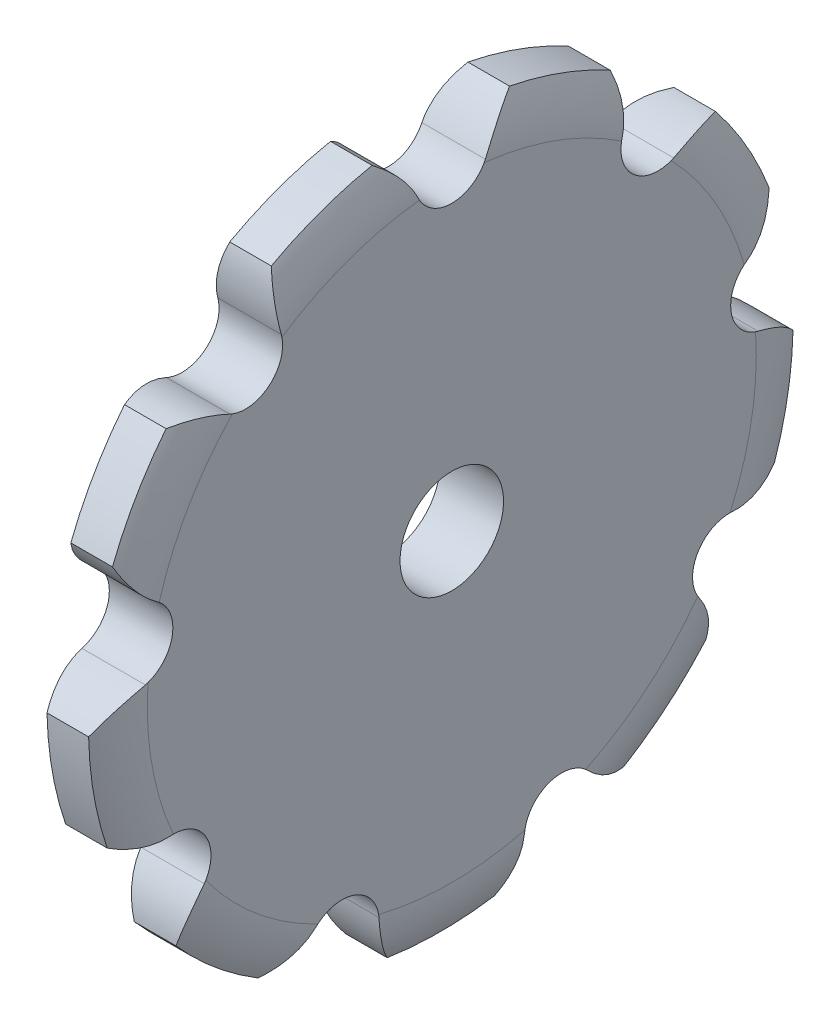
ISO-10303-21;
HEADER;
FILE_DESCRIPTION(('STEP AP214'),'2;1');
FILE_NAME('part.step','',(''),(''),'','','');
FILE_SCHEMA(('AUTOMOTIVE_DESIGN { 1 0 10303 214 1 1 1 1 }'));
ENDSEC;
DATA;
#1=APPLICATION_CONTEXT('core data for automotive mechanical design processes');
#2=APPLICATION_PROTOCOL_DEFINITION('international standard','automotive_design',2000,#1);
#3=PRODUCT_CONTEXT('',#1,'mechanical');
#4=PRODUCT('Part','Part','',(#3));
#5=PRODUCT_RELATED_PRODUCT_CATEGORY('part','',(#4));
#6=PRODUCT_DEFINITION_FORMATION('','',#4);
#7=PRODUCT_DEFINITION_CONTEXT('part definition',#1,'design');
#8=PRODUCT_DEFINITION('design','',#6,#7);
#9=PRODUCT_DEFINITION_SHAPE('','',#8);
#10=(LENGTH_UNIT() NAMED_UNIT(*) SI_UNIT(.MILLI.,.METRE.));
#11=(NAMED_UNIT(*) PLANE_ANGLE_UNIT() SI_UNIT($,.RADIAN.));
#12=(NAMED_UNIT(*) SI_UNIT($,.STERADIAN.) SOLID_ANGLE_UNIT());
#13=UNCERTAINTY_MEASURE_WITH_UNIT(LENGTH_MEASURE(1.E-05),#10,'distance_accuracy_value','');
#14=(GEOMETRIC_REPRESENTATION_CONTEXT(3) GLOBAL_UNCERTAINTY_ASSIGNED_CONTEXT((#13)) GLOBAL_UNIT_ASSIGNED_CONTEXT((#10,
#11,#12)) REPRESENTATION_CONTEXT('',''));
#15=CARTESIAN_POINT('',(0.,0.,0.));
#16=DIRECTION('',(0.,0.,1.));
#17=DIRECTION('',(1.,0.,0.));
#18=AXIS2_PLACEMENT_3D('',#15,#16,#17);
#19=CARTESIAN_POINT('',(-5.3375,0.,0.));
#20=DIRECTION('',(-1.,0.,0.));
#21=DIRECTION('',(0.,0.,1.));
#22=AXIS2_PLACEMENT_3D('',#19,#20,#21);
#23=TOROIDAL_SURFACE('',#22,35.279014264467,12.7);
#24=CARTESIAN_POINT('',(6.09230000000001,-0.884912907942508,40.8056348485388));
#25=CARTESIAN_POINT('',(6.18589716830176,-0.682367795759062,40.6167560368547));
#26=CARTESIAN_POINT('',(6.27664469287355,-0.486054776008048,40.4196640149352));
#27=CARTESIAN_POINT('',(6.45085706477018,-0.10700792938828,40.0095214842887));
#28=CARTESIAN_POINT('',(6.53431607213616,0.0757149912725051,39.7964584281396));
#29=CARTESIAN_POINT('',(6.69014848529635,0.421556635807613,39.3609170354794));
#30=CARTESIAN_POINT('',(6.7627548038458,0.585063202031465,39.1388308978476));
#31=CARTESIAN_POINT('',(6.89780931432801,0.896528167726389,38.6811049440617));
#32=CARTESIAN_POINT('',(6.96025956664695,1.0444897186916,38.4454678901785));
#33=CARTESIAN_POINT('',(7.06524981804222,1.30349966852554,37.9964834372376));
#34=CARTESIAN_POINT('',(7.1093613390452,1.41679713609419,37.7847987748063));
#35=CARTESIAN_POINT('',(7.1879168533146,1.63019844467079,37.353168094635));
#36=CARTESIAN_POINT('',(7.22236245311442,1.73030447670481,37.1332234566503));
#37=CARTESIAN_POINT('',(7.28123736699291,1.91864800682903,36.6810297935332));
#38=CARTESIAN_POINT('',(7.30542215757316,2.00656534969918,36.4486149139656));
#39=CARTESIAN_POINT('',(7.3416439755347,2.16710850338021,35.9774628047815));
#40=CARTESIAN_POINT('',(7.35367234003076,2.23972338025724,35.7387211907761));
#41=CARTESIAN_POINT('',(7.35911261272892,2.30428677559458,35.4976083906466));
#42=B_SPLINE_CURVE_WITH_KNOTS('',3,(#24,#25,#26,#27,#28,#29,#30,#31,#32,#33,#34,#35,#36,#37,#38,
#39,#40,#41),.UNSPECIFIED.,.F.,.F.,(4,2,2,2,2,2,2,2,4),(0.,0.87692971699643,1.75455575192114,
2.60921940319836,3.46370944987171,4.19541063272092,4.92699013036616,5.67513884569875,
6.42382032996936),.UNSPECIFIED.);
#43=CARTESIAN_POINT('',(6.09250000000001,-0.884480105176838,40.8052312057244));
#44=VERTEX_POINT('',#43);
#45=CARTESIAN_POINT('',(7.35910808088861,2.30423318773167,35.4978083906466));
#46=VERTEX_POINT('',#45);
#47=EDGE_CURVE('E705',#44,#46,#42,.T.);
#48=ORIENTED_EDGE('',*,*,#47,.F.);
#49=CARTESIAN_POINT('',(6.09250000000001,0.,0.));
#50=DIRECTION('',(-1.,0.,0.));
#51=DIRECTION('',(0.,0.,1.));
#52=AXIS2_PLACEMENT_3D('',#49,#50,#51);
#53=CIRCLE('',#52,40.8148159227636);
#54=CARTESIAN_POINT('',(6.09250000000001,-13.1250715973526,38.6468846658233));
#55=VERTEX_POINT('',#54);
#56=EDGE_CURVE('E978',#55,#44,#53,.T.);
#57=ORIENTED_EDGE('',*,*,#56,.F.);
#58=CARTESIAN_POINT('',(7.35911247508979,-14.3062189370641,32.5687344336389));
#59=CARTESIAN_POINT('',(7.35592420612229,-14.318927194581,32.7139395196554));
#60=CARTESIAN_POINT('',(7.35050117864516,-14.3287981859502,32.8593159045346));
#61=CARTESIAN_POINT('',(7.33536706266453,-14.3428773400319,33.1501033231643));
#62=CARTESIAN_POINT('',(7.32565648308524,-14.3470861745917,33.2955143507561));
#63=CARTESIAN_POINT('',(7.29039194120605,-14.3512371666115,33.7310390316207));
#64=CARTESIAN_POINT('',(7.2586966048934,-14.3427343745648,34.0207957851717));
#65=CARTESIAN_POINT('',(7.18156897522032,-14.3041387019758,34.5894511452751));
#66=CARTESIAN_POINT('',(7.13650340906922,-14.2745959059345,34.8684392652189));
#67=CARTESIAN_POINT('',(7.03398599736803,-14.1952082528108,35.4212206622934));
#68=CARTESIAN_POINT('',(6.9765329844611,-14.1453614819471,35.6950134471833));
#69=CARTESIAN_POINT('',(6.85946501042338,-14.0343488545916,36.1987891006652));
#70=CARTESIAN_POINT('',(6.80121932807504,-13.9756619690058,36.4296442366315));
#71=CARTESIAN_POINT('',(6.67774792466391,-13.8443682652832,36.8854054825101));
#72=CARTESIAN_POINT('',(6.61252253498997,-13.7717621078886,37.1103118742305));
#73=CARTESIAN_POINT('',(6.40482360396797,-13.5304018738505,37.7849522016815));
#74=CARTESIAN_POINT('',(6.25278873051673,-13.3404000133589,38.2242964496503));
#75=CARTESIAN_POINT('',(6.09230000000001,-13.1248029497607,38.6474119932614));
#76=B_SPLINE_CURVE_WITH_KNOTS('',3,(#58,#59,#60,#61,#62,#63,#64,#65,#66,#67,#68,#69,#70,#71,#72,
#73,#74,#75),.UNSPECIFIED.,.F.,.F.,(4,2,2,2,2,2,2,2,4),(0.,0.437288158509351,0.874524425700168,
1.74794262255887,2.59932629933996,3.4507902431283,4.18585323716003,4.92088134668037,
6.42320694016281),.UNSPECIFIED.);
#77=CARTESIAN_POINT('',(7.35910808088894,-14.3062364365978,32.5689344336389));
#78=VERTEX_POINT('',#77);
#79=EDGE_CURVE('E726',#78,#55,#76,.T.);
#80=ORIENTED_EDGE('',*,*,#79,.F.);
#81=CARTESIAN_POINT('',(7.3591027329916,-21.0526063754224,28.6741714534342));
#82=CARTESIAN_POINT('',(7.3617232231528,-20.9551607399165,28.6059133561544));
#83=CARTESIAN_POINT('',(7.36277821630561,-20.8548482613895,28.5417141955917));
#84=CARTESIAN_POINT('',(7.3621021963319,-20.6492817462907,28.421867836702));
#85=CARTESIAN_POINT('',(7.36037193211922,-20.5440290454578,28.3662183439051));
#86=CARTESIAN_POINT('',(7.35447721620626,-20.3295317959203,28.263968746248));
#87=CARTESIAN_POINT('',(7.35031755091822,-20.2202954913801,28.2173510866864));
#88=CARTESIAN_POINT('',(7.33999957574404,-19.9984530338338,28.1333383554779));
#89=CARTESIAN_POINT('',(7.333841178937,-19.8858467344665,28.095943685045));
#90=CARTESIAN_POINT('',(7.31306948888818,-19.544235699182,27.9980179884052));
#91=CARTESIAN_POINT('',(7.29614938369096,-19.3111478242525,27.9516070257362));
#92=CARTESIAN_POINT('',(7.26029166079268,-18.8407364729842,27.8977596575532));
#93=CARTESIAN_POINT('',(7.24135338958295,-18.6034116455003,27.8903359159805));
#94=CARTESIAN_POINT('',(7.20521953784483,-18.1255454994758,27.9148938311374));
#95=CARTESIAN_POINT('',(7.1880692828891,-17.885042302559,27.9477121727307));
#96=CARTESIAN_POINT('',(7.15976642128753,-17.4126579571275,28.0534348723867));
#97=CARTESIAN_POINT('',(7.1486129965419,-17.1807756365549,28.1263337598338));
#98=CARTESIAN_POINT('',(7.1348273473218,-16.7344059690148,28.3094228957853));
#99=CARTESIAN_POINT('',(7.13211866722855,-16.519779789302,28.4192685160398));
#100=CARTESIAN_POINT('',(7.13559913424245,-16.111949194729,28.6732115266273));
#101=CARTESIAN_POINT('',(7.14178774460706,-15.9187434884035,28.8173068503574));
#102=CARTESIAN_POINT('',(7.16155172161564,-15.5621133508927,29.1329702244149));
#103=CARTESIAN_POINT('',(7.17501067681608,-15.3982723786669,29.304076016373));
#104=CARTESIAN_POINT('',(7.20641257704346,-15.1010011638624,29.6706053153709));
#105=CARTESIAN_POINT('',(7.22435657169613,-14.9675780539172,29.8660345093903));
#106=CARTESIAN_POINT('',(7.26129477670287,-14.7323157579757,30.280015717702));
#107=CARTESIAN_POINT('',(7.28030256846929,-14.6311354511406,30.498941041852));
#108=CARTESIAN_POINT('',(7.31463202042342,-14.4667331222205,30.9507922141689));
#109=CARTESIAN_POINT('',(7.32995580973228,-14.4034891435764,31.1837098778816));
#110=CARTESIAN_POINT('',(7.35045381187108,-14.3255491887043,31.6093991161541));
#111=CARTESIAN_POINT('',(7.35705169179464,-14.3036345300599,31.8007935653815));
#112=CARTESIAN_POINT('',(7.36187968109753,-14.2901026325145,32.0887985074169));
#113=CARTESIAN_POINT('',(7.36264359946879,-14.2888182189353,32.1849853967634));
#114=CARTESIAN_POINT('',(7.36231138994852,-14.2926986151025,32.37725155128));
#115=CARTESIAN_POINT('',(7.36121475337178,-14.2978651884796,32.473330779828));
#116=CARTESIAN_POINT('',(7.35910368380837,-14.3062539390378,32.5691344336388));
#117=B_SPLINE_CURVE_WITH_KNOTS('',3,(#81,#82,#83,#84,#85,#86,#87,#88,#89,#90,#91,#92,#93,#94,
#95,#96,#97,#98,#99,#100,#101,#102,#103,#104,#105,#106,#107,#108,#109,#110,#111,#112,#113,#114,
#115,#116),.UNSPECIFIED.,.F.,.F.,(4,2,2,2,2,2,2,2,2,2,2,2,2,2,2,2,2,4),(0.,0.356872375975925,
0.713648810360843,1.06972468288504,1.42581604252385,2.13704381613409,2.84850259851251,
3.57500765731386,4.30141357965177,5.02122350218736,5.7409900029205,6.44955929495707,
7.15829456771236,7.88070091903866,8.60268875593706,9.17906737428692,9.46745387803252,
9.75591924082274),.UNSPECIFIED.);
#118=CARTESIAN_POINT('',(7.3625,-14.2903129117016,32.2551670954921));
#119=VERTEX_POINT('',#118);
#120=EDGE_CURVE('E1105',#119,#78,#117,.T.);
#121=ORIENTED_EDGE('',*,*,#120,.F.);
#122=CARTESIAN_POINT('',(7.3625,0.,0.));
#123=DIRECTION('',(-1.,0.,0.));
#124=DIRECTION('',(0.,0.,1.));
#125=AXIS2_PLACEMENT_3D('',#122,#123,#124);
#126=CIRCLE('',#125,35.279014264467);
#127=CARTESIAN_POINT('',(7.3625,2.39658471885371,35.1975173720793));
#128=VERTEX_POINT('',#127);
#129=EDGE_CURVE('E965',#119,#128,#126,.T.);
#130=ORIENTED_EDGE('',*,*,#129,.T.);
#131=CARTESIAN_POINT('',(7.35910354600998,2.30417960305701,35.4980083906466));
#132=CARTESIAN_POINT('',(7.36172371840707,2.33495285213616,35.3830829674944));
#133=CARTESIAN_POINT('',(7.36277840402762,2.37053126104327,35.2694241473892));
#134=CARTESIAN_POINT('',(7.36210179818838,2.45097061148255,35.0454814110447));
#135=CARTESIAN_POINT('',(7.3603712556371,2.49582905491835,34.9351965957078));
#136=CARTESIAN_POINT('',(7.35447602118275,2.59442068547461,34.7189933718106));
#137=CARTESIAN_POINT('',(7.35031611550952,2.64813627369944,34.6130668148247));
#138=CARTESIAN_POINT('',(7.33999770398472,2.76407703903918,34.4061126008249));
#139=CARTESIAN_POINT('',(7.33383911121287,2.82630258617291,34.3050851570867));
#140=CARTESIAN_POINT('',(7.31306690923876,3.02504918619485,34.0104879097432));
#141=CARTESIAN_POINT('',(7.29614656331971,3.173774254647,33.825110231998));
#142=CARTESIAN_POINT('',(7.26028858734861,3.49952122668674,33.4814888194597));
#143=CARTESIAN_POINT('',(7.2413503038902,3.67655230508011,33.3232539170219));
#144=CARTESIAN_POINT('',(7.20521666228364,4.05840744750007,33.034903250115));
#145=CARTESIAN_POINT('',(7.18806663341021,4.26374010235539,32.9054529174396));
#146=CARTESIAN_POINT('',(7.15976440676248,4.69356701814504,32.682802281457));
#147=CARTESIAN_POINT('',(7.14861139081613,4.91805866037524,32.5895970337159));
#148=CARTESIAN_POINT('',(7.13482665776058,5.37768641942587,32.4429348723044));
#149=CARTESIAN_POINT('',(7.13211847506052,5.61270735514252,32.3891246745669));
#150=CARTESIAN_POINT('',(7.13559990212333,6.08835542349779,32.3215122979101));
#151=CARTESIAN_POINT('',(7.14178897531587,6.32898221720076,32.3077077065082));
#152=CARTESIAN_POINT('',(7.16155374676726,6.80508097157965,32.3202867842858));
#153=CARTESIAN_POINT('',(7.17501304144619,7.04057489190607,32.3460486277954));
#154=CARTESIAN_POINT('',(7.20641543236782,7.50389753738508,32.435748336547));
#155=CARTESIAN_POINT('',(7.22435957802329,7.7317244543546,32.4996951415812));
#156=CARTESIAN_POINT('',(7.26129786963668,8.17804644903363,32.6656035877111));
#157=CARTESIAN_POINT('',(7.28030559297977,8.39627674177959,32.768274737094));
#158=CARTESIAN_POINT('',(7.31463466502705,8.81265863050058,33.0087410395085));
#159=CARTESIAN_POINT('',(7.32995814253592,9.01082178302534,33.1465158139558));
#160=CARTESIAN_POINT('',(7.35045621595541,9.34416636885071,33.4225285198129));
#161=CARTESIAN_POINT('',(7.3570540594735,9.48399098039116,33.5550732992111));
#162=CARTESIAN_POINT('',(7.36188085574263,9.67949663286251,33.7670237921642));
#163=CARTESIAN_POINT('',(7.36264418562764,9.74231236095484,33.8398900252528));
#164=CARTESIAN_POINT('',(7.36231038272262,9.8629331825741,33.9896861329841));
#165=CARTESIAN_POINT('',(7.36121274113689,9.92073690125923,34.0666171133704));
#166=CARTESIAN_POINT('',(7.35910044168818,9.97589459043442,34.1454084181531));
#167=B_SPLINE_CURVE_WITH_KNOTS('',3,(#131,#132,#133,#134,#135,#136,#137,#138,#139,#140,#141,
#142,#143,#144,#145,#146,#147,#148,#149,#150,#151,#152,#153,#154,#155,#156,#157,#158,#159,#160,
#161,#162,#163,#164,#165,#166),.UNSPECIFIED.,.F.,.F.,(4,2,2,2,2,2,2,2,2,2,2,2,2,2,2,2,2,4),(0.,
0.356872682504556,0.713649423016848,1.06972561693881,1.42581729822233,2.13704571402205,
2.84850512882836,3.57501047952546,4.30141668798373,5.02122610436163,5.74099211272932,
6.4495614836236,7.1582968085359,7.88070357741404,8.60269192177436,9.17912406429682,
9.46753756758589,9.75602993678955),.UNSPECIFIED.);
#168=EDGE_CURVE('E1092',#46,#128,#167,.T.);
#169=ORIENTED_EDGE('',*,*,#168,.F.);
#170=EDGE_LOOP('',(#48,#57,#80,#121,#130,#169));
#171=FACE_BOUND('',#170,.T.);
#172=ADVANCED_FACE('F39',(#171),#23,.T.);
#173=CARTESIAN_POINT('',(7.3625,9.78620696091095,33.8945275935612));
#174=VERTEX_POINT('',#173);
#175=CARTESIAN_POINT('',(7.35910808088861,9.97569459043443,34.1451227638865));
#176=VERTEX_POINT('',#175);
#177=EDGE_CURVE('E1093',#174,#176,#167,.T.);
#178=ORIENTED_EDGE('',*,*,#177,.F.);
#179=CARTESIAN_POINT('',(7.3625,24.4604184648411,25.4223676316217));
#180=VERTEX_POINT('',#179);
#181=EDGE_CURVE('E960',#174,#180,#126,.T.);
#182=ORIENTED_EDGE('',*,*,#181,.T.);
#183=CARTESIAN_POINT('',(7.35910324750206,24.58278970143,25.7119663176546));
#184=CARTESIAN_POINT('',(7.3617235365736,24.5324904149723,25.6041478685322));
#185=CARTESIAN_POINT('',(7.36277833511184,24.486686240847,25.4942109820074));
#186=CARTESIAN_POINT('',(7.36210194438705,24.4043580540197,25.2709558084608));
#187=CARTESIAN_POINT('',(7.36037150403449,24.3678315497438,25.1576384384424));
#188=CARTESIAN_POINT('',(7.35447645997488,24.3043836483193,24.9286439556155));
#189=CARTESIAN_POINT('',(7.35031664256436,24.2774435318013,24.8129719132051));
#190=CARTESIAN_POINT('',(7.33999839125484,24.2332309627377,24.5799107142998));
#191=CARTESIAN_POINT('',(7.33383987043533,24.2159589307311,24.4625214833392));
#192=CARTESIAN_POINT('',(7.31306785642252,24.1788430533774,24.1090952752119));
#193=CARTESIAN_POINT('',(7.29614759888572,24.1736138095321,23.8714891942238));
#194=CARTESIAN_POINT('',(7.26028971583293,24.2022733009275,23.3988738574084));
#195=CARTESIAN_POINT('',(7.24135143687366,24.236174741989,23.1638654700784));
#196=CARTESIAN_POINT('',(7.20521771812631,24.3433429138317,22.6975240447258));
#197=CARTESIAN_POINT('',(7.18806760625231,24.4174269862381,22.4663738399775));
#198=CARTESIAN_POINT('',(7.15976514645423,24.6035748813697,22.019525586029));
#199=CARTESIAN_POINT('',(7.14861198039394,24.7156335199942,21.8038254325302));
#200=CARTESIAN_POINT('',(7.13482691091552,24.9734547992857,21.3960317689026));
#201=CARTESIAN_POINT('',(7.13211854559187,25.1189021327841,21.2037416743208));
#202=CARTESIAN_POINT('',(7.13559962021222,25.4398081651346,20.8462057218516));
#203=CARTESIAN_POINT('',(7.14178852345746,25.6152650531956,20.6809582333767));
#204=CARTESIAN_POINT('',(7.1615530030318,25.9880625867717,20.384562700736));
#205=CARTESIAN_POINT('',(7.17501217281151,26.1850203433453,20.2529241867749));
#206=CARTESIAN_POINT('',(7.20641438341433,26.5976031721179,20.0238187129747));
#207=CARTESIAN_POINT('',(7.22435847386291,26.8132326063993,19.9263597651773));
#208=CARTESIAN_POINT('',(7.26129673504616,27.261778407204,19.7665612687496));
#209=CARTESIAN_POINT('',(7.28030448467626,27.4949479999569,19.7049354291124));
#210=CARTESIAN_POINT('',(7.31463369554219,27.9684834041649,19.6214966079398));
#211=CARTESIAN_POINT('',(7.32995728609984,28.2088449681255,19.5996605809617));
#212=CARTESIAN_POINT('',(7.35045464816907,28.6415981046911,19.5968274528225));
#213=CARTESIAN_POINT('',(7.35705219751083,28.8338870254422,19.6084817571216));
#214=CARTESIAN_POINT('',(7.36187982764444,29.1198614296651,19.6451674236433));
#215=CARTESIAN_POINT('',(7.36264364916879,29.2148084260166,19.6606052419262));
#216=CARTESIAN_POINT('',(7.36231130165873,29.4034765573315,19.6978132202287));
#217=CARTESIAN_POINT('',(7.3612146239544,29.4971973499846,19.7195851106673));
#218=CARTESIAN_POINT('',(7.35910354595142,29.5900872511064,19.7444822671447));
#219=B_SPLINE_CURVE_WITH_KNOTS('',3,(#183,#184,#185,#186,#187,#188,#189,#190,#191,#192,#193,
#194,#195,#196,#197,#198,#199,#200,#201,#202,#203,#204,#205,#206,#207,#208,#209,#210,#211,#212,
#213,#214,#215,#216,#217,#218),.UNSPECIFIED.,.F.,.F.,(4,2,2,2,2,2,2,2,2,2,2,2,2,2,2,2,2,4),(0.,
0.35687256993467,0.713649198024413,1.06972527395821,1.42581683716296,2.13704501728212,
2.84850419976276,3.57500944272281,4.30141554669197,5.02122515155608,5.74099133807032,
6.44956066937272,7.15829598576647,7.8807026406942,8.60269075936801,9.17905982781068,
9.46744152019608,9.7559020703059),.UNSPECIFIED.);
#220=CARTESIAN_POINT('',(7.35910808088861,24.5826964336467,25.7117663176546));
#221=VERTEX_POINT('',#220);
#222=EDGE_CURVE('E1341',#221,#180,#219,.T.);
#223=ORIENTED_EDGE('',*,*,#222,.F.);
#224=CARTESIAN_POINT('',(6.09230000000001,25.5514738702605,31.8277408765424));
#225=CARTESIAN_POINT('',(6.18589714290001,25.5852234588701,31.5528578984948));
#226=CARTESIAN_POINT('',(6.27664464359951,25.6089196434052,31.2756891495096));
#227=CARTESIAN_POINT('',(6.4508569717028,25.6356518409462,30.7178552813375));
#228=CARTESIAN_POINT('',(6.5343159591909,25.6386714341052,30.4371875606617));
#229=CARTESIAN_POINT('',(6.69014833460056,25.6236409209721,29.881240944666));
#230=CARTESIAN_POINT('',(6.76275463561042,25.6061400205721,29.6060131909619));
#231=CARTESIAN_POINT('',(6.89780911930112,25.5505155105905,29.0551691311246));
#232=CARTESIAN_POINT('',(6.96025936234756,25.5123960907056,28.7795529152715));
#233=CARTESIAN_POINT('',(7.06524985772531,25.4222074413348,28.2691214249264));
#234=CARTESIAN_POINT('',(7.10936158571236,25.3729298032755,28.0341342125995));
#235=CARTESIAN_POINT('',(7.18791741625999,25.2589571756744,27.5663119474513));
#236=CARTESIAN_POINT('',(7.22236312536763,25.1942647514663,27.3334765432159));
#237=CARTESIAN_POINT('',(7.28123815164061,25.0478787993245,26.8660089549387));
#238=CARTESIAN_POINT('',(7.30542294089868,24.9658334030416,26.6314555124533));
#239=CARTESIAN_POINT('',(7.34164462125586,24.7859645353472,26.1673347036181));
#240=CARTESIAN_POINT('',(7.35367284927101,24.6881298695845,25.9377710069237));
#241=CARTESIAN_POINT('',(7.35911291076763,24.5826031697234,25.7115663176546));
#242=B_SPLINE_CURVE_WITH_KNOTS('',3,(#224,#225,#226,#227,#228,#229,#230,#231,#232,#233,#234,
#235,#236,#237,#238,#239,#240,#241),.UNSPECIFIED.,.F.,.F.,(4,2,2,2,2,2,2,2,4),(0.,
0.876929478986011,1.75455527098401,2.60921863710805,3.46370840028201,4.19541314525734,
4.9269962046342,5.67514868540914,6.42383394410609),.UNSPECIFIED.);
#243=CARTESIAN_POINT('',(6.09250000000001,25.5515459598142,31.8271534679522));
#244=VERTEX_POINT('',#243);
#245=EDGE_CURVE('E903',#244,#221,#242,.T.);
#246=ORIENTED_EDGE('',*,*,#245,.F.);
#247=CARTESIAN_POINT('',(6.09250000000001,14.7873504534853,38.0418646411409));
#248=VERTEX_POINT('',#247);
#249=EDGE_CURVE('E971',#248,#244,#53,.T.);
#250=ORIENTED_EDGE('',*,*,#249,.F.);
#251=CARTESIAN_POINT('',(7.35911342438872,9.9755545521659,34.1449227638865));
#252=CARTESIAN_POINT('',(7.3559256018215,10.0591549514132,34.2643252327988));
#253=CARTESIAN_POINT('',(7.35050301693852,10.1450389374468,34.3820351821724));
#254=CARTESIAN_POINT('',(7.33536977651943,10.3211671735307,34.6138416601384));
#255=CARTESIAN_POINT('',(7.32565962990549,10.4114109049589,34.7279386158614));
#256=CARTESIAN_POINT('',(7.2903963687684,10.6881793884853,35.0642389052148));
#257=CARTESIAN_POINT('',(7.25870186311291,10.8809439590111,35.2807405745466));
#258=CARTESIAN_POINT('',(7.1815758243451,11.2760326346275,35.6915482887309));
#259=CARTESIAN_POINT('',(7.13651102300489,11.4779928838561,35.8862764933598));
#260=CARTESIAN_POINT('',(7.0339950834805,11.8941265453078,36.258703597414));
#261=CARTESIAN_POINT('',(6.97654277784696,12.1083011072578,36.4364008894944));
#262=CARTESIAN_POINT('',(6.85947514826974,12.5171640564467,36.7509617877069));
#263=CARTESIAN_POINT('',(6.80122897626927,12.7105142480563,36.8900868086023));
#264=CARTESIAN_POINT('',(6.67775632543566,13.1040542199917,37.1548316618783));
#265=CARTESIAN_POINT('',(6.61253017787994,13.3042436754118,37.2804521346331));
#266=CARTESIAN_POINT('',(6.40482852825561,13.9227960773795,37.6421204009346));
#267=CARTESIAN_POINT('',(6.25279132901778,14.3507577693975,37.8565507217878));
#268=CARTESIAN_POINT('',(6.09230000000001,14.7878952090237,38.0420959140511));
#269=B_SPLINE_CURVE_WITH_KNOTS('',3,(#251,#252,#253,#254,#255,#256,#257,#258,#259,#260,#261,
#262,#263,#264,#265,#266,#267,#268),.UNSPECIFIED.,.F.,.F.,(4,2,2,2,2,2,2,2,4),(0.,
0.437287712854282,0.874523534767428,1.74794083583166,2.59932345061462,3.45078633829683,
4.18586080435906,4.92090039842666,6.42325027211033),.UNSPECIFIED.);
#270=EDGE_CURVE('E694',#176,#248,#269,.T.);
#271=ORIENTED_EDGE('',*,*,#270,.F.);
#272=EDGE_LOOP('',(#178,#182,#223,#246,#250,#271));
#273=FACE_BOUND('',#272,.T.);
#274=ADVANCED_FACE('F1234',(#273),#23,.T.);
#275=CARTESIAN_POINT('',(6.0923,-26.9072391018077,30.6901187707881));
#276=CARTESIAN_POINT('',(6.18589709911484,-26.6306717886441,30.675622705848));
#277=CARTESIAN_POINT('',(6.27664455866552,-26.3535991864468,30.6508290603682));
#278=CARTESIAN_POINT('',(6.45085681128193,-25.7995983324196,30.5802883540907));
#279=CARTESIAN_POINT('',(6.53431576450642,-25.5226703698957,30.534524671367));
#280=CARTESIAN_POINT('',(6.69014807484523,-24.9777801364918,30.4231834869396));
#281=CARTESIAN_POINT('',(6.76275434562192,-24.70977286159,30.3581557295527));
#282=CARTESIAN_POINT('',(6.89780878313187,-24.1769567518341,30.2077233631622));
#283=CARTESIAN_POINT('',(6.96025901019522,-23.9121472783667,30.1223228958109));
#284=CARTESIAN_POINT('',(7.0652499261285,-23.4251297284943,29.9448683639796));
#285=CARTESIAN_POINT('',(7.10936201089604,-23.2022676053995,29.8555334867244));
#286=CARTESIAN_POINT('',(7.18791838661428,-22.7613401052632,29.6620540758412));
#287=CARTESIAN_POINT('',(7.22236428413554,-22.5432739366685,29.5579120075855));
#288=CARTESIAN_POINT('',(7.28123950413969,-22.1083243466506,29.3325727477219));
#289=CARTESIAN_POINT('',(7.30542429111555,-21.8915795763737,29.2110426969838));
#290=CARTESIAN_POINT('',(7.34164573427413,-21.4657403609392,28.9533098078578));
#291=CARTESIAN_POINT('',(7.35367372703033,-21.2566514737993,28.8170965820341));
#292=CARTESIAN_POINT('',(7.35911342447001,-21.0522063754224,28.6738913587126));
#293=B_SPLINE_CURVE_WITH_KNOTS('',3,(#275,#276,#277,#278,#279,#280,#281,#282,#283,#284,#285,
#286,#287,#288,#289,#290,#291,#292),.UNSPECIFIED.,.F.,.F.,(4,2,2,2,2,2,2,2,4),(0.,
0.876929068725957,1.75455444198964,2.60921731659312,3.46370659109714,4.19541747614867,
4.9270066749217,5.67516564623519,6.42385741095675),.UNSPECIFIED.);
#294=CARTESIAN_POINT('',(6.09250000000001,-26.9066480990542,30.6900877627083));
#295=VERTEX_POINT('',#294);
#296=CARTESIAN_POINT('',(7.3591080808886,-21.0524063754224,28.6740314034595));
#297=VERTEX_POINT('',#296);
#298=EDGE_CURVE('E736',#295,#297,#293,.T.);
#299=ORIENTED_EDGE('',*,*,#298,.F.);
#300=CARTESIAN_POINT('',(6.09250000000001,-34.8961267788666,21.1685978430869));
#301=VERTEX_POINT('',#300);
#302=EDGE_CURVE('E1179',#301,#295,#53,.T.);
#303=ORIENTED_EDGE('',*,*,#302,.F.);
#304=CARTESIAN_POINT('',(7.35911427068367,-31.8939204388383,15.7531797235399));
#305=CARTESIAN_POINT('',(7.35592684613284,-31.9969921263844,15.8562436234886));
#306=CARTESIAN_POINT('',(7.35050465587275,-32.0980004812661,15.9612625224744));
#307=CARTESIAN_POINT('',(7.33537219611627,-32.295701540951,16.1749668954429));
#308=CARTESIAN_POINT('',(7.32566243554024,-32.3923947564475,16.2836519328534));
#309=CARTESIAN_POINT('',(7.29040031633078,-32.6755265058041,16.6146123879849));
#310=CARTESIAN_POINT('',(7.25870655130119,-32.855266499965,16.8420427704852));
#311=CARTESIAN_POINT('',(7.18158193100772,-33.1912280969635,17.3024636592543));
#312=CARTESIAN_POINT('',(7.13651781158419,-33.3479286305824,17.5351691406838));
#313=CARTESIAN_POINT('',(7.03400318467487,-33.6424383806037,18.009650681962));
#314=CARTESIAN_POINT('',(6.97655150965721,-33.7802458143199,18.2514275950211));
#315=CARTESIAN_POINT('',(6.8594841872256,-34.0190326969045,18.7087039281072));
#316=CARTESIAN_POINT('',(6.80123757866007,-34.1224713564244,18.9232782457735));
#317=CARTESIAN_POINT('',(6.67776381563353,-34.314860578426,19.356817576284));
#318=CARTESIAN_POINT('',(6.61253699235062,-34.4038118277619,19.5757823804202));
#319=CARTESIAN_POINT('',(6.40483291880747,-34.6525798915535,20.2477498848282));
#320=CARTESIAN_POINT('',(6.25279364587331,-34.7894401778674,20.7064518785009));
#321=CARTESIAN_POINT('',(6.09230000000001,-34.8962599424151,21.1691744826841));
#322=B_SPLINE_CURVE_WITH_KNOTS('',3,(#304,#305,#306,#307,#308,#309,#310,#311,#312,#313,#314,
#315,#316,#317,#318,#319,#320,#321),.UNSPECIFIED.,.F.,.F.,(4,2,2,2,2,2,2,2,4),(0.,
0.437287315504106,0.874522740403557,1.74793924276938,2.59932091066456,3.45078285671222,
4.18586755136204,4.92091738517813,6.4232889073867),.UNSPECIFIED.);
#323=CARTESIAN_POINT('',(7.35910808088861,-31.8941204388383,15.7533797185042));
#324=VERTEX_POINT('',#323);
#325=EDGE_CURVE('E754',#324,#301,#322,.T.);
#326=ORIENTED_EDGE('',*,*,#325,.F.);
#327=CARTESIAN_POINT('',(7.35910368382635,-34.5585910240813,8.43333895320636));
#328=CARTESIAN_POINT('',(7.36172380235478,-34.4400678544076,8.44368827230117));
#329=CARTESIAN_POINT('',(7.36277843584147,-34.321957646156,8.45898969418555));
#330=CARTESIAN_POINT('',(7.36210173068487,-34.0874489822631,8.49932009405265));
#331=CARTESIAN_POINT('',(7.36037114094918,-33.9710500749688,8.52434645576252));
#332=CARTESIAN_POINT('',(7.35447581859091,-33.7410112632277,8.58389731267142));
#333=CARTESIAN_POINT('',(7.35031587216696,-33.6273663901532,8.61840306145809));
#334=CARTESIAN_POINT('',(7.33999738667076,-33.4034234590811,8.69664555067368));
#335=CARTESIAN_POINT('',(7.33383876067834,-33.293125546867,8.74038269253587));
#336=CARTESIAN_POINT('',(7.31306647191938,-32.9684920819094,8.88495412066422));
#337=CARTESIAN_POINT('',(7.29614608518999,-32.7601050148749,8.99922955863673));
#338=CARTESIAN_POINT('',(7.26028806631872,-32.3651389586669,9.26035911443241));
#339=CARTESIAN_POINT('',(7.2413497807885,-32.178567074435,9.40722380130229));
#340=CARTESIAN_POINT('',(7.20521617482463,-31.8282891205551,9.73320672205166));
#341=CARTESIAN_POINT('',(7.18806618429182,-31.6651500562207,9.91294136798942));
#342=CARTESIAN_POINT('',(7.15976406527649,-31.3712439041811,10.2975758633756));
#343=CARTESIAN_POINT('',(7.14861111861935,-31.2404724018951,10.5024722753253));
#344=CARTESIAN_POINT('',(7.13482654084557,-31.0162255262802,10.9296499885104));
#345=CARTESIAN_POINT('',(7.13211844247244,-30.922422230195,11.1517565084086));
#346=CARTESIAN_POINT('',(7.13560003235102,-30.7732423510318,11.6084378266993));
#347=CARTESIAN_POINT('',(7.14178918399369,-30.7178634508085,11.8430118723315));
#348=CARTESIAN_POINT('',(7.16155408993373,-30.6475784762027,12.3140620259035));
#349=CARTESIAN_POINT('',(7.17501344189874,-30.6320562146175,12.5504517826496));
#350=CARTESIAN_POINT('',(7.2064159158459,-30.6399387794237,13.0223116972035));
#351=CARTESIAN_POINT('',(7.22436008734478,-30.6633527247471,13.2577816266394));
#352=CARTESIAN_POINT('',(7.26129839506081,-30.749238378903,13.7261325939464));
#353=CARTESIAN_POINT('',(7.28030610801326,-30.8124548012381,13.9588760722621));
#354=CARTESIAN_POINT('',(7.31463511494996,-30.9769646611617,14.4106885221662));
#355=CARTESIAN_POINT('',(7.32995853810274,-31.0782360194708,14.6297653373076));
#356=CARTESIAN_POINT('',(7.35045591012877,-31.2921654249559,15.0059639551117));
#357=CARTESIAN_POINT('',(7.3570534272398,-31.3984091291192,15.1666706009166));
#358=CARTESIAN_POINT('',(7.36188043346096,-31.5731778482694,15.3959976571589));
#359=CARTESIAN_POINT('',(7.36264395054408,-31.6340247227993,15.4705079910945));
#360=CARTESIAN_POINT('',(7.36231078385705,-31.7605899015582,15.6153003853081));
#361=CARTESIAN_POINT('',(7.36121359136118,-31.8263095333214,15.6855812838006));
#362=CARTESIAN_POINT('',(7.3591018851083,-31.8943204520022,15.7535797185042));
#363=B_SPLINE_CURVE_WITH_KNOTS('',3,(#327,#328,#329,#330,#331,#332,#333,#334,#335,#336,#337,
#338,#339,#340,#341,#342,#343,#344,#345,#346,#347,#348,#349,#350,#351,#352,#353,#354,#355,#356,
#357,#358,#359,#360,#361,#362),.UNSPECIFIED.,.F.,.F.,(4,2,2,2,2,2,2,2,2,2,2,2,2,2,2,2,2,4),(0.,
0.356872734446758,0.713649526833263,1.06972577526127,1.42581751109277,2.13704603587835,
2.84850555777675,3.57501095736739,4.30141721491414,5.0212265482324,5.74099247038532,
6.44956184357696,7.15829718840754,7.8807040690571,8.60269245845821,9.17908846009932,
9.46748373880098,9.75595787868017),.UNSPECIFIED.);
#364=CARTESIAN_POINT('',(7.3625,-31.6802365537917,15.5232554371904));
#365=VERTEX_POINT('',#364);
#366=EDGE_CURVE('E1118',#365,#324,#363,.T.);
#367=ORIENTED_EDGE('',*,*,#366,.F.);
#368=CARTESIAN_POINT('',(7.3625,-20.7886376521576,28.5033575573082));
#369=VERTEX_POINT('',#368);
#370=EDGE_CURVE('E1281',#365,#369,#126,.T.);
#371=ORIENTED_EDGE('',*,*,#370,.T.);
#372=EDGE_CURVE('E1102',#297,#369,#117,.T.);
#373=ORIENTED_EDGE('',*,*,#372,.F.);
#374=EDGE_LOOP('',(#299,#303,#326,#367,#371,#373));
#375=FACE_BOUND('',#374,.T.);
#376=ADVANCED_FACE('F1239',(#375),#23,.T.);
#377=CARTESIAN_POINT('',(6.09230000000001,-40.3393690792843,6.21435503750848));
#378=CARTESIAN_POINT('',(6.18589718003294,-40.1181881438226,6.38102459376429));
#379=CARTESIAN_POINT('',(6.27664471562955,-39.8900009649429,6.54013052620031));
#380=CARTESIAN_POINT('',(6.45085710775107,-39.4202685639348,6.84219833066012));
#381=CARTESIAN_POINT('',(6.53431612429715,-39.1787128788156,6.98514728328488));
#382=CARTESIAN_POINT('',(6.69014855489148,-38.6897334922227,7.2501038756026));
#383=CARTESIAN_POINT('',(6.76275488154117,-38.4426286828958,7.37256156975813));
#384=CARTESIAN_POINT('',(6.89780940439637,-37.937771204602,7.59981142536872));
#385=CARTESIAN_POINT('',(6.96025966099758,-37.6800207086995,7.70460717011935));
#386=CARTESIAN_POINT('',(7.06524979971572,-37.1928811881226,7.8817166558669));
#387=CARTESIAN_POINT('',(7.10936122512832,-36.9647391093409,7.95653406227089));
#388=CARTESIAN_POINT('',(7.18791659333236,-36.5026101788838,8.09174118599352));
#389=CARTESIAN_POINT('',(7.22236214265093,-36.2686243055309,8.15213330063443));
#390=CARTESIAN_POINT('',(7.28123700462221,-35.7905960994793,8.25909273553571));
#391=CARTESIAN_POINT('',(7.30542179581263,-35.546446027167,8.30531596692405));
#392=CARTESIAN_POINT('',(7.34164367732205,-35.0545749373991,8.38160542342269));
#393=CARTESIAN_POINT('',(7.35367210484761,-34.8068515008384,8.4116601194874));
#394=CARTESIAN_POINT('',(7.35911247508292,-34.5581910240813,8.43337394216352));
#395=B_SPLINE_CURVE_WITH_KNOTS('',3,(#377,#378,#379,#380,#381,#382,#383,#384,#385,#386,#387,
#388,#389,#390,#391,#392,#393,#394),.UNSPECIFIED.,.F.,.F.,(4,2,2,2,2,2,2,2,4),(0.,
0.876929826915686,1.75455597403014,2.6092197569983,3.46370993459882,4.19540947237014,
4.92698732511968,5.67513430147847,6.42381404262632),.UNSPECIFIED.);
#396=CARTESIAN_POINT('',(6.09250000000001,-40.3388964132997,6.21471117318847));
#397=VERTEX_POINT('',#396);
#398=CARTESIAN_POINT('',(7.35910808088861,-34.5583910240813,8.43335644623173));
#399=VERTEX_POINT('',#398);
#400=EDGE_CURVE('E764',#397,#399,#395,.T.);
#401=ORIENTED_EDGE('',*,*,#400,.F.);
#402=CARTESIAN_POINT('',(6.09250000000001,-40.3388964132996,-6.21471117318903));
#403=VERTEX_POINT('',#402);
#404=EDGE_CURVE('E1181',#403,#397,#53,.T.);
#405=ORIENTED_EDGE('',*,*,#404,.F.);
#406=CARTESIAN_POINT('',(7.35911247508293,-34.5581910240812,-8.43337394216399));
#407=CARTESIAN_POINT('',(7.35592420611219,-34.7033968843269,-8.42067453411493));
#408=CARTESIAN_POINT('',(7.35050117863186,-34.8482787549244,-8.405151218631));
#409=CARTESIAN_POINT('',(7.33536706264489,-35.1370932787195,-8.36852177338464));
#410=CARTESIAN_POINT('',(7.32565648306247,-35.281026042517,-8.34741630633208));
#411=CARTESIAN_POINT('',(7.29039194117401,-35.7106549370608,-8.27587616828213));
#412=CARTESIAN_POINT('',(7.25869660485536,-35.9945331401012,-8.21718682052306));
#413=CARTESIAN_POINT('',(7.18156897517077,-36.5478472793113,-8.0804315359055));
#414=CARTESIAN_POINT('',(7.13650340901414,-36.8174668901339,-8.0028917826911));
#415=CARTESIAN_POINT('',(7.03398599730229,-37.3480647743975,-7.8287207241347));
#416=CARTESIAN_POINT('',(6.97653298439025,-37.6090422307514,-7.73208761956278));
#417=CARTESIAN_POINT('',(6.85946501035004,-38.0858872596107,-7.53528179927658));
#418=CARTESIAN_POINT('',(6.80121932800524,-38.3030443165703,-7.43739892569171));
#419=CARTESIAN_POINT('',(6.67774792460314,-38.7290826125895,-7.22895775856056));
#420=CARTESIAN_POINT('',(6.61252253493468,-38.9379642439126,-7.11840006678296));
#421=CARTESIAN_POINT('',(6.40482360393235,-39.5604435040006,-6.76355657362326));
#422=CARTESIAN_POINT('',(6.25278873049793,-39.9601196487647,-6.50014994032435));
#423=CARTESIAN_POINT('',(6.09230000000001,-40.3393690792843,-6.21435503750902));
#424=B_SPLINE_CURVE_WITH_KNOTS('',3,(#406,#407,#408,#409,#410,#411,#412,#413,#414,#415,#416,
#417,#418,#419,#420,#421,#422,#423),.UNSPECIFIED.,.F.,.F.,(4,2,2,2,2,2,2,2,4),(0.,
0.437288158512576,0.874524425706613,1.7479426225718,2.59932629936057,3.45079024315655,
4.18585323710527,4.92088134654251,6.4232069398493),.UNSPECIFIED.);
#425=CARTESIAN_POINT('',(7.35910808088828,-34.5583910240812,-8.4333564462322));
#426=VERTEX_POINT('',#425);
#427=EDGE_CURVE('E782',#426,#403,#424,.T.);
#428=ORIENTED_EDGE('',*,*,#427,.F.);
#429=CARTESIAN_POINT('',(7.3591018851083,-31.894320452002,-15.7535797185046));
#430=CARTESIAN_POINT('',(7.3617227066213,-31.8101774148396,-15.6694682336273));
#431=CARTESIAN_POINT('',(7.36277802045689,-31.7295337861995,-15.5818286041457));
#432=CARTESIAN_POINT('',(7.36210261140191,-31.5758103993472,-15.4001977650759));
#433=CARTESIAN_POINT('',(7.36037263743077,-31.502728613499,-15.306208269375));
#434=CARTESIAN_POINT('',(7.35447846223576,-31.3647837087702,-15.112726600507));
#435=CARTESIAN_POINT('',(7.35031904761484,-31.2999047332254,-15.013245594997));
#436=CARTESIAN_POINT('',(7.34000152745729,-31.1786440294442,-14.8093633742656));
#437=CARTESIAN_POINT('',(7.33384333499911,-31.1222626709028,-14.7049619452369));
#438=CARTESIAN_POINT('',(7.31307217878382,-30.9665017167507,-14.385547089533));
#439=CARTESIAN_POINT('',(7.29615232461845,-30.8803185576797,-14.1640605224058));
#440=CARTESIAN_POINT('',(7.26029486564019,-30.7455990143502,-13.7101479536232));
#441=CARTESIAN_POINT('',(7.24135660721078,-30.697074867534,-13.4777184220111));
#442=CARTESIAN_POINT('',(7.20522253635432,-30.6382745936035,-13.0028486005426));
#443=CARTESIAN_POINT('',(7.18807204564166,-30.6288290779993,-12.7603005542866));
#444=CARTESIAN_POINT('',(7.15976852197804,-30.6509122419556,-12.276734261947));
#445=CARTESIAN_POINT('',(7.1486146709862,-30.6824353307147,-12.0357158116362));
#446=CARTESIAN_POINT('',(7.13482806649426,-30.7852270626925,-11.5643333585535));
#447=CARTESIAN_POINT('',(7.1321188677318,-30.8561322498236,-11.3338924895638));
#448=CARTESIAN_POINT('',(7.13559833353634,-31.0353940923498,-10.888158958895));
#449=CARTESIAN_POINT('',(7.14178646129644,-31.1437484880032,-10.6728653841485));
#450=CARTESIAN_POINT('',(7.16154961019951,-31.392684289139,-10.2668363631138));
#451=CARTESIAN_POINT('',(7.17500821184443,-31.5327380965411,-10.075770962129));
#452=CARTESIAN_POINT('',(7.2064096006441,-31.8420749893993,-9.7193658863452));
#453=CARTESIAN_POINT('',(7.22435343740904,-32.0113649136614,-9.55403224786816));
#454=CARTESIAN_POINT('',(7.26129154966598,-32.3782009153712,-9.25045365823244));
#455=CARTESIAN_POINT('',(7.28029941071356,-32.5762290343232,-9.1127927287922));
#456=CARTESIAN_POINT('',(7.3146292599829,-32.9926647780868,-8.87242106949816));
#457=CARTESIAN_POINT('',(7.32995337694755,-33.2110605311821,-8.76969014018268));
#458=CARTESIAN_POINT('',(7.3504525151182,-33.6167533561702,-8.6190077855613));
#459=CARTESIAN_POINT('',(7.35705097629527,-33.8014409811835,-8.56418740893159));
#460=CARTESIAN_POINT('',(7.36187951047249,-34.082730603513,-8.50084587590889));
#461=CARTESIAN_POINT('',(7.36264355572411,-34.1772365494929,-8.48287729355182));
#462=CARTESIAN_POINT('',(7.36231147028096,-34.3672624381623,-8.45331052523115));
#463=CARTESIAN_POINT('',(7.36121483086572,-34.4627826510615,-8.44171408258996));
#464=CARTESIAN_POINT('',(7.35910368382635,-34.5585910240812,-8.43333895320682));
#465=B_SPLINE_CURVE_WITH_KNOTS('',3,(#429,#430,#431,#432,#433,#434,#435,#436,#437,#438,#439,
#440,#441,#442,#443,#444,#445,#446,#447,#448,#449,#450,#451,#452,#453,#454,#455,#456,#457,#458,
#459,#460,#461,#462,#463,#464),.UNSPECIFIED.,.F.,.F.,(4,2,2,2,2,2,2,2,2,2,2,2,2,2,2,2,2,4),(0.,
0.356872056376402,0.713648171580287,1.06972370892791,1.42581473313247,2.13704183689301,
2.84849996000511,3.57500471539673,4.30141033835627,5.02122078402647,5.74098780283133,
6.44955703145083,7.15829223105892,7.88069807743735,8.60268545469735,9.17908496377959,
9.46748199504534,9.75595788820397),.UNSPECIFIED.);
#466=CARTESIAN_POINT('',(7.3625,-34.2466254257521,-8.47215996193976));
#467=VERTEX_POINT('',#466);
#468=EDGE_CURVE('E1136',#467,#426,#465,.T.);
#469=ORIENTED_EDGE('',*,*,#468,.F.);
#470=CARTESIAN_POINT('',(7.3625,-34.2466254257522,8.4721599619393));
#471=VERTEX_POINT('',#470);
#472=EDGE_CURVE('E1278',#467,#471,#126,.T.);
#473=ORIENTED_EDGE('',*,*,#472,.T.);
#474=EDGE_CURVE('E1115',#399,#471,#363,.T.);
#475=ORIENTED_EDGE('',*,*,#474,.F.);
#476=EDGE_LOOP('',(#401,#405,#428,#469,#473,#475));
#477=FACE_BOUND('',#476,.T.);
#478=ADVANCED_FACE('F1258',(#477),#23,.T.);
#479=CARTESIAN_POINT('',(6.09230000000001,-34.8962599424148,-21.1691744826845));
#480=CARTESIAN_POINT('',(6.18589702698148,-34.8339587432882,-20.8993262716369));
#481=CARTESIAN_POINT('',(6.27664441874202,-34.7614286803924,-20.6307686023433));
#482=CARTESIAN_POINT('',(6.45085654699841,-34.5957585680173,-20.0974339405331));
#483=CARTESIAN_POINT('',(6.53431544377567,-34.5026021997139,-19.8326601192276));
#484=CARTESIAN_POINT('',(6.69014764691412,-34.2983335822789,-19.3153826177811));
#485=CARTESIAN_POINT('',(6.76275386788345,-34.1877549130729,-19.0627391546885));
#486=CARTESIAN_POINT('',(6.89780822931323,-33.9470857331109,-18.5641404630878));
#487=CARTESIAN_POINT('',(6.9602584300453,-33.8169991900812,-18.3181838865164));
#488=CARTESIAN_POINT('',(7.06525003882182,-33.5576694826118,-17.8693771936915));
#489=CARTESIAN_POINT('',(7.10936271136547,-33.4309904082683,-17.6654108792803));
#490=CARTESIAN_POINT('',(7.1879199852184,-33.1638801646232,-17.2647740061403));
#491=CARTESIAN_POINT('',(7.22236619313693,-33.0234512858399,-17.0681022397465));
#492=CARTESIAN_POINT('',(7.28124173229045,-32.7260024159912,-16.678885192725));
#493=CARTESIAN_POINT('',(7.30542651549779,-32.5686786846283,-16.4865342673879));
#494=CARTESIAN_POINT('',(7.34164756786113,-32.2409094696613,-16.1119147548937));
#495=CARTESIAN_POINT('',(7.35367517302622,-32.0704547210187,-15.929653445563));
#496=CARTESIAN_POINT('',(7.35911427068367,-31.8939204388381,-15.7531797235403));
#497=B_SPLINE_CURVE_WITH_KNOTS('',3,(#479,#480,#481,#482,#483,#484,#485,#486,#487,#488,#489,
#490,#491,#492,#493,#494,#495,#496),.UNSPECIFIED.,.F.,.F.,(4,2,2,2,2,2,2,2,4),(0.,
0.876928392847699,1.75455307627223,2.60921514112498,3.46370361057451,4.19542461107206,
4.92702392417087,5.67519358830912,6.42389607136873),.UNSPECIFIED.);
#498=CARTESIAN_POINT('',(6.09250000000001,-34.8961267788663,-21.1685978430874));
#499=VERTEX_POINT('',#498);
#500=CARTESIAN_POINT('',(7.3591080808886,-31.8941204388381,-15.7533797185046));
#501=VERTEX_POINT('',#500);
#502=EDGE_CURVE('E792',#499,#501,#497,.T.);
#503=ORIENTED_EDGE('',*,*,#502,.F.);
#504=CARTESIAN_POINT('',(6.09250000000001,-26.9066480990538,-30.6900877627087));
#505=VERTEX_POINT('',#504);
#506=EDGE_CURVE('E1187',#505,#499,#53,.T.);
#507=ORIENTED_EDGE('',*,*,#506,.F.);
#508=CARTESIAN_POINT('',(7.35911342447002,-21.052206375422,-28.6738913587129));
#509=CARTESIAN_POINT('',(7.35592560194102,-21.1716031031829,-28.7574999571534));
#510=CARTESIAN_POINT('',(7.35050301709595,-21.2925668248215,-28.8387370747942));
#511=CARTESIAN_POINT('',(7.33536977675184,-21.5373557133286,-28.9963245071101));
#512=CARTESIAN_POINT('',(7.32565963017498,-21.6611805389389,-29.072675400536));
#513=CARTESIAN_POINT('',(7.29039636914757,-22.03627931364,-29.294033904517));
#514=CARTESIAN_POINT('',(7.25870186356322,-22.2914666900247,-29.4315495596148));
#515=CARTESIAN_POINT('',(7.18157582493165,-22.8032331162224,-29.682454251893));
#516=CARTESIAN_POINT('',(7.13651102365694,-23.0596146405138,-29.7963644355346));
#517=CARTESIAN_POINT('',(7.03399508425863,-23.5780299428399,-30.0040053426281));
#518=CARTESIAN_POINT('',(6.97654277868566,-23.8400642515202,-30.0977341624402));
#519=CARTESIAN_POINT('',(6.85947514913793,-24.3318559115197,-30.2534853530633));
#520=CARTESIAN_POINT('',(6.80122897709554,-24.5611292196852,-30.3180904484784));
#521=CARTESIAN_POINT('',(6.6777563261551,-25.0214839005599,-30.4322706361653));
#522=CARTESIAN_POINT('',(6.61253017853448,-25.2525651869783,-30.4818464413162));
#523=CARTESIAN_POINT('',(6.40482852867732,-25.957512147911,-30.6101460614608));
#524=CARTESIAN_POINT('',(6.25279132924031,-26.4330040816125,-30.665273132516));
#525=CARTESIAN_POINT('',(6.09229999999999,-26.9072391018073,-30.6901187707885));
#526=B_SPLINE_CURVE_WITH_KNOTS('',3,(#508,#509,#510,#511,#512,#513,#514,#515,#516,#517,#518,
#519,#520,#521,#522,#523,#524,#525),.UNSPECIFIED.,.F.,.F.,(4,2,2,2,2,2,2,2,4),(0.,
0.437287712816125,0.874523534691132,1.74794083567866,2.59932345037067,3.45078633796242,
4.18586080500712,4.92090040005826,6.4232502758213),.UNSPECIFIED.);
#527=CARTESIAN_POINT('',(7.35910808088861,-21.052406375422,-28.6740314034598));
#528=VERTEX_POINT('',#527);
#529=EDGE_CURVE('E810',#528,#505,#526,.T.);
#530=ORIENTED_EDGE('',*,*,#529,.F.);
#531=CARTESIAN_POINT('',(7.35910368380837,-14.3062539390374,-32.5691344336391));
#532=CARTESIAN_POINT('',(7.36172380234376,-14.295864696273,-32.4506147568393));
#533=CARTESIAN_POINT('',(7.36277843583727,-14.2904240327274,-32.3316418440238));
#534=CARTESIAN_POINT('',(7.36210173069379,-14.2894197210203,-32.0936925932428));
#535=CARTESIAN_POINT('',(7.3603711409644,-14.2938534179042,-31.974716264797));
#536=CARTESIAN_POINT('',(7.35447581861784,-14.3125537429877,-31.7378313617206));
#537=CARTESIAN_POINT('',(7.35031587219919,-14.3268010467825,-31.6199211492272));
#538=CARTESIAN_POINT('',(7.33999738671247,-14.3649675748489,-31.3857937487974));
#539=CARTESIAN_POINT('',(7.33383876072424,-14.3888872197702,-31.2695766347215));
#540=CARTESIAN_POINT('',(7.31306647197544,-14.4748902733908,-30.9247705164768));
#541=CARTESIAN_POINT('',(7.29614608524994,-14.5512435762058,-30.6997055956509));
#542=CARTESIAN_POINT('',(7.26028806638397,-14.7398208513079,-30.2653952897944));
#543=CARTESIAN_POINT('',(7.24134978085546,-14.8520564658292,-30.0561550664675));
#544=CARTESIAN_POINT('',(7.2052161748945,-15.112261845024,-29.6545922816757));
#545=CARTESIAN_POINT('',(7.18806618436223,-15.2609371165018,-29.4627210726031));
#546=CARTESIAN_POINT('',(7.15976406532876,-15.5886918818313,-29.1064889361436));
#547=CARTESIAN_POINT('',(7.14861111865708,-15.7677672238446,-28.9421242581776));
#548=CARTESIAN_POINT('',(7.13482654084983,-16.1495150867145,-28.6471055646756));
#549=CARTESIAN_POINT('',(7.13211844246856,-16.3519585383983,-28.5161589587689));
#550=CARTESIAN_POINT('',(7.1356000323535,-16.7757970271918,-28.2899435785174));
#551=CARTESIAN_POINT('',(7.14178918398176,-16.9971909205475,-28.1946726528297));
#552=CARTESIAN_POINT('',(7.16155408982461,-17.4488799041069,-28.0436584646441));
#553=CARTESIAN_POINT('',(7.17501344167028,-17.6789829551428,-27.9873233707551));
#554=CARTESIAN_POINT('',(7.20641591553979,-18.1450430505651,-27.9131485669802));
#555=CARTESIAN_POINT('',(7.22436008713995,-18.3810014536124,-27.8953178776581));
#556=CARTESIAN_POINT('',(7.26129839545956,-18.8571510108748,-27.8985704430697));
#557=CARTESIAN_POINT('',(7.28030610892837,-19.0973360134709,-27.9204109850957));
#558=CARTESIAN_POINT('',(7.31463511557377,-19.5708512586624,-28.0039651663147));
#559=CARTESIAN_POINT('',(7.32995853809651,-19.8041853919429,-28.0656556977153));
#560=CARTESIAN_POINT('',(7.35045560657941,-20.2118110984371,-28.211006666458));
#561=CARTESIAN_POINT('',(7.35705298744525,-20.3885195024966,-28.2877268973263));
#562=CARTESIAN_POINT('',(7.36188016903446,-20.6447028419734,-28.4200126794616));
#563=CARTESIAN_POINT('',(7.36264380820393,-20.7286445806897,-28.4669945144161));
#564=CARTESIAN_POINT('',(7.36231102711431,-20.8932102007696,-28.5664894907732));
#565=CARTESIAN_POINT('',(7.36121409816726,-20.9738331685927,-28.6190041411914));
#566=CARTESIAN_POINT('',(7.3591027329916,-21.052606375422,-28.6741714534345));
#567=B_SPLINE_CURVE_WITH_KNOTS('',3,(#531,#532,#533,#534,#535,#536,#537,#538,#539,#540,#541,
#542,#543,#544,#545,#546,#547,#548,#549,#550,#551,#552,#553,#554,#555,#556,#557,#558,#559,#560,
#561,#562,#563,#564,#565,#566),.UNSPECIFIED.,.F.,.F.,(4,2,2,2,2,2,2,2,2,2,2,2,2,2,2,2,2,4),(0.,
0.356872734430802,0.71364952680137,1.06972577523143,1.42581751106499,2.13704603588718,
2.84850555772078,3.57501095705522,4.30141721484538,5.0212265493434,5.74099247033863,
6.44956183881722,7.15829718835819,7.88070408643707,8.6026924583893,9.17906922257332,
9.4674547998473,9.75591923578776),.UNSPECIFIED.);
#568=CARTESIAN_POINT('',(7.3625,-20.7886376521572,-28.5033575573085));
#569=VERTEX_POINT('',#568);
#570=EDGE_CURVE('E1042',#569,#528,#567,.T.);
#571=ORIENTED_EDGE('',*,*,#570,.F.);
#572=CARTESIAN_POINT('',(7.3625,-31.6802365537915,-15.5232554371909));
#573=VERTEX_POINT('',#572);
#574=EDGE_CURVE('E1280',#569,#573,#126,.T.);
#575=ORIENTED_EDGE('',*,*,#574,.T.);
#576=EDGE_CURVE('E1133',#501,#573,#465,.T.);
#577=ORIENTED_EDGE('',*,*,#576,.F.);
#578=EDGE_LOOP('',(#503,#507,#530,#571,#575,#577));
#579=FACE_BOUND('',#578,.T.);
#580=ADVANCED_FACE('F1201',(#579),#23,.T.);
#581=CARTESIAN_POINT('',(6.09230000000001,-13.1248029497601,-38.6474119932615));
#582=CARTESIAN_POINT('',(6.18589718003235,-13.2505327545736,-38.4006494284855));
#583=CARTESIAN_POINT('',(6.27664471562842,-13.3675972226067,-38.1483004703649));
#584=CARTESIAN_POINT('',(6.45085710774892,-13.5835077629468,-37.6332508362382));
#585=CARTESIAN_POINT('',(6.53431612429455,-13.6823392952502,-37.3705420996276));
#586=CARTESIAN_POINT('',(6.69014855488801,-13.858360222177,-36.8429821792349));
#587=CARTESIAN_POINT('',(6.76275488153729,-13.9360482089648,-36.578366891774));
#588=CARTESIAN_POINT('',(6.89780940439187,-14.0721780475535,-36.0417178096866));
#589=CARTESIAN_POINT('',(6.96025966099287,-14.1306238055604,-35.7696855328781));
#590=CARTESIAN_POINT('',(7.06524979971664,-14.2204517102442,-35.2591920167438));
#591=CARTESIAN_POINT('',(7.10936122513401,-14.2545160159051,-35.0215240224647));
#592=CARTESIAN_POINT('',(7.18791659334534,-14.3074211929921,-34.542937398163));
#593=CARTESIAN_POINT('',(7.22236214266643,-14.3262645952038,-34.3020193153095));
#594=CARTESIAN_POINT('',(7.2812370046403,-14.3485903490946,-33.8126801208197));
#595=CARTESIAN_POINT('',(7.30542179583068,-14.3517151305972,-33.5642126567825));
#596=CARTESIAN_POINT('',(7.34164367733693,-14.3414330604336,-33.0665666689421));
#597=CARTESIAN_POINT('',(7.35367210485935,-14.3280144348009,-32.8173877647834));
#598=CARTESIAN_POINT('',(7.35911247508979,-14.3062189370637,-32.568734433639));
#599=B_SPLINE_CURVE_WITH_KNOTS('',3,(#581,#582,#583,#584,#585,#586,#587,#588,#589,#590,#591,
#592,#593,#594,#595,#596,#597,#598),.UNSPECIFIED.,.F.,.F.,(4,2,2,2,2,2,2,2,4),(0.,
0.876929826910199,1.75455597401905,2.60921975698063,3.46370993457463,4.19540947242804,
4.92698732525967,5.67513430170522,6.42381404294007),.UNSPECIFIED.);
#600=CARTESIAN_POINT('',(6.09250000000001,-13.125071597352,-38.6468846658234));
#601=VERTEX_POINT('',#600);
#602=CARTESIAN_POINT('',(7.35910808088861,-14.3062364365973,-32.5689344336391));
#603=VERTEX_POINT('',#602);
#604=EDGE_CURVE('E820',#601,#603,#599,.T.);
#605=ORIENTED_EDGE('',*,*,#604,.F.);
#606=CARTESIAN_POINT('',(6.09250000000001,-0.884480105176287,-40.8052312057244));
#607=VERTEX_POINT('',#606);
#608=EDGE_CURVE('E977',#607,#601,#53,.T.);
#609=ORIENTED_EDGE('',*,*,#608,.F.);
#610=CARTESIAN_POINT('',(7.35911261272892,2.30428677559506,-35.4976083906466));
#611=CARTESIAN_POINT('',(7.35592440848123,2.26656565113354,-35.6384030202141));
#612=CARTESIAN_POINT('',(7.35050144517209,2.22611978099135,-35.7783882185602));
#613=CARTESIAN_POINT('',(7.33536745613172,2.13989487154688,-36.0564543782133));
#614=CARTESIAN_POINT('',(7.32565693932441,2.09411646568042,-36.1945355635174));
#615=CARTESIAN_POINT('',(7.29039258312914,1.9490591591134,-36.6052146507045));
#616=CARTESIAN_POINT('',(7.25869736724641,1.8419666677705,-36.8745888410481));
#617=CARTESIAN_POINT('',(7.18156996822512,1.61120733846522,-37.3957496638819));
#618=CARTESIAN_POINT('',(7.13650451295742,1.48802679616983,-37.6478085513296));
#619=CARTESIAN_POINT('',(7.03398731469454,1.22436475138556,-38.1401010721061));
#620=CARTESIAN_POINT('',(6.9765344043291,1.0838816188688,-38.3803335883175));
#621=CARTESIAN_POINT('',(6.85946648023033,0.807262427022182,-38.8157599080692));
#622=CARTESIAN_POINT('',(6.80122072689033,0.673157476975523,-39.0126212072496));
#623=CARTESIAN_POINT('',(6.67774914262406,0.393901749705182,-39.3959926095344));
#624=CARTESIAN_POINT('',(6.61252364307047,0.24875149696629,-39.5825032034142));
#625=CARTESIAN_POINT('',(6.40482431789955,-0.208794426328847,-40.1339091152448));
#626=CARTESIAN_POINT('',(6.25278910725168,-0.537603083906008,-40.4817740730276));
#627=CARTESIAN_POINT('',(6.09230000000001,-0.884912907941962,-40.8056348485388));
#628=B_SPLINE_CURVE_WITH_KNOTS('',3,(#610,#611,#612,#613,#614,#615,#616,#617,#618,#619,#620,
#621,#622,#623,#624,#625,#626,#627),.UNSPECIFIED.,.F.,.F.,(4,2,2,2,2,2,2,2,4),(0.,
0.437288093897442,0.874524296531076,1.7479423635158,2.59932588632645,3.45078967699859,
4.1858543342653,4.92088410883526,6.42321322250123),.UNSPECIFIED.);
#629=CARTESIAN_POINT('',(7.35910808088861,2.30423318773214,-35.4978083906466));
#630=VERTEX_POINT('',#629);
#631=EDGE_CURVE('E838',#630,#607,#628,.T.);
#632=ORIENTED_EDGE('',*,*,#631,.F.);
#633=CARTESIAN_POINT('',(7.35910044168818,9.97589459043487,-34.145408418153));
#634=CARTESIAN_POINT('',(7.36172182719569,9.90767383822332,-34.0479370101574));
#635=CARTESIAN_POINT('',(7.36277768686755,9.83537084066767,-33.9532991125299));
#636=CARTESIAN_POINT('',(7.36210331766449,9.68319622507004,-33.770369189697));
#637=CARTESIAN_POINT('',(7.36037383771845,9.60332664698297,-33.6820754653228));
#638=CARTESIAN_POINT('',(7.35448058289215,9.43674116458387,-33.5126261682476));
#639=CARTESIAN_POINT('',(7.3503215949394,9.35003901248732,-33.431456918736));
#640=CARTESIAN_POINT('',(7.3400048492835,9.17031361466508,-33.2766320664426));
#641=CARTESIAN_POINT('',(7.33384700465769,9.07729009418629,-33.202976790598));
#642=CARTESIAN_POINT('',(7.31307675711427,8.78977919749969,-32.9941121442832));
#643=CARTESIAN_POINT('',(7.29615733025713,8.58662532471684,-32.8707745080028));
#644=CARTESIAN_POINT('',(7.26030032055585,8.16300655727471,-32.6592740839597));
#645=CARTESIAN_POINT('',(7.24136208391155,7.94253606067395,-32.5711227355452));
#646=CARTESIAN_POINT('',(7.20522764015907,7.48509398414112,-32.4307481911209));
#647=CARTESIAN_POINT('',(7.18807674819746,7.24787202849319,-32.3793243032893));
#648=CARTESIAN_POINT('',(7.15977209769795,6.76781892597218,-32.3170937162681));
#649=CARTESIAN_POINT('',(7.14861752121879,6.52498854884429,-32.3062814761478));
#650=CARTESIAN_POINT('',(7.13482929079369,6.04291745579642,-32.3256488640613));
#651=CARTESIAN_POINT('',(7.13211920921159,5.80366416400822,-32.3554572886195));
#652=CARTESIAN_POINT('',(7.1355969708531,5.33357161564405,-32.4545873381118));
#653=CARTESIAN_POINT('',(7.14178427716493,5.10273185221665,-32.5239065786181));
#654=CARTESIAN_POINT('',(7.16154601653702,4.65964095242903,-32.6985472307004));
#655=CARTESIAN_POINT('',(7.17500401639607,4.44715647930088,-32.803291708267));
#656=CARTESIAN_POINT('',(7.20640453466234,4.04244629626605,-33.046033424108));
#657=CARTESIAN_POINT('',(7.2243481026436,3.85022534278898,-33.1840384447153));
#658=CARTESIAN_POINT('',(7.26128605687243,3.48755363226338,-33.4925794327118));
#659=CARTESIAN_POINT('',(7.28029403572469,3.31759428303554,-33.6636915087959));
#660=CARTESIAN_POINT('',(7.31462456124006,3.00855544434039,-34.0320550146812));
#661=CARTESIAN_POINT('',(7.32994923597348,2.86945812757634,-34.2292912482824));
#662=CARTESIAN_POINT('',(7.35045035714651,2.65060458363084,-34.6026622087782));
#663=CARTESIAN_POINT('',(7.35704982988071,2.56453848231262,-34.7750351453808));
#664=CARTESIAN_POINT('',(7.36187926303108,2.45330430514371,-35.0410692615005));
#665=CARTESIAN_POINT('',(7.36264350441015,2.41919513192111,-35.131025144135));
#666=CARTESIAN_POINT('',(7.36231156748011,2.35707514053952,-35.3130420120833));
#667=CARTESIAN_POINT('',(7.36121488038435,2.32906599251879,-35.4051035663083));
#668=CARTESIAN_POINT('',(7.35910354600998,2.30417960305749,-35.4980083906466));
#669=B_SPLINE_CURVE_WITH_KNOTS('',3,(#633,#634,#635,#636,#637,#638,#639,#640,#641,#642,#643,
#644,#645,#646,#647,#648,#649,#650,#651,#652,#653,#654,#655,#656,#657,#658,#659,#660,#661,#662,
#663,#664,#665,#666,#667,#668),.UNSPECIFIED.,.F.,.F.,(4,2,2,2,2,2,2,2,2,2,2,2,2,2,2,2,2,4),(0.,
0.356871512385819,0.713647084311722,1.06972205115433,1.42581250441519,2.13703846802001,
2.84849546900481,3.57499970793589,4.30140482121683,5.02121615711,5.74098405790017,
6.44955317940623,7.15828825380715,7.88069323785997,8.60267983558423,9.17911803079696,
9.46753455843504,9.75602995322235),.UNSPECIFIED.);
#670=CARTESIAN_POINT('',(7.3625,2.39658471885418,-35.1975173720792));
#671=VERTEX_POINT('',#670);
#672=EDGE_CURVE('E1055',#671,#630,#669,.T.);
#673=ORIENTED_EDGE('',*,*,#672,.F.);
#674=CARTESIAN_POINT('',(7.3625,-14.2903129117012,-32.2551670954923));
#675=VERTEX_POINT('',#674);
#676=EDGE_CURVE('E963',#671,#675,#126,.T.);
#677=ORIENTED_EDGE('',*,*,#676,.T.);
#678=EDGE_CURVE('E1037',#603,#675,#567,.T.);
#679=ORIENTED_EDGE('',*,*,#678,.F.);
#680=EDGE_LOOP('',(#605,#609,#632,#673,#677,#679));
#681=FACE_BOUND('',#680,.T.);
#682=ADVANCED_FACE('F1034',(#681),#23,.T.);
#683=CARTESIAN_POINT('',(6.09230000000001,14.7878952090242,-38.0420959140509));
#684=CARTESIAN_POINT('',(6.18589709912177,14.5329648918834,-37.9338824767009));
#685=CARTESIAN_POINT('',(6.27664455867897,14.2810817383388,-37.8158196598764));
#686=CARTESIAN_POINT('',(6.45085681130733,13.7846175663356,-37.5600536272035));
#687=CARTESIAN_POINT('',(6.53431576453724,13.5400425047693,-37.4223348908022));
#688=CARTESIAN_POINT('',(6.69014807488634,13.0660941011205,-37.1313449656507));
#689=CARTESIAN_POINT('',(6.76275434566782,12.8364904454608,-36.9785749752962));
#690=CARTESIAN_POINT('',(6.89780878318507,12.387257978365,-36.6549809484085));
#691=CARTESIAN_POINT('',(6.96025901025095,12.1676271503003,-36.4841605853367));
#692=CARTESIAN_POINT('',(7.06524992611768,11.7706733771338,-36.1508380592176));
#693=CARTESIAN_POINT('',(7.10936201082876,11.5918058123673,-35.9906673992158));
#694=CARTESIAN_POINT('',(7.18791838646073,11.2436433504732,-35.6580501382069));
#695=CARTESIAN_POINT('',(7.22236428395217,11.0743468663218,-35.485605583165));
#696=CARTESIAN_POINT('',(7.28123950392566,10.742698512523,-35.1250944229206));
#697=CARTESIAN_POINT('',(7.30542429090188,10.5805907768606,-34.9367624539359));
#698=CARTESIAN_POINT('',(7.34164573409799,10.2685826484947,-34.5489271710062));
#699=CARTESIAN_POINT('',(7.35367372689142,10.1186910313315,-34.3494159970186));
#700=CARTESIAN_POINT('',(7.35911342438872,9.97555455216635,-34.1449227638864));
#701=B_SPLINE_CURVE_WITH_KNOTS('',3,(#683,#684,#685,#686,#687,#688,#689,#690,#691,#692,#693,
#694,#695,#696,#697,#698,#699,#700),.UNSPECIFIED.,.F.,.F.,(4,2,2,2,2,2,2,2,4),(0.,
0.876929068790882,1.75455444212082,2.60921731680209,3.46370659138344,4.19541747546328,
4.92700667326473,5.67516564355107,6.42385740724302),.UNSPECIFIED.);
#702=CARTESIAN_POINT('',(6.09250000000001,14.7873504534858,-38.0418646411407));
#703=VERTEX_POINT('',#702);
#704=CARTESIAN_POINT('',(7.3591080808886,9.97569459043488,-34.1451227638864));
#705=VERTEX_POINT('',#704);
#706=EDGE_CURVE('E848',#703,#705,#701,.T.);
#707=ORIENTED_EDGE('',*,*,#706,.F.);
#708=CARTESIAN_POINT('',(6.09250000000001,25.5515459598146,-31.8271534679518));
#709=VERTEX_POINT('',#708);
#710=EDGE_CURVE('E970',#709,#703,#53,.T.);
#711=ORIENTED_EDGE('',*,*,#710,.F.);
#712=CARTESIAN_POINT('',(7.35911291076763,24.5826031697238,-25.7115663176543));
#713=CARTESIAN_POINT('',(7.35592484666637,24.644208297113,-25.843667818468));
#714=CARTESIAN_POINT('',(7.35050202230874,24.7032058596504,-25.9769006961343));
#715=CARTESIAN_POINT('',(7.33536830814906,24.8158915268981,-26.2453358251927));
#716=CARTESIAN_POINT('',(7.3256579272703,24.8695802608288,-26.3805378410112));
#717=CARTESIAN_POINT('',(7.29039397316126,25.0224398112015,-26.7883770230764));
#718=CARTESIAN_POINT('',(7.25869901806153,25.1135529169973,-27.0635671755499));
#719=CARTESIAN_POINT('',(7.18157211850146,25.2717773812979,-27.6111284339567));
#720=CARTESIAN_POINT('',(7.13650690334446,25.3394362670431,-27.8833955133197));
#721=CARTESIAN_POINT('',(7.0339901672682,25.4538996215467,-28.4299918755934));
#722=CARTESIAN_POINT('',(6.97653747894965,25.5007021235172,-28.7043213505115));
#723=CARTESIAN_POINT('',(6.85946966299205,25.5686869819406,-29.2156856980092));
#724=CARTESIAN_POINT('',(6.80122375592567,25.5924970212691,-29.4526923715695));
#725=CARTESIAN_POINT('',(6.67775178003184,25.6250017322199,-29.9258763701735));
#726=CARTESIAN_POINT('',(6.6125260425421,25.6336971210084,-30.1620537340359));
#727=CARTESIAN_POINT('',(6.40482586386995,25.6376339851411,-30.8785636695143));
#728=CARTESIAN_POINT('',(6.25278992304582,25.6093552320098,-31.356400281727));
#729=CARTESIAN_POINT('',(6.09230000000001,25.5514738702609,-31.827740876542));
#730=B_SPLINE_CURVE_WITH_KNOTS('',3,(#712,#713,#714,#715,#716,#717,#718,#719,#720,#721,#722,
#723,#724,#725,#726,#727,#728,#729),.UNSPECIFIED.,.F.,.F.,(4,2,2,2,2,2,2,2,4),(0.,
0.437287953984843,0.874524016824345,1.74794180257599,2.59932499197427,3.45078845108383,
4.18585670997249,4.92089009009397,6.42322682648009),.UNSPECIFIED.);
#731=CARTESIAN_POINT('',(7.35910808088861,24.5826964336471,-25.7117663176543));
#732=VERTEX_POINT('',#731);
#733=EDGE_CURVE('E865',#732,#709,#730,.T.);
#734=ORIENTED_EDGE('',*,*,#733,.F.);
#735=CARTESIAN_POINT('',(7.35910354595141,29.5900872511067,-19.7444822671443));
#736=CARTESIAN_POINT('',(7.36172371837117,29.4751722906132,-19.7136699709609));
#737=CARTESIAN_POINT('',(7.36277840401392,29.358951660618,-19.6876523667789));
#738=CARTESIAN_POINT('',(7.36210179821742,29.1247918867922,-19.6453435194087));
#739=CARTESIAN_POINT('',(7.36037125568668,29.0068532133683,-19.6290496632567));
#740=CARTESIAN_POINT('',(7.35447602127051,28.7703199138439,-19.6063309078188));
#741=CARTESIAN_POINT('',(7.35031611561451,28.6517270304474,-19.5998866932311));
#742=CARTESIAN_POINT('',(7.33999770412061,28.4145290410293,-19.5968172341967));
#743=CARTESIAN_POINT('',(7.33383911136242,28.2959239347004,-19.6001924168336));
#744=CARTESIAN_POINT('',(7.31306690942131,27.941421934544,-19.6250133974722));
#745=CARTESIAN_POINT('',(7.29614656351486,27.7065176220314,-19.6611242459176));
#746=CARTESIAN_POINT('',(7.26028858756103,27.2460592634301,-19.7714186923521));
#747=CARTESIAN_POINT('',(7.24135030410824,27.0205082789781,-19.8456146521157));
#748=CARTESIAN_POINT('',(7.20521666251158,26.5798617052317,-20.0321355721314));
#749=CARTESIAN_POINT('',(7.18806663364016,26.3650881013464,-20.1452337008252));
#750=CARTESIAN_POINT('',(7.15976440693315,25.9573535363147,-20.4061494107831));
#751=CARTESIAN_POINT('',(7.14861139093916,25.7643896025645,-20.5539622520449));
#752=CARTESIAN_POINT('',(7.13482665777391,25.4075625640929,-20.8786804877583));
#753=CARTESIAN_POINT('',(7.13211847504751,25.2434510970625,-21.0553094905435));
#754=CARTESIAN_POINT('',(7.13559990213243,24.94707302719,-21.4334266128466));
#755=CARTESIAN_POINT('',(7.14178897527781,24.8148045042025,-21.6349132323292));
#756=CARTESIAN_POINT('',(7.16155374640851,24.5876489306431,-22.0535163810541));
#757=CARTESIAN_POINT('',(7.17501304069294,24.4922123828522,-22.2703410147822));
#758=CARTESIAN_POINT('',(7.20641543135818,24.33823328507,-22.7164400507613));
#759=CARTESIAN_POINT('',(7.22435957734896,24.2796993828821,-22.9457173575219));
#760=CARTESIAN_POINT('',(7.26129787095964,24.2002193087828,-23.41519778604));
#761=CARTESIAN_POINT('',(7.28030559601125,24.180019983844,-23.655526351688));
#762=CARTESIAN_POINT('',(7.31463466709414,24.1800789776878,-24.1363568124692));
#763=CARTESIAN_POINT('',(7.32995814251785,24.2003138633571,-24.3768585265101));
#764=CARTESIAN_POINT('',(7.35045521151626,24.272672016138,-24.8035287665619));
#765=CARTESIAN_POINT('',(7.35705260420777,24.31754047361,-24.9908723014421));
#766=CARTESIAN_POINT('',(7.36187998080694,24.4033285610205,-25.2661311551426));
#767=CARTESIAN_POINT('',(7.36264371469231,24.4350194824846,-25.3569547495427));
#768=CARTESIAN_POINT('',(7.36231118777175,24.5044245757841,-25.5362950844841));
#769=CARTESIAN_POINT('',(7.36121441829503,24.5421403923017,-25.6248111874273));
#770=CARTESIAN_POINT('',(7.35910324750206,24.5827897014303,-25.7119663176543));
#771=B_SPLINE_CURVE_WITH_KNOTS('',3,(#735,#736,#737,#738,#739,#740,#741,#742,#743,#744,#745,
#746,#747,#748,#749,#750,#751,#752,#753,#754,#755,#756,#757,#758,#759,#760,#761,#762,#763,#764,
#765,#766,#767,#768,#769,#770),.UNSPECIFIED.,.F.,.F.,(4,2,2,2,2,2,2,2,2,2,2,2,2,2,2,2,2,4),(0.,
0.356872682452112,0.713649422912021,1.06972561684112,1.42581729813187,2.13704571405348,
2.84850512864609,3.57501047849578,4.30141668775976,5.02122610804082,5.74099211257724,
6.44956146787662,7.1582968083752,7.88070363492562,8.60269192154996,9.17906040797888,
9.46744180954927,9.7559020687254),.UNSPECIFIED.);
#772=CARTESIAN_POINT('',(7.3625,24.4604184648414,-25.4223676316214));
#773=VERTEX_POINT('',#772);
#774=EDGE_CURVE('E1071',#773,#732,#771,.T.);
#775=ORIENTED_EDGE('',*,*,#774,.F.);
#776=CARTESIAN_POINT('',(7.3625,9.7862069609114,-33.8945275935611));
#777=VERTEX_POINT('',#776);
#778=EDGE_CURVE('E958',#773,#777,#126,.T.);
#779=ORIENTED_EDGE('',*,*,#778,.T.);
#780=EDGE_CURVE('E1054',#705,#777,#669,.T.);
#781=ORIENTED_EDGE('',*,*,#780,.F.);
#782=EDGE_LOOP('',(#707,#711,#734,#775,#779,#781));
#783=FACE_BOUND('',#782,.T.);
#784=ADVANCED_FACE('F1087',(#783),#23,.T.);
#785=CARTESIAN_POINT('',(6.09230000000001,35.7811728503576,-19.6364603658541));
#786=CARTESIAN_POINT('',(6.18589716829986,35.5163264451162,-19.7174301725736));
#787=CARTESIAN_POINT('',(6.27664469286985,35.2474832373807,-19.7888962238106));
#788=CARTESIAN_POINT('',(6.45085706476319,34.7027659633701,-19.9120891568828));
#789=CARTESIAN_POINT('',(6.53431607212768,34.4268864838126,-19.9638003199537));
#790=CARTESIAN_POINT('',(6.69014848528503,33.8767757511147,-20.0455372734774));
#791=CARTESIAN_POINT('',(6.76275480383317,33.6026902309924,-20.0760950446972));
#792=CARTESIAN_POINT('',(6.89780931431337,33.0505554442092,-20.1169686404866));
#793=CARTESIAN_POINT('',(6.96025956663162,32.772506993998,-20.1272885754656));
#794=CARTESIAN_POINT('',(7.0652498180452,32.2541700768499,-20.1271055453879));
#795=CARTESIAN_POINT('',(7.10936133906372,32.0141970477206,-20.1193816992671));
#796=CARTESIAN_POINT('',(7.18791685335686,31.5336932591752,-20.0883773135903));
#797=CARTESIAN_POINT('',(7.22236245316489,31.2931625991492,-20.0650993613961));
#798=CARTESIAN_POINT('',(7.28123736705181,30.8073796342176,-20.0021128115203));
#799=CARTESIAN_POINT('',(7.30542215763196,30.5621437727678,-19.962044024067));
#800=CARTESIAN_POINT('',(7.34164397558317,30.0738425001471,-19.8655024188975));
#801=CARTESIAN_POINT('',(7.35367234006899,29.8307787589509,-19.8090179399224));
#802=CARTESIAN_POINT('',(7.35911261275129,29.5896872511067,-19.7443750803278));
#803=B_SPLINE_CURVE_WITH_KNOTS('',3,(#785,#786,#787,#788,#789,#790,#791,#792,#793,#794,#795,
#796,#797,#798,#799,#800,#801,#802),.UNSPECIFIED.,.F.,.F.,(4,2,2,2,2,2,2,2,4),(0.,
0.876929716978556,1.75455575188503,2.60921940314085,3.46370944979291,4.19541063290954,
4.92699013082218,5.67513884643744,6.42382033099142),.UNSPECIFIED.);
#804=CARTESIAN_POINT('',(6.09250000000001,35.7806068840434,-19.6366333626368));
#805=VERTEX_POINT('',#804);
#806=CARTESIAN_POINT('',(7.35910808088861,29.5898872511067,-19.7444286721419));
#807=VERTEX_POINT('',#806);
#808=EDGE_CURVE('E874',#805,#807,#803,.T.);
#809=ORIENTED_EDGE('',*,*,#808,.F.);
#810=CARTESIAN_POINT('',(6.09250000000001,40.0317196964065,-7.95679690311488));
#811=VERTEX_POINT('',#810);
#812=EDGE_CURVE('E966',#811,#805,#53,.T.);
#813=ORIENTED_EDGE('',*,*,#812,.F.);
#814=CARTESIAN_POINT('',(7.3591129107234,35.3584428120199,-3.89480977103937));
#815=CARTESIAN_POINT('',(7.35592484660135,35.4905482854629,-3.95640637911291));
#816=CARTESIAN_POINT('',(7.35050202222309,35.6213834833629,-4.02054578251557));
#817=CARTESIAN_POINT('',(7.33536830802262,35.8802524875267,-4.15374607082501));
#818=CARTESIAN_POINT('',(7.32565792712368,36.0082866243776,-4.22280637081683));
#819=CARTESIAN_POINT('',(7.29039397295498,36.3875378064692,-4.43697308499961));
#820=CARTESIAN_POINT('',(7.25869901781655,36.6342233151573,-4.58921459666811));
#821=CARTESIAN_POINT('',(7.18157211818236,37.1073958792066,-4.9069661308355));
#822=CARTESIAN_POINT('',(7.13650690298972,37.3342354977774,-5.07204452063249));
#823=CARTESIAN_POINT('',(7.03399016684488,37.7732648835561,-5.41718600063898));
#824=CARTESIAN_POINT('',(6.97653747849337,37.9854532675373,-5.59725050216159));
#825=CARTESIAN_POINT('',(6.85946966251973,38.3662313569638,-5.94527849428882));
#826=CARTESIAN_POINT('',(6.80122375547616,38.5368158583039,-6.11153134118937));
#827=CARTESIAN_POINT('',(6.67775177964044,38.8658727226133,-6.4531176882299));
#828=CARTESIAN_POINT('',(6.61252604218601,39.0243456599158,-6.6284507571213));
#829=CARTESIAN_POINT('',(6.40482586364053,39.4879251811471,-7.17479864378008));
#830=CARTESIAN_POINT('',(6.25278992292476,39.7734098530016,-7.55901995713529));
#831=CARTESIAN_POINT('',(6.09230000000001,40.032042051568,-7.95729322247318));
#832=B_SPLINE_CURVE_WITH_KNOTS('',3,(#814,#815,#816,#817,#818,#819,#820,#821,#822,#823,#824,
#825,#826,#827,#828,#829,#830,#831),.UNSPECIFIED.,.F.,.F.,(4,2,2,2,2,2,2,2,4),(0.,
0.437287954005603,0.874524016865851,1.74794180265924,2.599324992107,3.45078845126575,
4.18585670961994,4.92089008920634,6.42322682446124),.UNSPECIFIED.);
#833=CARTESIAN_POINT('',(7.3591080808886,35.3586428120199,-3.89490303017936));
#834=VERTEX_POINT('',#833);
#835=EDGE_CURVE('E432',#834,#811,#832,.T.);
#836=ORIENTED_EDGE('',*,*,#835,.F.);
#837=CARTESIAN_POINT('',(7.35910324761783,35.3588428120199,3.89499628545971));
#838=CARTESIAN_POINT('',(7.36172353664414,35.2510069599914,3.84473431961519));
#839=CARTESIAN_POINT('',(7.36277833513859,35.1452528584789,3.78996013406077));
#840=CARTESIAN_POINT('',(7.36210194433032,34.9386801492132,3.6718562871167));
#841=CARTESIAN_POINT('',(7.36037150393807,34.8378602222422,3.60852892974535));
#842=CARTESIAN_POINT('',(7.35447645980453,34.6420614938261,3.4738925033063));
#843=CARTESIAN_POINT('',(7.35031664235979,34.5470716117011,3.40259935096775));
#844=CARTESIAN_POINT('',(7.33999839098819,34.3633939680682,3.25248340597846));
#845=CARTESIAN_POINT('',(7.33383987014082,34.2747064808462,3.17366028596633));
#846=CARTESIAN_POINT('',(7.31306785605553,34.0190960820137,2.92677772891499));
#847=CARTESIAN_POINT('',(7.29614759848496,33.8623600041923,2.74812220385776));
#848=CARTESIAN_POINT('',(7.26028971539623,33.5805231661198,2.36765588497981));
#849=CARTESIAN_POINT('',(7.2413514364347,33.4554326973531,2.16583758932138));
#850=CARTESIAN_POINT('',(7.20521771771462,33.2377697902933,1.73971295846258));
#851=CARTESIAN_POINT('',(7.18806760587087,33.1459409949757,1.51502130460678));
#852=CARTESIAN_POINT('',(7.15976514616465,33.0013100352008,1.05306212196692));
#853=CARTESIAN_POINT('',(7.14861198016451,32.9485025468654,0.815796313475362));
#854=CARTESIAN_POINT('',(7.13482691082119,32.8838803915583,0.337683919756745));
#855=CARTESIAN_POINT('',(7.13211854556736,32.8716978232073,0.0968894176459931));
#856=CARTESIAN_POINT('',(7.13559962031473,32.8877064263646,-0.383273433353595));
#857=CARTESIAN_POINT('',(7.14178852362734,32.915895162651,-0.622641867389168));
#858=CARTESIAN_POINT('',(7.16155300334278,33.0109552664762,-1.08932365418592));
#859=CARTESIAN_POINT('',(7.17501217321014,33.0772180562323,-1.31676661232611));
#860=CARTESIAN_POINT('',(7.20641438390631,33.2460086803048,-1.75747471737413));
#861=CARTESIAN_POINT('',(7.22435847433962,33.3485450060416,-1.97073653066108));
#862=CARTESIAN_POINT('',(7.26129673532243,33.5894345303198,-2.38146896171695));
#863=CARTESIAN_POINT('',(7.28030448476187,33.7284404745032,-2.57855561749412));
#864=CARTESIAN_POINT('',(7.31463369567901,34.0375561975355,-2.9468561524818));
#865=CARTESIAN_POINT('',(7.32995728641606,34.2076479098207,-3.11808495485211));
#866=CARTESIAN_POINT('',(7.35045475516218,34.5373366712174,-3.39842507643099));
#867=CARTESIAN_POINT('',(7.35705235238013,34.6921316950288,-3.51309953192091));
#868=CARTESIAN_POINT('',(7.36187992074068,34.934784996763,-3.66881893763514));
#869=CARTESIAN_POINT('',(7.36264369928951,35.0174429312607,-3.71802405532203));
#870=CARTESIAN_POINT('',(7.36231121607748,35.1858901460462,-3.81079532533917));
#871=CARTESIAN_POINT('',(7.36121444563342,35.2716802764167,-3.85435993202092));
#872=CARTESIAN_POINT('',(7.35910324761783,35.3588428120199,-3.89499628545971));
#873=B_SPLINE_CURVE_WITH_KNOTS('',3,(#837,#838,#839,#840,#841,#842,#843,#844,#845,#846,#847,
#848,#849,#850,#851,#852,#853,#854,#855,#856,#857,#858,#859,#860,#861,#862,#863,#864,#865,#866,
#867,#868,#869,#870,#871,#872),.UNSPECIFIED.,.F.,.F.,(4,2,2,2,2,2,2,2,2,2,2,2,2,2,2,2,2,4),(0.,
0.356872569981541,0.7136491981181,1.06972527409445,1.42581683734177,2.13704501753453,
2.84850420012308,3.57500944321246,4.3014155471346,5.02122515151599,5.74099133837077,
6.44956067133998,7.15829598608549,7.88070263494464,8.60269075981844,9.17906659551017,
9.46745170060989,9.75591566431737),.UNSPECIFIED.);
#874=CARTESIAN_POINT('',(7.3625,35.0789505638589,-3.75180953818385));
#875=VERTEX_POINT('',#874);
#876=EDGE_CURVE('E926',#875,#834,#873,.T.);
#877=ORIENTED_EDGE('',*,*,#876,.F.);
#878=CARTESIAN_POINT('',(7.3625,29.2836518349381,-19.6742619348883));
#879=VERTEX_POINT('',#878);
#880=EDGE_CURVE('E952',#875,#879,#126,.T.);
#881=ORIENTED_EDGE('',*,*,#880,.T.);
#882=EDGE_CURVE('E1068',#807,#879,#771,.T.);
#883=ORIENTED_EDGE('',*,*,#882,.F.);
#884=EDGE_LOOP('',(#809,#813,#836,#877,#881,#883));
#885=FACE_BOUND('',#884,.T.);
#886=ADVANCED_FACE('F950',(#885),#23,.T.);
#887=CARTESIAN_POINT('',(-10.,0.,0.));
#888=DIRECTION('',(-1.,0.,0.));
#889=DIRECTION('',(0.,0.,1.));
#890=AXIS2_PLACEMENT_3D('',#887,#888,#889);
#891=CYLINDRICAL_SURFACE('',#890,40.8148159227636);
#892=DIRECTION('',(-1.,0.,0.));
#893=VECTOR('',#892,1.);
#894=CARTESIAN_POINT('',(3.68125000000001,-0.884480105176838,40.8052312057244));
#895=LINE('',#894,#893);
#896=CARTESIAN_POINT('',(1.27,-0.884480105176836,40.8052312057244));
#897=VERTEX_POINT('',#896);
#898=EDGE_CURVE('E701',#897,#44,#895,.F.);
#899=ORIENTED_EDGE('',*,*,#898,.F.);
#900=CARTESIAN_POINT('',(1.27,0.,0.));
#901=DIRECTION('',(-1.,0.,0.));
#902=DIRECTION('',(0.,0.,1.));
#903=AXIS2_PLACEMENT_3D('',#900,#901,#902);
#904=CIRCLE('',#903,40.8148159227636);
#905=CARTESIAN_POINT('',(1.27,-13.1250715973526,38.6468846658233));
#906=VERTEX_POINT('',#905);
#907=EDGE_CURVE('E987',#906,#897,#904,.T.);
#908=ORIENTED_EDGE('',*,*,#907,.F.);
#909=DIRECTION('',(-1.,0.,0.));
#910=VECTOR('',#909,1.);
#911=CARTESIAN_POINT('',(3.68125000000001,-13.1250715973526,38.6468846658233));
#912=LINE('',#911,#910);
#913=EDGE_CURVE('E734',#55,#906,#912,.T.);
#914=ORIENTED_EDGE('',*,*,#913,.F.);
#915=ORIENTED_EDGE('',*,*,#56,.T.);
#916=EDGE_LOOP('',(#899,#908,#914,#915));
#917=FACE_BOUND('',#916,.T.);
#918=ADVANCED_FACE('F477',(#917),#891,.T.);
#919=DIRECTION('',(-1.,0.,0.));
#920=VECTOR('',#919,1.);
#921=CARTESIAN_POINT('',(3.68125,14.7873504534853,38.0418646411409));
#922=LINE('',#921,#920);
#923=CARTESIAN_POINT('',(1.27,14.7873504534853,38.0418646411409));
#924=VERTEX_POINT('',#923);
#925=EDGE_CURVE('E702',#248,#924,#922,.T.);
#926=ORIENTED_EDGE('',*,*,#925,.F.);
#927=ORIENTED_EDGE('',*,*,#249,.T.);
#928=DIRECTION('',(-1.,0.,0.));
#929=VECTOR('',#928,1.);
#930=CARTESIAN_POINT('',(3.68125000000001,25.5515459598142,31.8271534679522));
#931=LINE('',#930,#929);
#932=CARTESIAN_POINT('',(1.27,25.5515459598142,31.8271534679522));
#933=VERTEX_POINT('',#932);
#934=EDGE_CURVE('E899',#933,#244,#931,.F.);
#935=ORIENTED_EDGE('',*,*,#934,.F.);
#936=EDGE_CURVE('E416',#924,#933,#904,.T.);
#937=ORIENTED_EDGE('',*,*,#936,.F.);
#938=EDGE_LOOP('',(#926,#927,#935,#937));
#939=FACE_BOUND('',#938,.T.);
#940=ADVANCED_FACE('F1251',(#939),#891,.T.);
#941=DIRECTION('',(-1.,0.,0.));
#942=VECTOR('',#941,1.);
#943=CARTESIAN_POINT('',(3.68125000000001,-26.9066480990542,30.6900877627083));
#944=LINE('',#943,#942);
#945=CARTESIAN_POINT('',(1.27,-26.9066480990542,30.6900877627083));
#946=VERTEX_POINT('',#945);
#947=EDGE_CURVE('E733',#946,#295,#944,.F.);
#948=ORIENTED_EDGE('',*,*,#947,.F.);
#949=CARTESIAN_POINT('',(1.27,-34.8961267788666,21.1685978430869));
#950=VERTEX_POINT('',#949);
#951=EDGE_CURVE('E994',#950,#946,#904,.T.);
#952=ORIENTED_EDGE('',*,*,#951,.F.);
#953=DIRECTION('',(-1.,0.,0.));
#954=VECTOR('',#953,1.);
#955=CARTESIAN_POINT('',(3.68125000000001,-34.8961267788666,21.1685978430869));
#956=LINE('',#955,#954);
#957=EDGE_CURVE('E762',#301,#950,#956,.T.);
#958=ORIENTED_EDGE('',*,*,#957,.F.);
#959=ORIENTED_EDGE('',*,*,#302,.T.);
#960=EDGE_LOOP('',(#948,#952,#958,#959));
#961=FACE_BOUND('',#960,.T.);
#962=ADVANCED_FACE('F1323',(#961),#891,.T.);
#963=DIRECTION('',(-1.,0.,0.));
#964=VECTOR('',#963,1.);
#965=CARTESIAN_POINT('',(3.68125000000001,-40.3388964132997,6.21471117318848));
#966=LINE('',#965,#964);
#967=CARTESIAN_POINT('',(1.27,-40.3388964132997,6.21471117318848));
#968=VERTEX_POINT('',#967);
#969=EDGE_CURVE('E761',#968,#397,#966,.F.);
#970=ORIENTED_EDGE('',*,*,#969,.F.);
#971=CARTESIAN_POINT('',(1.27,-40.3388964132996,-6.21471117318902));
#972=VERTEX_POINT('',#971);
#973=EDGE_CURVE('E999',#972,#968,#904,.T.);
#974=ORIENTED_EDGE('',*,*,#973,.F.);
#975=DIRECTION('',(-1.,0.,0.));
#976=VECTOR('',#975,1.);
#977=CARTESIAN_POINT('',(3.68125000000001,-40.3388964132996,-6.21471117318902));
#978=LINE('',#977,#976);
#979=EDGE_CURVE('E790',#403,#972,#978,.T.);
#980=ORIENTED_EDGE('',*,*,#979,.F.);
#981=ORIENTED_EDGE('',*,*,#404,.T.);
#982=EDGE_LOOP('',(#970,#974,#980,#981));
#983=FACE_BOUND('',#982,.T.);
#984=ADVANCED_FACE('F1326',(#983),#891,.T.);
#985=DIRECTION('',(-1.,0.,0.));
#986=VECTOR('',#985,1.);
#987=CARTESIAN_POINT('',(3.68125000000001,-34.8961267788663,-21.1685978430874));
#988=LINE('',#987,#986);
#989=CARTESIAN_POINT('',(1.27,-34.8961267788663,-21.1685978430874));
#990=VERTEX_POINT('',#989);
#991=EDGE_CURVE('E789',#990,#499,#988,.F.);
#992=ORIENTED_EDGE('',*,*,#991,.F.);
#993=CARTESIAN_POINT('',(1.27,-26.9066480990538,-30.6900877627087));
#994=VERTEX_POINT('',#993);
#995=EDGE_CURVE('E1005',#994,#990,#904,.T.);
#996=ORIENTED_EDGE('',*,*,#995,.F.);
#997=DIRECTION('',(-1.,0.,0.));
#998=VECTOR('',#997,1.);
#999=CARTESIAN_POINT('',(3.68125000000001,-26.9066480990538,-30.6900877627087));
#1000=LINE('',#999,#998);
#1001=EDGE_CURVE('E818',#505,#994,#1000,.T.);
#1002=ORIENTED_EDGE('',*,*,#1001,.F.);
#1003=ORIENTED_EDGE('',*,*,#506,.T.);
#1004=EDGE_LOOP('',(#992,#996,#1002,#1003));
#1005=FACE_BOUND('',#1004,.T.);
#1006=ADVANCED_FACE('F1197',(#1005),#891,.T.);
#1007=DIRECTION('',(-1.,0.,0.));
#1008=VECTOR('',#1007,1.);
#1009=CARTESIAN_POINT('',(3.68125000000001,-13.125071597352,-38.6468846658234));
#1010=LINE('',#1009,#1008);
#1011=CARTESIAN_POINT('',(1.27,-13.125071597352,-38.6468846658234));
#1012=VERTEX_POINT('',#1011);
#1013=EDGE_CURVE('E817',#1012,#601,#1010,.F.);
#1014=ORIENTED_EDGE('',*,*,#1013,.F.);
#1015=CARTESIAN_POINT('',(1.27,-0.884480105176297,-40.8052312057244));
#1016=VERTEX_POINT('',#1015);
#1017=EDGE_CURVE('E986',#1016,#1012,#904,.T.);
#1018=ORIENTED_EDGE('',*,*,#1017,.F.);
#1019=DIRECTION('',(-1.,0.,0.));
#1020=VECTOR('',#1019,1.);
#1021=CARTESIAN_POINT('',(3.68125000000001,-0.884480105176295,-40.8052312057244));
#1022=LINE('',#1021,#1020);
#1023=EDGE_CURVE('E846',#607,#1016,#1022,.T.);
#1024=ORIENTED_EDGE('',*,*,#1023,.F.);
#1025=ORIENTED_EDGE('',*,*,#608,.T.);
#1026=EDGE_LOOP('',(#1014,#1018,#1024,#1025));
#1027=FACE_BOUND('',#1026,.T.);
#1028=ADVANCED_FACE('F1026',(#1027),#891,.T.);
#1029=DIRECTION('',(-1.,0.,0.));
#1030=VECTOR('',#1029,1.);
#1031=CARTESIAN_POINT('',(3.68125,14.7873504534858,-38.0418646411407));
#1032=LINE('',#1031,#1030);
#1033=CARTESIAN_POINT('',(1.27,14.7873504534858,-38.0418646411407));
#1034=VERTEX_POINT('',#1033);
#1035=EDGE_CURVE('E845',#1034,#703,#1032,.F.);
#1036=ORIENTED_EDGE('',*,*,#1035,.F.);
#1037=CARTESIAN_POINT('',(1.27,25.5515459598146,-31.8271534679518));
#1038=VERTEX_POINT('',#1037);
#1039=EDGE_CURVE('E419',#1038,#1034,#904,.T.);
#1040=ORIENTED_EDGE('',*,*,#1039,.F.);
#1041=DIRECTION('',(-1.,0.,0.));
#1042=VECTOR('',#1041,1.);
#1043=CARTESIAN_POINT('',(3.68125000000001,25.5515459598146,-31.8271534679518));
#1044=LINE('',#1043,#1042);
#1045=EDGE_CURVE('E873',#709,#1038,#1044,.T.);
#1046=ORIENTED_EDGE('',*,*,#1045,.F.);
#1047=ORIENTED_EDGE('',*,*,#710,.T.);
#1048=EDGE_LOOP('',(#1036,#1040,#1046,#1047));
#1049=FACE_BOUND('',#1048,.T.);
#1050=ADVANCED_FACE('F1090',(#1049),#891,.T.);
#1051=DIRECTION('',(-1.,0.,0.));
#1052=VECTOR('',#1051,1.);
#1053=CARTESIAN_POINT('',(3.68125000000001,35.7806068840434,-19.6366333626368));
#1054=LINE('',#1053,#1052);
#1055=CARTESIAN_POINT('',(1.27,35.7806068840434,-19.6366333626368));
#1056=VERTEX_POINT('',#1055);
#1057=EDGE_CURVE('E872',#1056,#805,#1054,.F.);
#1058=ORIENTED_EDGE('',*,*,#1057,.F.);
#1059=CARTESIAN_POINT('',(1.27,40.0317196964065,-7.95679690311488));
#1060=VERTEX_POINT('',#1059);
#1061=EDGE_CURVE('E418',#1060,#1056,#904,.T.);
#1062=ORIENTED_EDGE('',*,*,#1061,.F.);
#1063=DIRECTION('',(-1.,0.,0.));
#1064=VECTOR('',#1063,1.);
#1065=CARTESIAN_POINT('',(3.68125,40.0317196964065,-7.95679690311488));
#1066=LINE('',#1065,#1064);
#1067=EDGE_CURVE('E924',#811,#1060,#1066,.T.);
#1068=ORIENTED_EDGE('',*,*,#1067,.F.);
#1069=ORIENTED_EDGE('',*,*,#812,.T.);
#1070=EDGE_LOOP('',(#1058,#1062,#1068,#1069));
#1071=FACE_BOUND('',#1070,.T.);
#1072=ADVANCED_FACE('F474',(#1071),#891,.T.);
#1073=CARTESIAN_POINT('',(12.7,0.,0.));
#1074=DIRECTION('',(-1.,0.,0.));
#1075=DIRECTION('',(0.,0.,1.));
#1076=AXIS2_PLACEMENT_3D('',#1073,#1074,#1075);
#1077=TOROIDAL_SURFACE('',#1076,35.2790142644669,12.7);
#1078=CARTESIAN_POINT('',(0.00338738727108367,2.30428677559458,35.4976083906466));
#1079=CARTESIAN_POINT('',(0.0065755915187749,2.26656565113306,35.6384030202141));
#1080=CARTESIAN_POINT('',(0.0119985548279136,2.22611978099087,35.7783882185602));
#1081=CARTESIAN_POINT('',(0.0271325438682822,2.1398948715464,36.0564543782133));
#1082=CARTESIAN_POINT('',(0.0368430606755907,2.09411646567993,36.1945355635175));
#1083=CARTESIAN_POINT('',(0.0721074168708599,1.94905915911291,36.6052146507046));
#1084=CARTESIAN_POINT('',(0.103802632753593,1.84196666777,36.8745888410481));
#1085=CARTESIAN_POINT('',(0.180930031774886,1.61120733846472,37.3957496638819));
#1086=CARTESIAN_POINT('',(0.225995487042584,1.48802679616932,37.6478085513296));
#1087=CARTESIAN_POINT('',(0.328512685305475,1.22436475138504,38.1401010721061));
#1088=CARTESIAN_POINT('',(0.385965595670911,1.08388161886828,38.3803335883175));
#1089=CARTESIAN_POINT('',(0.503033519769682,0.807262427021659,38.8157599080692));
#1090=CARTESIAN_POINT('',(0.561279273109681,0.673157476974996,39.0126212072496));
#1091=CARTESIAN_POINT('',(0.684750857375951,0.393901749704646,39.3959926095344));
#1092=CARTESIAN_POINT('',(0.74997635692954,0.248751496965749,39.5825032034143));
#1093=CARTESIAN_POINT('',(0.95767568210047,-0.208794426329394,40.1339091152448));
#1094=CARTESIAN_POINT('',(1.10971089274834,-0.537603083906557,40.4817740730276));
#1095=CARTESIAN_POINT('',(1.2702,-0.884912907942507,40.8056348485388));
#1096=B_SPLINE_CURVE_WITH_KNOTS('',3,(#1078,#1079,#1080,#1081,#1082,#1083,#1084,#1085,#1086,
#1087,#1088,#1089,#1090,#1091,#1092,#1093,#1094,#1095),.UNSPECIFIED.,.F.,.F.,(4,2,2,2,2,2,2,2,
4),(0.,0.437288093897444,0.874524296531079,1.74794236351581,2.59932588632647,3.4507896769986,
4.18585433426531,4.92088410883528,6.42321322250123),.UNSPECIFIED.);
#1097=CARTESIAN_POINT('',(0.00339191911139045,2.30423318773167,35.4978083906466));
#1098=VERTEX_POINT('',#1097);
#1099=EDGE_CURVE('E11',#1098,#897,#1096,.T.);
#1100=ORIENTED_EDGE('',*,*,#1099,.F.);
#1101=CARTESIAN_POINT('',(0.00339955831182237,9.97589459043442,34.1454084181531));
#1102=CARTESIAN_POINT('',(0.000778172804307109,9.90767383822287,34.0479370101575));
#1103=CARTESIAN_POINT('',(-0.00027768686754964,9.83537084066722,33.95329911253));
#1104=CARTESIAN_POINT('',(0.000396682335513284,9.68319622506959,33.7703691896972));
#1105=CARTESIAN_POINT('',(0.00212616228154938,9.60332664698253,33.682075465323));
#1106=CARTESIAN_POINT('',(0.00801941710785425,9.43674116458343,33.5126261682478));
#1107=CARTESIAN_POINT('',(0.0121784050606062,9.35003901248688,33.4314569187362));
#1108=CARTESIAN_POINT('',(0.022495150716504,9.17031361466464,33.2766320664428));
#1109=CARTESIAN_POINT('',(0.0286529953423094,9.07729009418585,33.2029767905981));
#1110=CARTESIAN_POINT('',(0.0494232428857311,8.78977919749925,32.9941121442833));
#1111=CARTESIAN_POINT('',(0.0663426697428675,8.58662532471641,32.870774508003));
#1112=CARTESIAN_POINT('',(0.102199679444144,8.16300655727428,32.6592740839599));
#1113=CARTESIAN_POINT('',(0.121137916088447,7.94253606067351,32.5711227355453));
#1114=CARTESIAN_POINT('',(0.157272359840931,7.4850939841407,32.4307481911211));
#1115=CARTESIAN_POINT('',(0.174423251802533,7.24787202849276,32.3793243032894));
#1116=CARTESIAN_POINT('',(0.202727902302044,6.76781892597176,32.3170937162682));
#1117=CARTESIAN_POINT('',(0.213882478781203,6.52498854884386,32.3062814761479));
#1118=CARTESIAN_POINT('',(0.227670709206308,6.04291745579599,32.3256488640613));
#1119=CARTESIAN_POINT('',(0.230380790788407,5.8036641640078,32.3554572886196));
#1120=CARTESIAN_POINT('',(0.226903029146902,5.33357161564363,32.4545873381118));
#1121=CARTESIAN_POINT('',(0.220715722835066,5.10273185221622,32.5239065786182));
#1122=CARTESIAN_POINT('',(0.200953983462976,4.6596409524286,32.6985472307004));
#1123=CARTESIAN_POINT('',(0.187495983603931,4.44715647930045,32.803291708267));
#1124=CARTESIAN_POINT('',(0.15609546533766,4.04244629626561,33.0460334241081));
#1125=CARTESIAN_POINT('',(0.138151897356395,3.85022534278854,33.1840384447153));
#1126=CARTESIAN_POINT('',(0.101213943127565,3.48755363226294,33.4925794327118));
#1127=CARTESIAN_POINT('',(0.0822059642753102,3.31759428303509,33.6636915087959));
#1128=CARTESIAN_POINT('',(0.0478754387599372,3.00855544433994,34.0320550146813));
#1129=CARTESIAN_POINT('',(0.0325507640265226,2.86945812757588,34.2292912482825));
#1130=CARTESIAN_POINT('',(0.0120496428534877,2.65060458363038,34.6026622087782));
#1131=CARTESIAN_POINT('',(0.00545017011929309,2.56453848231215,34.7750351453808));
#1132=CARTESIAN_POINT('',(0.000620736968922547,2.45330430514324,35.0410692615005));
#1133=CARTESIAN_POINT('',(-0.000143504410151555,2.41919513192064,35.1310251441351));
#1134=CARTESIAN_POINT('',(0.000188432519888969,2.35707514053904,35.3130420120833));
#1135=CARTESIAN_POINT('',(0.00128511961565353,2.32906599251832,35.4051035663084));
#1136=CARTESIAN_POINT('',(0.00339645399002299,2.30417960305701,35.4980083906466));
#1137=B_SPLINE_CURVE_WITH_KNOTS('',3,(#1101,#1102,#1103,#1104,#1105,#1106,#1107,#1108,#1109,
#1110,#1111,#1112,#1113,#1114,#1115,#1116,#1117,#1118,#1119,#1120,#1121,#1122,#1123,#1124,#1125,
#1126,#1127,#1128,#1129,#1130,#1131,#1132,#1133,#1134,#1135,#1136),.UNSPECIFIED.,.F.,.F.,(4,2,2,
2,2,2,2,2,2,2,2,2,2,2,2,2,2,4),(0.,0.356871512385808,0.713647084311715,1.06972205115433,
1.42581250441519,2.13703846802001,2.8484954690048,3.57499970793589,4.30140482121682,
5.02121615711,5.74098405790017,6.44955317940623,7.15828825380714,7.88069323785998,
8.60267983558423,9.17911803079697,9.46753455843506,9.75602995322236),.UNSPECIFIED.);
#1138=CARTESIAN_POINT('',(0.,2.39658471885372,35.1975173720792));
#1139=VERTEX_POINT('',#1138);
#1140=EDGE_CURVE('E570',#1139,#1098,#1137,.T.);
#1141=ORIENTED_EDGE('',*,*,#1140,.F.);
#1142=CARTESIAN_POINT('',(0.,0.,0.));
#1143=DIRECTION('',(-1.,0.,0.));
#1144=DIRECTION('',(0.,0.,1.));
#1145=AXIS2_PLACEMENT_3D('',#1142,#1143,#1144);
#1146=CIRCLE('',#1145,35.2790142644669);
#1147=CARTESIAN_POINT('',(0.,-14.2903129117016,32.2551670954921));
#1148=VERTEX_POINT('',#1147);
#1149=EDGE_CURVE('E422',#1148,#1139,#1146,.T.);
#1150=ORIENTED_EDGE('',*,*,#1149,.F.);
#1151=CARTESIAN_POINT('',(0.00339631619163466,-14.3062539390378,32.5691344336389));
#1152=CARTESIAN_POINT('',(0.000776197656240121,-14.2958646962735,32.4506147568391));
#1153=CARTESIAN_POINT('',(-0.000278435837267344,-14.2904240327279,32.3316418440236));
#1154=CARTESIAN_POINT('',(0.000398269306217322,-14.2894197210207,32.0936925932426));
#1155=CARTESIAN_POINT('',(0.00212885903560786,-14.2938534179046,31.9747162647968));
#1156=CARTESIAN_POINT('',(0.00802418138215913,-14.3125537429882,31.7378313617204));
#1157=CARTESIAN_POINT('',(0.012184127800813,-14.326801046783,31.619921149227));
#1158=CARTESIAN_POINT('',(0.0225026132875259,-14.3649675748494,31.3857937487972));
#1159=CARTESIAN_POINT('',(0.0286612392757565,-14.3888872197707,31.2695766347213));
#1160=CARTESIAN_POINT('',(0.0494335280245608,-14.4748902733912,30.9247705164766));
#1161=CARTESIAN_POINT('',(0.0663539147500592,-14.5512435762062,30.6997055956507));
#1162=CARTESIAN_POINT('',(0.102211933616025,-14.7398208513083,30.2653952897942));
#1163=CARTESIAN_POINT('',(0.121150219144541,-14.8520564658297,30.0561550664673));
#1164=CARTESIAN_POINT('',(0.157283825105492,-15.1122618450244,29.6545922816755));
#1165=CARTESIAN_POINT('',(0.174433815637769,-15.2609371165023,29.4627210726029));
#1166=CARTESIAN_POINT('',(0.202735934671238,-15.5886918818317,29.1064889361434));
#1167=CARTESIAN_POINT('',(0.21388888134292,-15.767767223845,28.9421242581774));
#1168=CARTESIAN_POINT('',(0.227673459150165,-16.1495150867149,28.6471055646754));
#1169=CARTESIAN_POINT('',(0.230381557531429,-16.3519585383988,28.5161589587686));
#1170=CARTESIAN_POINT('',(0.226899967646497,-16.7757970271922,28.2899435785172));
#1171=CARTESIAN_POINT('',(0.220710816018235,-16.9971909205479,28.1946726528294));
#1172=CARTESIAN_POINT('',(0.200945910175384,-17.4488799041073,28.0436584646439));
#1173=CARTESIAN_POINT('',(0.187486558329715,-17.6789829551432,27.9873233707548));
#1174=CARTESIAN_POINT('',(0.156084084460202,-18.1450430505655,27.91314856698));
#1175=CARTESIAN_POINT('',(0.138139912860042,-18.3810014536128,27.8953178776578));
#1176=CARTESIAN_POINT('',(0.10120160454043,-18.8571510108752,27.8985704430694));
#1177=CARTESIAN_POINT('',(0.0821938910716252,-19.0973360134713,27.9204109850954));
#1178=CARTESIAN_POINT('',(0.047864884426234,-19.5708512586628,28.0039651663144));
#1179=CARTESIAN_POINT('',(0.0325414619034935,-19.8041853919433,28.065655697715));
#1180=CARTESIAN_POINT('',(0.0120443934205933,-20.2118110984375,28.2110066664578));
#1181=CARTESIAN_POINT('',(0.00544701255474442,-20.388519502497,28.287726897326));
#1182=CARTESIAN_POINT('',(0.000619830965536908,-20.6447028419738,28.4200126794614));
#1183=CARTESIAN_POINT('',(-0.000143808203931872,-20.7286445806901,28.4669945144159));
#1184=CARTESIAN_POINT('',(0.000188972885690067,-20.89321020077,28.5664894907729));
#1185=CARTESIAN_POINT('',(0.00128590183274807,-20.9738331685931,28.6190041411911));
#1186=CARTESIAN_POINT('',(0.00339726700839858,-21.0526063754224,28.6741714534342));
#1187=B_SPLINE_CURVE_WITH_KNOTS('',3,(#1151,#1152,#1153,#1154,#1155,#1156,#1157,#1158,#1159,
#1160,#1161,#1162,#1163,#1164,#1165,#1166,#1167,#1168,#1169,#1170,#1171,#1172,#1173,#1174,#1175,
#1176,#1177,#1178,#1179,#1180,#1181,#1182,#1183,#1184,#1185,#1186),.UNSPECIFIED.,.F.,.F.,(4,2,2,
2,2,2,2,2,2,2,2,2,2,2,2,2,2,4),(0.,0.356872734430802,0.71364952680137,1.06972577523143,
1.42581751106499,2.13704603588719,2.84850555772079,3.57501095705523,4.30141721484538,
5.0212265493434,5.74099247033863,6.44956183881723,7.1582971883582,7.88070408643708,
8.60269245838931,9.17906922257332,9.46745479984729,9.75591923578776),.UNSPECIFIED.);
#1188=CARTESIAN_POINT('',(0.00339191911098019,-14.3062364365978,32.5689344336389));
#1189=VERTEX_POINT('',#1188);
#1190=EDGE_CURVE('E63',#1189,#1148,#1187,.T.);
#1191=ORIENTED_EDGE('',*,*,#1190,.F.);
#1192=CARTESIAN_POINT('',(1.2702,-13.1248029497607,38.6474119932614));
#1193=CARTESIAN_POINT('',(1.17660281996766,-13.2505327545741,38.4006494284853));
#1194=CARTESIAN_POINT('',(1.08585528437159,-13.3675972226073,38.1483004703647));
#1195=CARTESIAN_POINT('',(0.911642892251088,-13.5835077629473,37.633250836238));
#1196=CARTESIAN_POINT('',(0.82818387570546,-13.6823392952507,37.3705420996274));
#1197=CARTESIAN_POINT('',(0.672351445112,-13.8583602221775,36.8429821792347));
#1198=CARTESIAN_POINT('',(0.599745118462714,-13.9360482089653,36.5783668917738));
#1199=CARTESIAN_POINT('',(0.464690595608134,-14.072178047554,36.0417178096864));
#1200=CARTESIAN_POINT('',(0.402240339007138,-14.1306238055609,35.7696855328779));
#1201=CARTESIAN_POINT('',(0.297250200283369,-14.2204517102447,35.2591920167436));
#1202=CARTESIAN_POINT('',(0.253138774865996,-14.2545160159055,35.0215240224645));
#1203=CARTESIAN_POINT('',(0.174583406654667,-14.3074211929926,34.5429373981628));
#1204=CARTESIAN_POINT('',(0.140137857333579,-14.3262645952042,34.3020193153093));
#1205=CARTESIAN_POINT('',(0.0812629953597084,-14.3485903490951,33.8126801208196));
#1206=CARTESIAN_POINT('',(0.0570782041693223,-14.3517151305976,33.5642126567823));
#1207=CARTESIAN_POINT('',(0.0208563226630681,-14.3414330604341,33.0665666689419));
#1208=CARTESIAN_POINT('',(0.00882789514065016,-14.3280144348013,32.8173877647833));
#1209=CARTESIAN_POINT('',(0.00338752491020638,-14.3062189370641,32.5687344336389));
#1210=B_SPLINE_CURVE_WITH_KNOTS('',3,(#1192,#1193,#1194,#1195,#1196,#1197,#1198,#1199,#1200,
#1201,#1202,#1203,#1204,#1205,#1206,#1207,#1208,#1209),.UNSPECIFIED.,.F.,.F.,(4,2,2,2,2,2,2,2,
4),(0.,0.876929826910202,1.75455597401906,2.60921975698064,3.46370993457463,4.19540947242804,
4.92698732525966,5.67513430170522,6.42381404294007),.UNSPECIFIED.);
#1211=EDGE_CURVE('E659',#906,#1189,#1210,.T.);
#1212=ORIENTED_EDGE('',*,*,#1211,.F.);
#1213=ORIENTED_EDGE('',*,*,#907,.T.);
#1214=EDGE_LOOP('',(#1100,#1141,#1150,#1191,#1212,#1213));
#1215=FACE_BOUND('',#1214,.T.);
#1216=ADVANCED_FACE('F470',(#1215),#1077,.T.);
#1217=CARTESIAN_POINT('',(0.0033919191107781,9.97569459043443,34.1451227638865));
#1218=VERTEX_POINT('',#1217);
#1219=CARTESIAN_POINT('',(0.,9.78620696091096,33.8945275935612));
#1220=VERTEX_POINT('',#1219);
#1221=EDGE_CURVE('E55',#1218,#1220,#1137,.T.);
#1222=ORIENTED_EDGE('',*,*,#1221,.F.);
#1223=CARTESIAN_POINT('',(1.2702,14.7878952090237,38.0420959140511));
#1224=CARTESIAN_POINT('',(1.17660290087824,14.5329648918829,37.9338824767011));
#1225=CARTESIAN_POINT('',(1.08585544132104,14.2810817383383,37.8158196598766));
#1226=CARTESIAN_POINT('',(0.911643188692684,13.7846175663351,37.5600536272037));
#1227=CARTESIAN_POINT('',(0.828184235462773,13.5400425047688,37.4223348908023));
#1228=CARTESIAN_POINT('',(0.672351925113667,13.06609410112,37.1313449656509));
#1229=CARTESIAN_POINT('',(0.599745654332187,12.8364904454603,36.9785749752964));
#1230=CARTESIAN_POINT('',(0.464691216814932,12.3872579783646,36.6549809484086));
#1231=CARTESIAN_POINT('',(0.402240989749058,12.1676271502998,36.4841605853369));
#1232=CARTESIAN_POINT('',(0.297250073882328,11.7706733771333,36.1508380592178));
#1233=CARTESIAN_POINT('',(0.25313798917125,11.5918058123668,35.9906673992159));
#1234=CARTESIAN_POINT('',(0.174581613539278,11.2436433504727,35.6580501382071));
#1235=CARTESIAN_POINT('',(0.140135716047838,11.0743468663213,35.4856055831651));
#1236=CARTESIAN_POINT('',(0.0812604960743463,10.7426985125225,35.1250944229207));
#1237=CARTESIAN_POINT('',(0.0570757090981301,10.5805907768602,34.9367624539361));
#1238=CARTESIAN_POINT('',(0.0208542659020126,10.2685826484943,34.5489271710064));
#1239=CARTESIAN_POINT('',(0.00882627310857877,10.118691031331,34.3494159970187));
#1240=CARTESIAN_POINT('',(0.00338657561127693,9.9755545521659,34.1449227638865));
#1241=B_SPLINE_CURVE_WITH_KNOTS('',3,(#1223,#1224,#1225,#1226,#1227,#1228,#1229,#1230,#1231,
#1232,#1233,#1234,#1235,#1236,#1237,#1238,#1239,#1240),.UNSPECIFIED.,.F.,.F.,(4,2,2,2,2,2,2,2,
4),(0.,0.876929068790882,1.75455444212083,2.6092173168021,3.46370659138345,4.19541747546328,
4.92700667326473,5.67516564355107,6.42385740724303),.UNSPECIFIED.);
#1242=EDGE_CURVE('E48',#924,#1218,#1241,.T.);
#1243=ORIENTED_EDGE('',*,*,#1242,.F.);
#1244=ORIENTED_EDGE('',*,*,#936,.T.);
#1245=CARTESIAN_POINT('',(0.00338708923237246,24.5826031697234,25.7115663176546));
#1246=CARTESIAN_POINT('',(0.0065751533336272,24.6442082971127,25.8436678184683));
#1247=CARTESIAN_POINT('',(0.0119979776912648,24.7032058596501,25.9769006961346));
#1248=CARTESIAN_POINT('',(0.0271316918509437,24.8158915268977,26.245335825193));
#1249=CARTESIAN_POINT('',(0.0368420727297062,24.8695802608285,26.3805378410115));
#1250=CARTESIAN_POINT('',(0.0721060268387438,25.0224398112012,26.7883770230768));
#1251=CARTESIAN_POINT('',(0.103800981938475,25.1135529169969,27.0635671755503));
#1252=CARTESIAN_POINT('',(0.180927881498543,25.2717773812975,27.611128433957));
#1253=CARTESIAN_POINT('',(0.225993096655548,25.3394362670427,27.8833955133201));
#1254=CARTESIAN_POINT('',(0.328509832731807,25.4538996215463,28.4299918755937));
#1255=CARTESIAN_POINT('',(0.385962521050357,25.5007021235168,28.7043213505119));
#1256=CARTESIAN_POINT('',(0.503030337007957,25.5686869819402,29.2156856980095));
#1257=CARTESIAN_POINT('',(0.561276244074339,25.5924970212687,29.4526923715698));
#1258=CARTESIAN_POINT('',(0.684748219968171,25.6250017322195,29.9258763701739));
#1259=CARTESIAN_POINT('',(0.749973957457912,25.6336971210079,30.1620537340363));
#1260=CARTESIAN_POINT('',(0.957674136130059,25.6376339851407,30.8785636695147));
#1261=CARTESIAN_POINT('',(1.10971007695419,25.6093552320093,31.3564002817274));
#1262=CARTESIAN_POINT('',(1.27020000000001,25.5514738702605,31.8277408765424));
#1263=B_SPLINE_CURVE_WITH_KNOTS('',3,(#1245,#1246,#1247,#1248,#1249,#1250,#1251,#1252,#1253,
#1254,#1255,#1256,#1257,#1258,#1259,#1260,#1261,#1262),.UNSPECIFIED.,.F.,.F.,(4,2,2,2,2,2,2,2,
4),(0.,0.437287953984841,0.874524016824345,1.747941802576,2.59932499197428,3.45078845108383,
4.1858567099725,4.92089009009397,6.42322682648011),.UNSPECIFIED.);
#1264=CARTESIAN_POINT('',(0.00339191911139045,24.5826964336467,25.7117663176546));
#1265=VERTEX_POINT('',#1264);
#1266=EDGE_CURVE('E395',#1265,#933,#1263,.T.);
#1267=ORIENTED_EDGE('',*,*,#1266,.F.);
#1268=CARTESIAN_POINT('',(0.00339645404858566,29.5900872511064,19.7444822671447));
#1269=CARTESIAN_POINT('',(0.00077628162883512,29.4751722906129,19.7136699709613));
#1270=CARTESIAN_POINT('',(-0.000278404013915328,29.3589516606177,19.6876523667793));
#1271=CARTESIAN_POINT('',(0.00039820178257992,29.1247918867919,19.6453435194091));
#1272=CARTESIAN_POINT('',(0.00212874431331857,29.0068532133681,19.6290496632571));
#1273=CARTESIAN_POINT('',(0.00802397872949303,28.7703199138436,19.6063309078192));
#1274=CARTESIAN_POINT('',(0.0121838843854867,28.6517270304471,19.5998866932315));
#1275=CARTESIAN_POINT('',(0.0225022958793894,28.414529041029,19.5968172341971));
#1276=CARTESIAN_POINT('',(0.0286608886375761,28.2959239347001,19.600192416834));
#1277=CARTESIAN_POINT('',(0.0494330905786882,27.9414219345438,19.6250133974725));
#1278=CARTESIAN_POINT('',(0.0663534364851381,27.7065176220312,19.661124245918));
#1279=CARTESIAN_POINT('',(0.102211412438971,27.2460592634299,19.7714186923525));
#1280=CARTESIAN_POINT('',(0.121149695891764,27.0205082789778,19.845614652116));
#1281=CARTESIAN_POINT('',(0.157283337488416,26.5798617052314,20.0321355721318));
#1282=CARTESIAN_POINT('',(0.174433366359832,26.3650881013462,20.1452337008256));
#1283=CARTESIAN_POINT('',(0.202735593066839,25.9573535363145,20.4061494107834));
#1284=CARTESIAN_POINT('',(0.213888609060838,25.7643896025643,20.5539622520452));
#1285=CARTESIAN_POINT('',(0.227673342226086,25.4075625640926,20.8786804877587));
#1286=CARTESIAN_POINT('',(0.230381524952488,25.2434510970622,21.0553094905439));
#1287=CARTESIAN_POINT('',(0.22690009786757,24.9470730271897,21.433426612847));
#1288=CARTESIAN_POINT('',(0.220711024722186,24.8148045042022,21.6349132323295));
#1289=CARTESIAN_POINT('',(0.200946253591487,24.5876489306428,22.0535163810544));
#1290=CARTESIAN_POINT('',(0.187486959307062,24.4922123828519,22.2703410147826));
#1291=CARTESIAN_POINT('',(0.156084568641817,24.3382332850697,22.7164400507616));
#1292=CARTESIAN_POINT('',(0.13814042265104,24.2796993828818,22.9457173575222));
#1293=CARTESIAN_POINT('',(0.101202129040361,24.2002193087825,23.4151977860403));
#1294=CARTESIAN_POINT('',(0.0821944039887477,24.1800199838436,23.6555263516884));
#1295=CARTESIAN_POINT('',(0.047865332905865,24.1800789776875,24.1363568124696));
#1296=CARTESIAN_POINT('',(0.0325418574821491,24.2003138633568,24.3768585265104));
#1297=CARTESIAN_POINT('',(0.0120447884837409,24.2726720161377,24.8035287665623));
#1298=CARTESIAN_POINT('',(0.00544739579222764,24.3175404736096,24.9908723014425));
#1299=CARTESIAN_POINT('',(0.000620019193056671,24.4033285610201,25.266131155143));
#1300=CARTESIAN_POINT('',(-0.000143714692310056,24.4350194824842,25.356954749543));
#1301=CARTESIAN_POINT('',(0.000188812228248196,24.5044245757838,25.5362950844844));
#1302=CARTESIAN_POINT('',(0.00128558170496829,24.5421403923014,25.6248111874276));
#1303=CARTESIAN_POINT('',(0.00339675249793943,24.58278970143,25.7119663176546));
#1304=B_SPLINE_CURVE_WITH_KNOTS('',3,(#1268,#1269,#1270,#1271,#1272,#1273,#1274,#1275,#1276,
#1277,#1278,#1279,#1280,#1281,#1282,#1283,#1284,#1285,#1286,#1287,#1288,#1289,#1290,#1291,#1292,
#1293,#1294,#1295,#1296,#1297,#1298,#1299,#1300,#1301,#1302,#1303),.UNSPECIFIED.,.F.,.F.,(4,2,2,
2,2,2,2,2,2,2,2,2,2,2,2,2,2,4),(0.,0.35687268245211,0.71364942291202,1.06972561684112,
1.42581729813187,2.13704571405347,2.84850512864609,3.57501047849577,4.30141668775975,
5.02122610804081,5.74099211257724,6.44956146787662,7.15829680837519,7.88070363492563,
8.60269192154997,9.17906040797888,9.46744180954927,9.7559020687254),.UNSPECIFIED.);
#1305=CARTESIAN_POINT('',(0.,24.460418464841,25.4223676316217));
#1306=VERTEX_POINT('',#1305);
#1307=EDGE_CURVE('E493',#1306,#1265,#1304,.T.);
#1308=ORIENTED_EDGE('',*,*,#1307,.F.);
#1309=EDGE_CURVE('E414',#1220,#1306,#1146,.T.);
#1310=ORIENTED_EDGE('',*,*,#1309,.F.);
#1311=EDGE_LOOP('',(#1222,#1243,#1244,#1267,#1308,#1310));
#1312=FACE_BOUND('',#1311,.T.);
#1313=ADVANCED_FACE('F473',(#1312),#1077,.T.);
#1314=CARTESIAN_POINT('',(0.0033865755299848,-21.0522063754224,28.6738913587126));
#1315=CARTESIAN_POINT('',(0.00657439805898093,-21.1716031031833,28.7574999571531));
#1316=CARTESIAN_POINT('',(0.0119969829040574,-21.2925668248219,28.8387370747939));
#1317=CARTESIAN_POINT('',(0.0271302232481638,-21.537355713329,28.9963245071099));
#1318=CARTESIAN_POINT('',(0.0368403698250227,-21.6611805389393,29.0726754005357));
#1319=CARTESIAN_POINT('',(0.0721036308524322,-22.0362793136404,29.2940339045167));
#1320=CARTESIAN_POINT('',(0.103798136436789,-22.2914666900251,29.4315495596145));
#1321=CARTESIAN_POINT('',(0.180924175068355,-22.8032331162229,29.6824542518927));
#1322=CARTESIAN_POINT('',(0.225988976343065,-23.0596146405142,29.7963644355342));
#1323=CARTESIAN_POINT('',(0.328504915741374,-23.5780299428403,30.0040053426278));
#1324=CARTESIAN_POINT('',(0.385957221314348,-23.8400642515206,30.0977341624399));
#1325=CARTESIAN_POINT('',(0.503024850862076,-24.3318559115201,30.253485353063));
#1326=CARTESIAN_POINT('',(0.561271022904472,-24.5611292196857,30.3180904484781));
#1327=CARTESIAN_POINT('',(0.684743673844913,-25.0214839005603,30.432270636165));
#1328=CARTESIAN_POINT('',(0.749969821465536,-25.2525651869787,30.4818464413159));
#1329=CARTESIAN_POINT('',(0.957671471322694,-25.9575121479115,30.6101460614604));
#1330=CARTESIAN_POINT('',(1.10970867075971,-26.4330040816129,30.6652731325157));
#1331=CARTESIAN_POINT('',(1.27020000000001,-26.9072391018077,30.6901187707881));
#1332=B_SPLINE_CURVE_WITH_KNOTS('',3,(#1314,#1315,#1316,#1317,#1318,#1319,#1320,#1321,#1322,
#1323,#1324,#1325,#1326,#1327,#1328,#1329,#1330,#1331),.UNSPECIFIED.,.F.,.F.,(4,2,2,2,2,2,2,2,
4),(0.,0.437287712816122,0.874523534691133,1.74794083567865,2.59932345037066,3.45078633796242,
4.18586080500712,4.92090040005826,6.42325027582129),.UNSPECIFIED.);
#1333=CARTESIAN_POINT('',(0.00339191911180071,-21.0524063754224,28.6740314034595));
#1334=VERTEX_POINT('',#1333);
#1335=EDGE_CURVE('E666',#1334,#946,#1332,.T.);
#1336=ORIENTED_EDGE('',*,*,#1335,.F.);
#1337=CARTESIAN_POINT('',(0.,-20.7886376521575,28.5033575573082));
#1338=VERTEX_POINT('',#1337);
#1339=EDGE_CURVE('E561',#1338,#1334,#1187,.T.);
#1340=ORIENTED_EDGE('',*,*,#1339,.F.);
#1341=CARTESIAN_POINT('',(0.,-31.6802365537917,15.5232554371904));
#1342=VERTEX_POINT('',#1341);
#1343=EDGE_CURVE('E1163',#1342,#1338,#1146,.T.);
#1344=ORIENTED_EDGE('',*,*,#1343,.F.);
#1345=CARTESIAN_POINT('',(0.00339811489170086,-31.8943204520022,15.7535797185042));
#1346=CARTESIAN_POINT('',(0.000777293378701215,-31.8101774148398,15.6694682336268));
#1347=CARTESIAN_POINT('',(-0.000278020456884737,-31.7295337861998,15.5818286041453));
#1348=CARTESIAN_POINT('',(0.000397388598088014,-31.5758103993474,15.4001977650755));
#1349=CARTESIAN_POINT('',(0.00212736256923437,-31.5027286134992,15.3062082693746));
#1350=CARTESIAN_POINT('',(0.00802153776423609,-31.3647837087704,15.1127266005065));
#1351=CARTESIAN_POINT('',(0.0121809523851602,-31.2999047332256,15.0132455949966));
#1352=CARTESIAN_POINT('',(0.022498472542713,-31.1786440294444,14.8093633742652));
#1353=CARTESIAN_POINT('',(0.0286566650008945,-31.122262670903,14.7049619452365));
#1354=CARTESIAN_POINT('',(0.0494278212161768,-30.966501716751,14.3855470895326));
#1355=CARTESIAN_POINT('',(0.066347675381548,-30.8803185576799,14.1640605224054));
#1356=CARTESIAN_POINT('',(0.102205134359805,-30.7455990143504,13.7101479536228));
#1357=CARTESIAN_POINT('',(0.121143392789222,-30.6970748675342,13.4777184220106));
#1358=CARTESIAN_POINT('',(0.157277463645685,-30.6382745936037,13.0028486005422));
#1359=CARTESIAN_POINT('',(0.174427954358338,-30.6288290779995,12.7603005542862));
#1360=CARTESIAN_POINT('',(0.202731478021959,-30.6509122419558,12.2767342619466));
#1361=CARTESIAN_POINT('',(0.213885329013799,-30.6824353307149,12.0357158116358));
#1362=CARTESIAN_POINT('',(0.227671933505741,-30.7852270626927,11.5643333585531));
#1363=CARTESIAN_POINT('',(0.230381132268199,-30.8561322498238,11.3338924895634));
#1364=CARTESIAN_POINT('',(0.226901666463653,-31.0353940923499,10.8881589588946));
#1365=CARTESIAN_POINT('',(0.22071353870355,-31.1437484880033,10.6728653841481));
#1366=CARTESIAN_POINT('',(0.200950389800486,-31.3926842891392,10.2668363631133));
#1367=CARTESIAN_POINT('',(0.187491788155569,-31.5327380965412,10.0757709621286));
#1368=CARTESIAN_POINT('',(0.1560903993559,-31.8420749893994,9.71936588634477));
#1369=CARTESIAN_POINT('',(0.138146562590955,-32.0113649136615,9.55403224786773));
#1370=CARTESIAN_POINT('',(0.101208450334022,-32.3782009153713,9.25045365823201));
#1371=CARTESIAN_POINT('',(0.0822005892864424,-32.5762290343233,9.11279272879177));
#1372=CARTESIAN_POINT('',(0.0478707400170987,-32.9926647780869,8.87242106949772));
#1373=CARTESIAN_POINT('',(0.0325466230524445,-33.2110605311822,8.76969014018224));
#1374=CARTESIAN_POINT('',(0.012047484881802,-33.6167533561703,8.61900778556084));
#1375=CARTESIAN_POINT('',(0.00544902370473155,-33.8014409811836,8.56418740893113));
#1376=CARTESIAN_POINT('',(0.00062048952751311,-34.0827306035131,8.50084587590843));
#1377=CARTESIAN_POINT('',(-0.000143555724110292,-34.1772365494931,8.48287729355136));
#1378=CARTESIAN_POINT('',(0.000188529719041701,-34.3672624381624,8.45331052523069));
#1379=CARTESIAN_POINT('',(0.00128516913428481,-34.4627826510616,8.4417140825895));
#1380=CARTESIAN_POINT('',(0.00339631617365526,-34.5585910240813,8.43333895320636));
#1381=B_SPLINE_CURVE_WITH_KNOTS('',3,(#1345,#1346,#1347,#1348,#1349,#1350,#1351,#1352,#1353,
#1354,#1355,#1356,#1357,#1358,#1359,#1360,#1361,#1362,#1363,#1364,#1365,#1366,#1367,#1368,#1369,
#1370,#1371,#1372,#1373,#1374,#1375,#1376,#1377,#1378,#1379,#1380),.UNSPECIFIED.,.F.,.F.,(4,2,2,
2,2,2,2,2,2,2,2,2,2,2,2,2,2,4),(0.,0.356872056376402,0.713648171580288,1.06972370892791,
1.42581473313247,2.13704183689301,2.84849996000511,3.57500471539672,4.30141033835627,
5.02122078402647,5.74098780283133,6.44955703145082,7.15829223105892,7.88069807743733,
8.60268545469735,9.17908496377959,9.46748199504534,9.75595788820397),.UNSPECIFIED.);
#1382=CARTESIAN_POINT('',(0.00339191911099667,-31.8941204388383,15.7533797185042));
#1383=VERTEX_POINT('',#1382);
#1384=EDGE_CURVE('E1123',#1383,#1342,#1381,.T.);
#1385=ORIENTED_EDGE('',*,*,#1384,.F.);
#1386=CARTESIAN_POINT('',(1.2702,-34.8962599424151,21.1691744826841));
#1387=CARTESIAN_POINT('',(1.17660297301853,-34.8339587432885,20.8993262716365));
#1388=CARTESIAN_POINT('',(1.08585558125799,-34.7614286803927,20.6307686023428));
#1389=CARTESIAN_POINT('',(0.911643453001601,-34.5957585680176,20.0974339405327));
#1390=CARTESIAN_POINT('',(0.828184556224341,-34.5026021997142,19.8326601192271));
#1391=CARTESIAN_POINT('',(0.672352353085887,-34.2983335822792,19.3153826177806));
#1392=CARTESIAN_POINT('',(0.599746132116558,-34.1877549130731,19.062739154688));
#1393=CARTESIAN_POINT('',(0.464691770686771,-33.9470857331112,18.5641404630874));
#1394=CARTESIAN_POINT('',(0.402241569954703,-33.8169991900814,18.3181838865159));
#1395=CARTESIAN_POINT('',(0.297249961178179,-33.557669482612,17.869377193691));
#1396=CARTESIAN_POINT('',(0.253137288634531,-33.4309904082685,17.6654108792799));
#1397=CARTESIAN_POINT('',(0.174580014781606,-33.1638801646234,17.2647740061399));
#1398=CARTESIAN_POINT('',(0.140133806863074,-33.0234512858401,17.0681022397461));
#1399=CARTESIAN_POINT('',(0.0812582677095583,-32.7260024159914,16.6788851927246));
#1400=CARTESIAN_POINT('',(0.0570734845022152,-32.5686786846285,16.4865342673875));
#1401=CARTESIAN_POINT('',(0.0208524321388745,-32.2409094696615,16.1119147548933));
#1402=CARTESIAN_POINT('',(0.00882482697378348,-32.0704547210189,15.9296534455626));
#1403=CARTESIAN_POINT('',(0.00338572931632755,-31.8939204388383,15.7531797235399));
#1404=B_SPLINE_CURVE_WITH_KNOTS('',3,(#1386,#1387,#1388,#1389,#1390,#1391,#1392,#1393,#1394,
#1395,#1396,#1397,#1398,#1399,#1400,#1401,#1402,#1403),.UNSPECIFIED.,.F.,.F.,(4,2,2,2,2,2,2,2,
4),(0.,0.876928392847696,1.75455307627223,2.60921514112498,3.46370361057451,4.19542461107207,
4.92702392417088,5.67519358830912,6.42389607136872),.UNSPECIFIED.);
#1405=EDGE_CURVE('E643',#950,#1383,#1404,.T.);
#1406=ORIENTED_EDGE('',*,*,#1405,.F.);
#1407=ORIENTED_EDGE('',*,*,#951,.T.);
#1408=EDGE_LOOP('',(#1336,#1340,#1344,#1385,#1406,#1407));
#1409=FACE_BOUND('',#1408,.T.);
#1410=ADVANCED_FACE('F1315',(#1409),#1077,.T.);
#1411=CARTESIAN_POINT('',(0.00338752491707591,-34.5581910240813,8.43337394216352));
#1412=CARTESIAN_POINT('',(0.00657579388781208,-34.703396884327,8.42067453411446));
#1413=CARTESIAN_POINT('',(0.0119988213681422,-34.8482787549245,8.40515121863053));
#1414=CARTESIAN_POINT('',(0.0271329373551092,-35.1370932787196,8.36852177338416));
#1415=CARTESIAN_POINT('',(0.0368435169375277,-35.2810260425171,8.3474163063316));
#1416=CARTESIAN_POINT('',(0.0721080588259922,-35.7106549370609,8.27587616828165));
#1417=CARTESIAN_POINT('',(0.103803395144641,-35.9945331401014,8.21718682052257));
#1418=CARTESIAN_POINT('',(0.180931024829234,-36.5478472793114,8.080431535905));
#1419=CARTESIAN_POINT('',(0.225996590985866,-36.817466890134,8.00289178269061));
#1420=CARTESIAN_POINT('',(0.328514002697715,-37.3480647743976,7.8287207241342));
#1421=CARTESIAN_POINT('',(0.385967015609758,-37.6090422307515,7.73208761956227));
#1422=CARTESIAN_POINT('',(0.503034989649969,-38.0858872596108,7.53528179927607));
#1423=CARTESIAN_POINT('',(0.561280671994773,-38.3030443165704,7.43739892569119));
#1424=CARTESIAN_POINT('',(0.684752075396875,-38.7290826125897,7.22895775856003));
#1425=CARTESIAN_POINT('',(0.749977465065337,-38.9379642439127,7.11840006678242));
#1426=CARTESIAN_POINT('',(0.957676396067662,-39.5604435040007,6.76355657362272));
#1427=CARTESIAN_POINT('',(1.10971126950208,-39.9601196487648,6.50014994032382));
#1428=CARTESIAN_POINT('',(1.2702,-40.3393690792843,6.21435503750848));
#1429=B_SPLINE_CURVE_WITH_KNOTS('',3,(#1411,#1412,#1413,#1414,#1415,#1416,#1417,#1418,#1419,
#1420,#1421,#1422,#1423,#1424,#1425,#1426,#1427,#1428),.UNSPECIFIED.,.F.,.F.,(4,2,2,2,2,2,2,2,
4),(0.,0.437288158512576,0.874524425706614,1.74794262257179,2.59932629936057,3.45079024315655,
4.18585323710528,4.92088134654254,6.4232069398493),.UNSPECIFIED.);
#1430=CARTESIAN_POINT('',(0.00339191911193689,-34.5583910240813,8.43335644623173));
#1431=VERTEX_POINT('',#1430);
#1432=EDGE_CURVE('E651',#1431,#968,#1429,.T.);
#1433=ORIENTED_EDGE('',*,*,#1432,.F.);
#1434=CARTESIAN_POINT('',(0.,-34.2466254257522,8.47215996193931));
#1435=VERTEX_POINT('',#1434);
#1436=EDGE_CURVE('E552',#1435,#1431,#1381,.T.);
#1437=ORIENTED_EDGE('',*,*,#1436,.F.);
#1438=CARTESIAN_POINT('',(0.,-34.2466254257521,-8.47215996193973));
#1439=VERTEX_POINT('',#1438);
#1440=EDGE_CURVE('E1156',#1439,#1435,#1146,.T.);
#1441=ORIENTED_EDGE('',*,*,#1440,.F.);
#1442=CARTESIAN_POINT('',(0.00339631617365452,-34.5585910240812,-8.43333895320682));
#1443=CARTESIAN_POINT('',(0.00077619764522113,-34.4400678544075,-8.44368827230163));
#1444=CARTESIAN_POINT('',(-0.000278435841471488,-34.3219576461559,-8.45898969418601));
#1445=CARTESIAN_POINT('',(0.000398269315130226,-34.087448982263,-8.4993200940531));
#1446=CARTESIAN_POINT('',(0.00212885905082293,-33.9710500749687,-8.52434645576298));
#1447=CARTESIAN_POINT('',(0.00802418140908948,-33.7410112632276,-8.58389731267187));
#1448=CARTESIAN_POINT('',(0.0121841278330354,-33.6273663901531,-8.61840306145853));
#1449=CARTESIAN_POINT('',(0.0225026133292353,-33.403423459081,-8.69664555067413));
#1450=CARTESIAN_POINT('',(0.0286612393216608,-33.2931255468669,-8.74038269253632));
#1451=CARTESIAN_POINT('',(0.0494335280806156,-32.9684920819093,-8.88495412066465));
#1452=CARTESIAN_POINT('',(0.0663539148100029,-32.7601050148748,-8.99922955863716));
#1453=CARTESIAN_POINT('',(0.102211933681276,-32.3651389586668,-9.26035911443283));
#1454=CARTESIAN_POINT('',(0.121150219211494,-32.1785670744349,-9.40722380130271));
#1455=CARTESIAN_POINT('',(0.157283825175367,-31.828289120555,-9.73320672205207));
#1456=CARTESIAN_POINT('',(0.174433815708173,-31.6651500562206,-9.91294136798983));
#1457=CARTESIAN_POINT('',(0.202735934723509,-31.371243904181,-10.297575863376));
#1458=CARTESIAN_POINT('',(0.213888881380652,-31.240472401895,-10.5024722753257));
#1459=CARTESIAN_POINT('',(0.227673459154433,-31.01622552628,-10.9296499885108));
#1460=CARTESIAN_POINT('',(0.230381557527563,-30.9224222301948,-11.151756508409));
#1461=CARTESIAN_POINT('',(0.226899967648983,-30.7732423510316,-11.6084378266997));
#1462=CARTESIAN_POINT('',(0.220710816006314,-30.7178634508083,-11.8430118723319));
#1463=CARTESIAN_POINT('',(0.200945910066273,-30.6475784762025,-12.3140620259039));
#1464=CARTESIAN_POINT('',(0.187486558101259,-30.6320562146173,-12.55045178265));
#1465=CARTESIAN_POINT('',(0.156084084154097,-30.6399387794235,-13.0223116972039));
#1466=CARTESIAN_POINT('',(0.138139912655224,-30.663352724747,-13.2577816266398));
#1467=CARTESIAN_POINT('',(0.101201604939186,-30.7492383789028,-13.7261325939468));
#1468=CARTESIAN_POINT('',(0.0821938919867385,-30.8124548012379,-13.9588760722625));
#1469=CARTESIAN_POINT('',(0.047864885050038,-30.9769646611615,-14.4106885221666));
#1470=CARTESIAN_POINT('',(0.0325414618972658,-31.0782360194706,-14.629765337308));
#1471=CARTESIAN_POINT('',(0.0120440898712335,-31.2921654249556,-15.0059639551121));
#1472=CARTESIAN_POINT('',(0.00544657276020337,-31.3984091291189,-15.166670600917));
#1473=CARTESIAN_POINT('',(0.00061956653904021,-31.5731778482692,-15.3959976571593));
#1474=CARTESIAN_POINT('',(-0.000143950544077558,-31.634024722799,-15.470507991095));
#1475=CARTESIAN_POINT('',(0.000189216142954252,-31.760589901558,-15.6153003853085));
#1476=CARTESIAN_POINT('',(0.00128640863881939,-31.8263095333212,-15.685581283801));
#1477=CARTESIAN_POINT('',(0.00339811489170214,-31.894320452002,-15.7535797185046));
#1478=B_SPLINE_CURVE_WITH_KNOTS('',3,(#1442,#1443,#1444,#1445,#1446,#1447,#1448,#1449,#1450,
#1451,#1452,#1453,#1454,#1455,#1456,#1457,#1458,#1459,#1460,#1461,#1462,#1463,#1464,#1465,#1466,
#1467,#1468,#1469,#1470,#1471,#1472,#1473,#1474,#1475,#1476,#1477),.UNSPECIFIED.,.F.,.F.,(4,2,2,
2,2,2,2,2,2,2,2,2,2,2,2,2,2,4),(0.,0.356872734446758,0.713649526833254,1.06972577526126,
1.42581751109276,2.13704603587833,2.84850555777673,3.57501095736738,4.30141721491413,
5.02122654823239,5.74099247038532,6.44956184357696,7.15829718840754,7.88070406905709,
8.60269245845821,9.17908846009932,9.46748373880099,9.75595787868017),.UNSPECIFIED.);
#1479=CARTESIAN_POINT('',(0.00339191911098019,-34.5583910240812,-8.4333564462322));
#1480=VERTEX_POINT('',#1479);
#1481=EDGE_CURVE('E1043',#1480,#1439,#1478,.T.);
#1482=ORIENTED_EDGE('',*,*,#1481,.F.);
#1483=CARTESIAN_POINT('',(1.2702,-40.3393690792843,-6.21435503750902));
#1484=CARTESIAN_POINT('',(1.17660281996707,-40.1181881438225,-6.38102459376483));
#1485=CARTESIAN_POINT('',(1.08585528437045,-39.8900009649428,-6.54013052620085));
#1486=CARTESIAN_POINT('',(0.91164289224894,-39.4202685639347,-6.84219833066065));
#1487=CARTESIAN_POINT('',(0.828183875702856,-39.1787128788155,-6.98514728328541));
#1488=CARTESIAN_POINT('',(0.672351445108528,-38.6897334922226,-7.25010387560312));
#1489=CARTESIAN_POINT('',(0.59974511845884,-38.4426286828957,-7.37256156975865));
#1490=CARTESIAN_POINT('',(0.464690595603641,-37.9377712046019,-7.59981142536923));
#1491=CARTESIAN_POINT('',(0.40224033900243,-37.6800207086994,-7.70460717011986));
#1492=CARTESIAN_POINT('',(0.297250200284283,-37.1928811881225,-7.8817166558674));
#1493=CARTESIAN_POINT('',(0.25313877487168,-36.9647391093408,-7.95653406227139));
#1494=CARTESIAN_POINT('',(0.174583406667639,-36.5026101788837,-8.09174118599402));
#1495=CARTESIAN_POINT('',(0.140137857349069,-36.2686243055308,-8.15213330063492));
#1496=CARTESIAN_POINT('',(0.0812629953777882,-35.7905960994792,-8.2590927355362));
#1497=CARTESIAN_POINT('',(0.0570782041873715,-35.5464460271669,-8.30531596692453));
#1498=CARTESIAN_POINT('',(0.0208563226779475,-35.054574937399,-8.38160542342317));
#1499=CARTESIAN_POINT('',(0.00882789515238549,-34.8068515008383,-8.41166011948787));
#1500=CARTESIAN_POINT('',(0.00338752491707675,-34.5581910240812,-8.43337394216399));
#1501=B_SPLINE_CURVE_WITH_KNOTS('',3,(#1483,#1484,#1485,#1486,#1487,#1488,#1489,#1490,#1491,
#1492,#1493,#1494,#1495,#1496,#1497,#1498,#1499,#1500),.UNSPECIFIED.,.F.,.F.,(4,2,2,2,2,2,2,2,
4),(0.,0.876929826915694,1.75455597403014,2.6092197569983,3.46370993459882,4.19540947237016,
4.92698732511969,5.67513430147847,6.42381404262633),.UNSPECIFIED.);
#1502=EDGE_CURVE('E627',#972,#1480,#1501,.T.);
#1503=ORIENTED_EDGE('',*,*,#1502,.F.);
#1504=ORIENTED_EDGE('',*,*,#973,.T.);
#1505=EDGE_LOOP('',(#1433,#1437,#1441,#1482,#1503,#1504));
#1506=FACE_BOUND('',#1505,.T.);
#1507=ADVANCED_FACE('F1162',(#1506),#1077,.T.);
#1508=CARTESIAN_POINT('',(0.00338572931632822,-31.8939204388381,-15.7531797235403));
#1509=CARTESIAN_POINT('',(0.00657315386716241,-31.9969921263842,-15.856243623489));
#1510=CARTESIAN_POINT('',(0.0119953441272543,-32.0980004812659,-15.9612625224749));
#1511=CARTESIAN_POINT('',(0.0271278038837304,-32.2957015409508,-16.1749668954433));
#1512=CARTESIAN_POINT('',(0.0368375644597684,-32.3923947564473,-16.2836519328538));
#1513=CARTESIAN_POINT('',(0.0720996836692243,-32.6755265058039,-16.6146123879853));
#1514=CARTESIAN_POINT('',(0.103793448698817,-32.8552664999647,-16.8420427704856));
#1515=CARTESIAN_POINT('',(0.180918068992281,-33.1912280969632,-17.3024636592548));
#1516=CARTESIAN_POINT('',(0.225982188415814,-33.3479286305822,-17.5351691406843));
#1517=CARTESIAN_POINT('',(0.328496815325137,-33.6424383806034,-18.0096506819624));
#1518=CARTESIAN_POINT('',(0.385948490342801,-33.7802458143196,-18.2514275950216));
#1519=CARTESIAN_POINT('',(0.503015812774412,-34.0190326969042,-18.7087039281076));
#1520=CARTESIAN_POINT('',(0.561262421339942,-34.1224713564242,-18.9232782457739));
#1521=CARTESIAN_POINT('',(0.684736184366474,-34.3148605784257,-19.3568175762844));
#1522=CARTESIAN_POINT('',(0.749963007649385,-34.4038118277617,-19.5757823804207));
#1523=CARTESIAN_POINT('',(0.957667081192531,-34.6525798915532,-20.2477498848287));
#1524=CARTESIAN_POINT('',(1.10970635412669,-34.7894401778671,-20.7064518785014));
#1525=CARTESIAN_POINT('',(1.2702,-34.8962599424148,-21.1691744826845));
#1526=B_SPLINE_CURVE_WITH_KNOTS('',3,(#1508,#1509,#1510,#1511,#1512,#1513,#1514,#1515,#1516,
#1517,#1518,#1519,#1520,#1521,#1522,#1523,#1524,#1525),.UNSPECIFIED.,.F.,.F.,(4,2,2,2,2,2,2,2,
4),(0.,0.437287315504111,0.87452274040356,1.74793924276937,2.59932091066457,3.45078285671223,
4.18586755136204,4.92091738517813,6.4232889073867),.UNSPECIFIED.);
#1527=CARTESIAN_POINT('',(0.00339191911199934,-31.8941204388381,-15.7533797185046));
#1528=VERTEX_POINT('',#1527);
#1529=EDGE_CURVE('E635',#1528,#990,#1526,.T.);
#1530=ORIENTED_EDGE('',*,*,#1529,.F.);
#1531=CARTESIAN_POINT('',(0.,-31.6802365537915,-15.5232554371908));
#1532=VERTEX_POINT('',#1531);
#1533=EDGE_CURVE('E543',#1532,#1528,#1478,.T.);
#1534=ORIENTED_EDGE('',*,*,#1533,.F.);
#1535=CARTESIAN_POINT('',(0.,-20.7886376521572,-28.5033575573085));
#1536=VERTEX_POINT('',#1535);
#1537=EDGE_CURVE('E1158',#1536,#1532,#1146,.T.);
#1538=ORIENTED_EDGE('',*,*,#1537,.F.);
#1539=CARTESIAN_POINT('',(0.00339726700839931,-21.052606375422,-28.6741714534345));
#1540=CARTESIAN_POINT('',(0.000776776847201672,-20.9551607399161,-28.6059133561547));
#1541=CARTESIAN_POINT('',(-0.000278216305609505,-20.8548482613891,-28.541714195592));
#1542=CARTESIAN_POINT('',(0.00039780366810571,-20.6492817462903,-28.4218678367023));
#1543=CARTESIAN_POINT('',(0.00212806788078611,-20.5440290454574,-28.3662183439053));
#1544=CARTESIAN_POINT('',(0.00802278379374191,-20.3295317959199,-28.2639687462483));
#1545=CARTESIAN_POINT('',(0.012182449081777,-20.2202954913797,-28.2173510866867));
#1546=CARTESIAN_POINT('',(0.0225004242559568,-19.9984530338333,-28.1333383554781));
#1547=CARTESIAN_POINT('',(0.0286588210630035,-19.8858467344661,-28.0959436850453));
#1548=CARTESIAN_POINT('',(0.0494305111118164,-19.5442356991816,-27.9980179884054));
#1549=CARTESIAN_POINT('',(0.066350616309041,-19.3111478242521,-27.9516070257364));
#1550=CARTESIAN_POINT('',(0.102208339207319,-18.8407364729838,-27.8977596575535));
#1551=CARTESIAN_POINT('',(0.121146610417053,-18.6034116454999,-27.8903359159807));
#1552=CARTESIAN_POINT('',(0.157280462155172,-18.1255454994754,-27.9148938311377));
#1553=CARTESIAN_POINT('',(0.174430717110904,-17.8850423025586,-27.947712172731));
#1554=CARTESIAN_POINT('',(0.202733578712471,-17.4126579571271,-28.0534348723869));
#1555=CARTESIAN_POINT('',(0.213887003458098,-17.1807756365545,-28.126333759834));
#1556=CARTESIAN_POINT('',(0.227672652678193,-16.7344059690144,-28.3094228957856));
#1557=CARTESIAN_POINT('',(0.230381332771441,-16.5197797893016,-28.4192685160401));
#1558=CARTESIAN_POINT('',(0.226900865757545,-16.1119491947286,-28.6732115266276));
#1559=CARTESIAN_POINT('',(0.220712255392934,-15.9187434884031,-28.8173068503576));
#1560=CARTESIAN_POINT('',(0.200948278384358,-15.5621133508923,-29.1329702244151));
#1561=CARTESIAN_POINT('',(0.187489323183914,-15.3982723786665,-29.3040760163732));
#1562=CARTESIAN_POINT('',(0.156087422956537,-15.101001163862,-29.6706053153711));
#1563=CARTESIAN_POINT('',(0.138143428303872,-14.9675780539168,-29.8660345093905));
#1564=CARTESIAN_POINT('',(0.101205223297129,-14.7323157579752,-30.2800157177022));
#1565=CARTESIAN_POINT('',(0.0821974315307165,-14.6311354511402,-30.4989410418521));
#1566=CARTESIAN_POINT('',(0.0478679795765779,-14.4667331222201,-30.9507922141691));
#1567=CARTESIAN_POINT('',(0.0325441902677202,-14.403489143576,-31.1837098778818));
#1568=CARTESIAN_POINT('',(0.0120461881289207,-14.3255491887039,-31.6093991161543));
#1569=CARTESIAN_POINT('',(0.005448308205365,-14.3036345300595,-31.8007935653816));
#1570=CARTESIAN_POINT('',(0.000620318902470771,-14.2901026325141,-32.0887985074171));
#1571=CARTESIAN_POINT('',(-0.00014359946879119,-14.2888182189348,-32.1849853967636));
#1572=CARTESIAN_POINT('',(0.000188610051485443,-14.292698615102,-32.3772515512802));
#1573=CARTESIAN_POINT('',(0.00128524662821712,-14.2978651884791,-32.4733307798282));
#1574=CARTESIAN_POINT('',(0.00339631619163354,-14.3062539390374,-32.569134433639));
#1575=B_SPLINE_CURVE_WITH_KNOTS('',3,(#1539,#1540,#1541,#1542,#1543,#1544,#1545,#1546,#1547,
#1548,#1549,#1550,#1551,#1552,#1553,#1554,#1555,#1556,#1557,#1558,#1559,#1560,#1561,#1562,#1563,
#1564,#1565,#1566,#1567,#1568,#1569,#1570,#1571,#1572,#1573,#1574),.UNSPECIFIED.,.F.,.F.,(4,2,2,
2,2,2,2,2,2,2,2,2,2,2,2,2,2,4),(0.,0.356872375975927,0.713648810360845,1.06972468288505,
1.42581604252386,2.1370438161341,2.84850259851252,3.57500765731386,4.30141357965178,
5.02122350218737,5.7409900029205,6.44955929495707,7.15829456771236,7.88070091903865,
8.60268875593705,9.17906737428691,9.46745387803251,9.75591924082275),.UNSPECIFIED.);
#1576=CARTESIAN_POINT('',(0.00339191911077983,-21.052406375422,-28.6740314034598));
#1577=VERTEX_POINT('',#1576);
#1578=EDGE_CURVE('E1044',#1577,#1536,#1575,.T.);
#1579=ORIENTED_EDGE('',*,*,#1578,.F.);
#1580=CARTESIAN_POINT('',(1.27020000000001,-26.9072391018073,-30.6901187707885));
#1581=CARTESIAN_POINT('',(1.17660290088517,-26.6306717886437,-30.6756227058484));
#1582=CARTESIAN_POINT('',(1.08585544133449,-26.3535991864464,-30.6508290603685));
#1583=CARTESIAN_POINT('',(0.911643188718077,-25.7995983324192,-30.5802883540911));
#1584=CARTESIAN_POINT('',(0.828184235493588,-25.5226703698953,-30.5345246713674));
#1585=CARTESIAN_POINT('',(0.672351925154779,-24.9777801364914,-30.42318348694));
#1586=CARTESIAN_POINT('',(0.599745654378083,-24.7097728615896,-30.3581557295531));
#1587=CARTESIAN_POINT('',(0.464691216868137,-24.1769567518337,-30.2077233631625));
#1588=CARTESIAN_POINT('',(0.402240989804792,-23.9121472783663,-30.1223228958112));
#1589=CARTESIAN_POINT('',(0.297250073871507,-23.4251297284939,-29.9448683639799));
#1590=CARTESIAN_POINT('',(0.253137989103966,-23.2022676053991,-29.8555334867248));
#1591=CARTESIAN_POINT('',(0.174581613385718,-22.7613401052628,-29.6620540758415));
#1592=CARTESIAN_POINT('',(0.14013571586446,-22.5432739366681,-29.5579120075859));
#1593=CARTESIAN_POINT('',(0.0812604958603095,-22.1083243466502,-29.3325727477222));
#1594=CARTESIAN_POINT('',(0.0570757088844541,-21.8915795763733,-29.2110426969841));
#1595=CARTESIAN_POINT('',(0.0208542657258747,-21.4657403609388,-28.9533098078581));
#1596=CARTESIAN_POINT('',(0.00882627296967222,-21.2566514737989,-28.8170965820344));
#1597=CARTESIAN_POINT('',(0.0033865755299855,-21.052206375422,-28.6738913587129));
#1598=B_SPLINE_CURVE_WITH_KNOTS('',3,(#1580,#1581,#1582,#1583,#1584,#1585,#1586,#1587,#1588,
#1589,#1590,#1591,#1592,#1593,#1594,#1595,#1596,#1597),.UNSPECIFIED.,.F.,.F.,(4,2,2,2,2,2,2,2,
4),(0.,0.876929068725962,1.75455444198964,2.60921731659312,3.46370659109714,4.19541747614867,
4.92700667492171,5.67516564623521,6.42385741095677),.UNSPECIFIED.);
#1599=EDGE_CURVE('E611',#994,#1577,#1598,.T.);
#1600=ORIENTED_EDGE('',*,*,#1599,.F.);
#1601=ORIENTED_EDGE('',*,*,#995,.T.);
#1602=EDGE_LOOP('',(#1530,#1534,#1538,#1579,#1600,#1601));
#1603=FACE_BOUND('',#1602,.T.);
#1604=ADVANCED_FACE('F1308',(#1603),#1077,.T.);
#1605=CARTESIAN_POINT('',(0.00338752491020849,-14.3062189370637,-32.5687344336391));
#1606=CARTESIAN_POINT('',(0.00657579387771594,-14.3189271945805,-32.7139395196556));
#1607=CARTESIAN_POINT('',(0.0119988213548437,-14.3287981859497,-32.8593159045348));
#1608=CARTESIAN_POINT('',(0.0271329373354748,-14.3428773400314,-33.1501033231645));
#1609=CARTESIAN_POINT('',(0.0368435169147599,-14.3470861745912,-33.2955143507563));
#1610=CARTESIAN_POINT('',(0.0721080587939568,-14.351237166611,-33.7310390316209));
#1611=CARTESIAN_POINT('',(0.103803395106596,-14.3427343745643,-34.0207957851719));
#1612=CARTESIAN_POINT('',(0.18093102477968,-14.3041387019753,-34.5894511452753));
#1613=CARTESIAN_POINT('',(0.225996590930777,-14.2745959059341,-34.8684392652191));
#1614=CARTESIAN_POINT('',(0.328514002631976,-14.1952082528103,-35.4212206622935));
#1615=CARTESIAN_POINT('',(0.385967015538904,-14.1453614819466,-35.6950134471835));
#1616=CARTESIAN_POINT('',(0.503034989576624,-14.0343488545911,-36.1987891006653));
#1617=CARTESIAN_POINT('',(0.56128067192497,-13.9756619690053,-36.4296442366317));
#1618=CARTESIAN_POINT('',(0.684752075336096,-13.8443682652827,-36.8854054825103));
#1619=CARTESIAN_POINT('',(0.749977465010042,-13.7717621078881,-37.1103118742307));
#1620=CARTESIAN_POINT('',(0.957676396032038,-13.53040187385,-37.7849522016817));
#1621=CARTESIAN_POINT('',(1.10971126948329,-13.3404000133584,-38.2242964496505));
#1622=CARTESIAN_POINT('',(1.2702,-13.1248029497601,-38.6474119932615));
#1623=B_SPLINE_CURVE_WITH_KNOTS('',3,(#1605,#1606,#1607,#1608,#1609,#1610,#1611,#1612,#1613,
#1614,#1615,#1616,#1617,#1618,#1619,#1620,#1621,#1622),.UNSPECIFIED.,.F.,.F.,(4,2,2,2,2,2,2,2,
4),(0.,0.43728815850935,0.874524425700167,1.74794262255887,2.59932629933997,3.45079024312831,
4.18585323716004,4.92088134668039,6.42320694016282),.UNSPECIFIED.);
#1624=CARTESIAN_POINT('',(0.00339191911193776,-14.3062364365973,-32.5689344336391));
#1625=VERTEX_POINT('',#1624);
#1626=EDGE_CURVE('E619',#1625,#1012,#1623,.T.);
#1627=ORIENTED_EDGE('',*,*,#1626,.F.);
#1628=CARTESIAN_POINT('',(0.,-14.2903129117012,-32.2551670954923));
#1629=VERTEX_POINT('',#1628);
#1630=EDGE_CURVE('E534',#1629,#1625,#1575,.T.);
#1631=ORIENTED_EDGE('',*,*,#1630,.F.);
#1632=CARTESIAN_POINT('',(0.,2.39658471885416,-35.1975173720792));
#1633=VERTEX_POINT('',#1632);
#1634=EDGE_CURVE('E420',#1633,#1629,#1146,.T.);
#1635=ORIENTED_EDGE('',*,*,#1634,.F.);
#1636=CARTESIAN_POINT('',(0.00339645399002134,2.30417960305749,-35.4980083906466));
#1637=CARTESIAN_POINT('',(0.000776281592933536,2.33495285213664,-35.3830829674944));
#1638=CARTESIAN_POINT('',(-0.000278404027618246,2.37053126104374,-35.2694241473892));
#1639=CARTESIAN_POINT('',(0.000398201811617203,2.45097061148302,-35.0454814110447));
#1640=CARTESIAN_POINT('',(0.00212874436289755,2.49582905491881,-34.9351965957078));
#1641=CARTESIAN_POINT('',(0.00802397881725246,2.59442068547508,-34.7189933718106));
#1642=CARTESIAN_POINT('',(0.0121838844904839,2.64813627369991,-34.6130668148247));
#1643=CARTESIAN_POINT('',(0.0225022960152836,2.76407703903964,-34.4061126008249));
#1644=CARTESIAN_POINT('',(0.0286608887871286,2.82630258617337,-34.3050851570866));
#1645=CARTESIAN_POINT('',(0.049433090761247,3.0250491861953,-34.0104879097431));
#1646=CARTESIAN_POINT('',(0.0663534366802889,3.17377425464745,-33.825110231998));
#1647=CARTESIAN_POINT('',(0.102211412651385,3.49952122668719,-33.4814888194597));
#1648=CARTESIAN_POINT('',(0.121149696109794,3.67655230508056,-33.3232539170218));
#1649=CARTESIAN_POINT('',(0.157283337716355,4.05840744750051,-33.034903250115));
#1650=CARTESIAN_POINT('',(0.174433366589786,4.26374010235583,-32.9054529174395));
#1651=CARTESIAN_POINT('',(0.202735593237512,4.69356701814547,-32.6828022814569));
#1652=CARTESIAN_POINT('',(0.213888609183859,4.91805866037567,-32.5895970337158));
#1653=CARTESIAN_POINT('',(0.227673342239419,5.37768641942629,-32.4429348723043));
#1654=CARTESIAN_POINT('',(0.230381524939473,5.61270735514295,-32.3891246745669));
#1655=CARTESIAN_POINT('',(0.226900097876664,6.08835542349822,-32.32151229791));
#1656=CARTESIAN_POINT('',(0.22071102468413,6.32898221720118,-32.3077077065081));
#1657=CARTESIAN_POINT('',(0.200946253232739,6.80508097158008,-32.3202867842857));
#1658=CARTESIAN_POINT('',(0.187486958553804,7.0405748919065,-32.3460486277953));
#1659=CARTESIAN_POINT('',(0.156084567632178,7.50389753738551,-32.4357483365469));
#1660=CARTESIAN_POINT('',(0.138140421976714,7.73172445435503,-32.4996951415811));
#1661=CARTESIAN_POINT('',(0.101202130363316,8.17804644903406,-32.665603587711));
#1662=CARTESIAN_POINT('',(0.0821944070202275,8.39627674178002,-32.7682747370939));
#1663=CARTESIAN_POINT('',(0.0478653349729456,8.81265863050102,-33.0087410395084));
#1664=CARTESIAN_POINT('',(0.0325418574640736,9.01082178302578,-33.1465158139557));
#1665=CARTESIAN_POINT('',(0.0120437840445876,9.34416636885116,-33.4225285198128));
#1666=CARTESIAN_POINT('',(0.00544594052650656,9.48399098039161,-33.5550732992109));
#1667=CARTESIAN_POINT('',(0.000619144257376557,9.67949663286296,-33.7670237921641));
#1668=CARTESIAN_POINT('',(-0.000144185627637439,9.74231236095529,-33.8398900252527));
#1669=CARTESIAN_POINT('',(0.000189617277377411,9.86293318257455,-33.989686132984));
#1670=CARTESIAN_POINT('',(0.00128725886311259,9.92073690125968,-34.0666171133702));
#1671=CARTESIAN_POINT('',(0.00339955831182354,9.97589459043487,-34.145408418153));
#1672=B_SPLINE_CURVE_WITH_KNOTS('',3,(#1636,#1637,#1638,#1639,#1640,#1641,#1642,#1643,#1644,
#1645,#1646,#1647,#1648,#1649,#1650,#1651,#1652,#1653,#1654,#1655,#1656,#1657,#1658,#1659,#1660,
#1661,#1662,#1663,#1664,#1665,#1666,#1667,#1668,#1669,#1670,#1671),.UNSPECIFIED.,.F.,.F.,(4,2,2,
2,2,2,2,2,2,2,2,2,2,2,2,2,2,4),(0.,0.356872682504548,0.713649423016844,1.06972561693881,
1.42581729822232,2.13704571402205,2.84850512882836,3.57501047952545,4.30141668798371,
5.02122610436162,5.74099211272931,6.44956148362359,7.15829680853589,7.88070357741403,
8.60269192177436,9.17912406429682,9.46753756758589,9.75602993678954),.UNSPECIFIED.);
#1673=CARTESIAN_POINT('',(0.00339191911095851,2.30423318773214,-35.4978083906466));
#1674=VERTEX_POINT('',#1673);
#1675=EDGE_CURVE('E1060',#1674,#1633,#1672,.T.);
#1676=ORIENTED_EDGE('',*,*,#1675,.F.);
#1677=CARTESIAN_POINT('',(1.2702,-0.884912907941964,-40.8056348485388));
#1678=CARTESIAN_POINT('',(1.17660283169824,-0.68236779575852,-40.6167560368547));
#1679=CARTESIAN_POINT('',(1.08585530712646,-0.486054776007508,-40.4196640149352));
#1680=CARTESIAN_POINT('',(0.911642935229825,-0.107007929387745,-40.0095214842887));
#1681=CARTESIAN_POINT('',(0.828183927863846,0.0757149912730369,-39.7964584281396));
#1682=CARTESIAN_POINT('',(0.672351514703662,0.421556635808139,-39.3609170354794));
#1683=CARTESIAN_POINT('',(0.599745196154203,0.585063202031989,-39.1388308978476));
#1684=CARTESIAN_POINT('',(0.464690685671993,0.896528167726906,-38.6811049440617));
#1685=CARTESIAN_POINT('',(0.402240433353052,1.04448971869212,-38.4454678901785));
#1686=CARTESIAN_POINT('',(0.297250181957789,1.30349966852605,-37.9964834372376));
#1687=CARTESIAN_POINT('',(0.253138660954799,1.4167971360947,-37.7847987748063));
#1688=CARTESIAN_POINT('',(0.174583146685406,1.6301984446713,-37.353168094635));
#1689=CARTESIAN_POINT('',(0.140137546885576,1.73030447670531,-37.1332234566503));
#1690=CARTESIAN_POINT('',(0.0812626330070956,1.91864800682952,-36.6810297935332));
#1691=CARTESIAN_POINT('',(0.0570778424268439,2.00656534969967,-36.4486149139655));
#1692=CARTESIAN_POINT('',(0.0208560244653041,2.16710850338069,-35.9774628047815));
#1693=CARTESIAN_POINT('',(0.00882765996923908,2.23972338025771,-35.7387211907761));
#1694=CARTESIAN_POINT('',(0.00338738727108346,2.30428677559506,-35.4976083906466));
#1695=B_SPLINE_CURVE_WITH_KNOTS('',3,(#1677,#1678,#1679,#1680,#1681,#1682,#1683,#1684,#1685,
#1686,#1687,#1688,#1689,#1690,#1691,#1692,#1693,#1694),.UNSPECIFIED.,.F.,.F.,(4,2,2,2,2,2,2,2,
4),(0.,0.87692971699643,1.75455575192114,2.60921940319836,3.46370944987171,4.19541063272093,
4.92699013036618,5.67513884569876,6.42382032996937),.UNSPECIFIED.);
#1696=EDGE_CURVE('E595',#1016,#1674,#1695,.T.);
#1697=ORIENTED_EDGE('',*,*,#1696,.F.);
#1698=ORIENTED_EDGE('',*,*,#1017,.T.);
#1699=EDGE_LOOP('',(#1627,#1631,#1635,#1676,#1697,#1698));
#1700=FACE_BOUND('',#1699,.T.);
#1701=ADVANCED_FACE('F1020',(#1700),#1077,.T.);
#1702=CARTESIAN_POINT('',(0.00338657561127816,9.97555455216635,-34.1449227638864));
#1703=CARTESIAN_POINT('',(0.00657439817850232,10.0591549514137,-34.2643252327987));
#1704=CARTESIAN_POINT('',(0.011996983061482,10.1450389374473,-34.3820351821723));
#1705=CARTESIAN_POINT('',(0.0271302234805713,10.3211671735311,-34.6138416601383));
#1706=CARTESIAN_POINT('',(0.0368403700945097,10.4114109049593,-34.7279386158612));
#1707=CARTESIAN_POINT('',(0.0721036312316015,10.6881793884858,-35.0642389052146));
#1708=CARTESIAN_POINT('',(0.103798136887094,10.8809439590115,-35.2807405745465));
#1709=CARTESIAN_POINT('',(0.180924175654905,11.276032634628,-35.6915482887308));
#1710=CARTESIAN_POINT('',(0.225988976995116,11.4779928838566,-35.8862764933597));
#1711=CARTESIAN_POINT('',(0.328504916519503,11.8941265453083,-36.2587035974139));
#1712=CARTESIAN_POINT('',(0.385957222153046,12.1083011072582,-36.4364008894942));
#1713=CARTESIAN_POINT('',(0.503024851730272,12.5171640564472,-36.7509617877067));
#1714=CARTESIAN_POINT('',(0.561271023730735,12.7105142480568,-36.8900868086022));
#1715=CARTESIAN_POINT('',(0.684743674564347,13.1040542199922,-37.1548316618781));
#1716=CARTESIAN_POINT('',(0.749969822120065,13.3042436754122,-37.2804521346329));
#1717=CARTESIAN_POINT('',(0.957671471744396,13.92279607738,-37.6421204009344));
#1718=CARTESIAN_POINT('',(1.10970867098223,14.350757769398,-37.8565507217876));
#1719=CARTESIAN_POINT('',(1.2702,14.7878952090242,-38.0420959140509));
#1720=B_SPLINE_CURVE_WITH_KNOTS('',3,(#1702,#1703,#1704,#1705,#1706,#1707,#1708,#1709,#1710,
#1711,#1712,#1713,#1714,#1715,#1716,#1717,#1718,#1719),.UNSPECIFIED.,.F.,.F.,(4,2,2,2,2,2,2,2,
4),(0.,0.437287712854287,0.874523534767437,1.74794083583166,2.59932345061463,3.45078633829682,
4.18586080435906,4.92090039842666,6.42325027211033),.UNSPECIFIED.);
#1721=CARTESIAN_POINT('',(0.00339191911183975,9.97569459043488,-34.1451227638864));
#1722=VERTEX_POINT('',#1721);
#1723=EDGE_CURVE('E603',#1722,#1034,#1720,.T.);
#1724=ORIENTED_EDGE('',*,*,#1723,.F.);
#1725=CARTESIAN_POINT('',(0.,9.78620696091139,-33.8945275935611));
#1726=VERTEX_POINT('',#1725);
#1727=EDGE_CURVE('E525',#1726,#1722,#1672,.T.);
#1728=ORIENTED_EDGE('',*,*,#1727,.F.);
#1729=CARTESIAN_POINT('',(0.,24.4604184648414,-25.4223676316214));
#1730=VERTEX_POINT('',#1729);
#1731=EDGE_CURVE('E412',#1730,#1726,#1146,.T.);
#1732=ORIENTED_EDGE('',*,*,#1731,.F.);
#1733=CARTESIAN_POINT('',(0.00339675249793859,24.5827897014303,-25.7119663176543));
#1734=CARTESIAN_POINT('',(0.000776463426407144,24.5324904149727,-25.6041478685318));
#1735=CARTESIAN_POINT('',(-0.000278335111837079,24.4866862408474,-25.4942109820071));
#1736=CARTESIAN_POINT('',(0.000398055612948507,24.4043580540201,-25.2709558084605));
#1737=CARTESIAN_POINT('',(0.00212849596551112,24.3678315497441,-25.1576384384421));
#1738=CARTESIAN_POINT('',(0.00802354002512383,24.3043836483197,-24.9286439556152));
#1739=CARTESIAN_POINT('',(0.0121833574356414,24.2774435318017,-24.8129719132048));
#1740=CARTESIAN_POINT('',(0.0225016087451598,24.2332309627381,-24.5799107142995));
#1741=CARTESIAN_POINT('',(0.0286601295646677,24.2159589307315,-24.4625214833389));
#1742=CARTESIAN_POINT('',(0.0494321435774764,24.1788430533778,-24.1090952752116));
#1743=CARTESIAN_POINT('',(0.0663524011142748,24.1736138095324,-23.8714891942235));
#1744=CARTESIAN_POINT('',(0.10221028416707,24.2022733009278,-23.398873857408));
#1745=CARTESIAN_POINT('',(0.121148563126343,24.2361747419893,-23.1638654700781));
#1746=CARTESIAN_POINT('',(0.157282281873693,24.343342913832,-22.6975240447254));
#1747=CARTESIAN_POINT('',(0.174432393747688,24.4174269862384,-22.4663738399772));
#1748=CARTESIAN_POINT('',(0.202734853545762,24.60357488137,-22.0195255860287));
#1749=CARTESIAN_POINT('',(0.213888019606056,24.7156335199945,-21.8038254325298));
#1750=CARTESIAN_POINT('',(0.227673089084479,24.973454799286,-21.3960317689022));
#1751=CARTESIAN_POINT('',(0.230381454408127,25.1189021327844,-21.2037416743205));
#1752=CARTESIAN_POINT('',(0.226900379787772,25.4398081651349,-20.8462057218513));
#1753=CARTESIAN_POINT('',(0.220711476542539,25.6152650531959,-20.6809582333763));
#1754=CARTESIAN_POINT('',(0.200946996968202,25.988062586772,-20.3845627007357));
#1755=CARTESIAN_POINT('',(0.187487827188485,26.1850203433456,-20.2529241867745));
#1756=CARTESIAN_POINT('',(0.156085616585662,26.5976031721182,-20.0238187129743));
#1757=CARTESIAN_POINT('',(0.138141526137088,26.8132326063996,-19.9263597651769));
#1758=CARTESIAN_POINT('',(0.101203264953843,27.2617784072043,-19.7665612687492));
#1759=CARTESIAN_POINT('',(0.0821955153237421,27.4949479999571,-19.704935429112));
#1760=CARTESIAN_POINT('',(0.0478663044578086,27.9684834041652,-19.6214966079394));
#1761=CARTESIAN_POINT('',(0.0325427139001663,28.2088449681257,-19.5996605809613));
#1762=CARTESIAN_POINT('',(0.0120453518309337,28.6415981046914,-19.5968274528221));
#1763=CARTESIAN_POINT('',(0.00544780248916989,28.8338870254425,-19.6084817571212));
#1764=CARTESIAN_POINT('',(0.000620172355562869,29.1198614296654,-19.6451674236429));
#1765=CARTESIAN_POINT('',(-0.000143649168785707,29.2148084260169,-19.6606052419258));
#1766=CARTESIAN_POINT('',(0.000188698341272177,29.4034765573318,-19.6978132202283));
#1767=CARTESIAN_POINT('',(0.00128537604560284,29.4971973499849,-19.7195851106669));
#1768=CARTESIAN_POINT('',(0.00339645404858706,29.5900872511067,-19.7444822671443));
#1769=B_SPLINE_CURVE_WITH_KNOTS('',3,(#1733,#1734,#1735,#1736,#1737,#1738,#1739,#1740,#1741,
#1742,#1743,#1744,#1745,#1746,#1747,#1748,#1749,#1750,#1751,#1752,#1753,#1754,#1755,#1756,#1757,
#1758,#1759,#1760,#1761,#1762,#1763,#1764,#1765,#1766,#1767,#1768),.UNSPECIFIED.,.F.,.F.,(4,2,2,
2,2,2,2,2,2,2,2,2,2,2,2,2,2,4),(0.,0.356872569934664,0.713649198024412,1.06972527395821,
1.42581683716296,2.13704501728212,2.84850419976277,3.57500944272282,4.30141554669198,
5.02122515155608,5.74099133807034,6.44956066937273,7.15829598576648,7.88070264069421,
8.60269075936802,9.17905982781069,9.4674415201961,9.75590207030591),.UNSPECIFIED.);
#1770=CARTESIAN_POINT('',(0.00339191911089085,24.5826964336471,-25.7117663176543));
#1771=VERTEX_POINT('',#1770);
#1772=EDGE_CURVE('E389',#1771,#1730,#1769,.T.);
#1773=ORIENTED_EDGE('',*,*,#1772,.F.);
#1774=CARTESIAN_POINT('',(1.2702,25.5514738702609,-31.827740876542));
#1775=CARTESIAN_POINT('',(1.1766028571,25.5852234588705,-31.5528578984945));
#1776=CARTESIAN_POINT('',(1.0858553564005,25.6089196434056,-31.2756891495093));
#1777=CARTESIAN_POINT('',(0.911643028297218,25.6356518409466,-30.7178552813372));
#1778=CARTESIAN_POINT('',(0.82818404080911,25.6386714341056,-30.4371875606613));
#1779=CARTESIAN_POINT('',(0.672351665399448,25.6236409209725,-29.8812409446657));
#1780=CARTESIAN_POINT('',(0.599745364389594,25.6061400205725,-29.6060131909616));
#1781=CARTESIAN_POINT('',(0.46469088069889,25.5505155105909,-29.0551691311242));
#1782=CARTESIAN_POINT('',(0.402240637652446,25.512396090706,-28.7795529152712));
#1783=CARTESIAN_POINT('',(0.29725014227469,25.4222074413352,-28.2691214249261));
#1784=CARTESIAN_POINT('',(0.253138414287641,25.3729298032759,-28.0341342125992));
#1785=CARTESIAN_POINT('',(0.174582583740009,25.2589571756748,-27.566311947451));
#1786=CARTESIAN_POINT('',(0.140136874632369,25.1942647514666,-27.3334765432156));
#1787=CARTESIAN_POINT('',(0.0812618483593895,25.0478787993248,-26.8660089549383));
#1788=CARTESIAN_POINT('',(0.0570770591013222,24.9658334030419,-26.631455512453));
#1789=CARTESIAN_POINT('',(0.0208553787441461,24.7859645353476,-26.1673347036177));
#1790=CARTESIAN_POINT('',(0.00882715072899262,24.6881298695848,-25.9377710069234));
#1791=CARTESIAN_POINT('',(0.00338708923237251,24.5826031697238,-25.7115663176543));
#1792=B_SPLINE_CURVE_WITH_KNOTS('',3,(#1774,#1775,#1776,#1777,#1778,#1779,#1780,#1781,#1782,
#1783,#1784,#1785,#1786,#1787,#1788,#1789,#1790,#1791),.UNSPECIFIED.,.F.,.F.,(4,2,2,2,2,2,2,2,
4),(0.,0.876929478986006,1.75455527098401,2.60921863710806,3.46370840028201,4.19541314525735,
4.9269962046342,5.67514868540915,6.42383394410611),.UNSPECIFIED.);
#1793=EDGE_CURVE('E579',#1038,#1771,#1792,.T.);
#1794=ORIENTED_EDGE('',*,*,#1793,.F.);
#1795=ORIENTED_EDGE('',*,*,#1039,.T.);
#1796=EDGE_LOOP('',(#1724,#1728,#1732,#1773,#1794,#1795));
#1797=FACE_BOUND('',#1796,.T.);
#1798=ADVANCED_FACE('F1245',(#1797),#1077,.T.);
#1799=CARTESIAN_POINT('',(0.0033873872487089,29.5896872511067,-19.7443750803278));
#1800=CARTESIAN_POINT('',(0.00657559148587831,29.7304795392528,-19.7821049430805));
#1801=CARTESIAN_POINT('',(0.0119985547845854,29.8719332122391,-19.8170703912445));
#1802=CARTESIAN_POINT('',(0.0271325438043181,30.155858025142,-19.8814305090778));
#1803=CARTESIAN_POINT('',(0.0368430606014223,30.2983290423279,-19.9108258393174));
#1804=CARTESIAN_POINT('',(0.0721074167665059,30.7265162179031,-19.9905420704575));
#1805=CARTESIAN_POINT('',(0.103802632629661,31.0133473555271,-20.0324843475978));
#1806=CARTESIAN_POINT('',(0.180930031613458,31.5800655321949,-20.0932213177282));
#1807=CARTESIAN_POINT('',(0.22599548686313,31.8599452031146,-20.1125732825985));
#1808=CARTESIAN_POINT('',(0.328512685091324,32.41811405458,-20.1303815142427));
#1809=CARTESIAN_POINT('',(0.385965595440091,32.6964030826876,-20.1288358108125));
#1810=CARTESIAN_POINT('',(0.503033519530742,33.2118029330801,-20.1069897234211));
#1811=CARTESIAN_POINT('',(0.56127927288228,33.4493422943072,-20.089282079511));
#1812=CARTESIAN_POINT('',(0.68475085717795,33.9209795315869,-20.0391252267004));
#1813=CARTESIAN_POINT('',(0.749976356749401,34.1550775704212,-20.0066767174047));
#1814=CARTESIAN_POINT('',(0.957675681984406,34.8613820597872,-19.8861332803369));
#1815=CARTESIAN_POINT('',(1.10971089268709,35.3270462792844,-19.7753091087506));
#1816=CARTESIAN_POINT('',(1.2702,35.7811728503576,-19.6364603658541));
#1817=B_SPLINE_CURVE_WITH_KNOTS('',3,(#1799,#1800,#1801,#1802,#1803,#1804,#1805,#1806,#1807,
#1808,#1809,#1810,#1811,#1812,#1813,#1814,#1815,#1816),.UNSPECIFIED.,.F.,.F.,(4,2,2,2,2,2,2,2,
4),(0.,0.437288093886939,0.874524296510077,1.7479423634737,2.59932588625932,3.45078967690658,
4.18585433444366,4.92088410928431,6.42321322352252),.UNSPECIFIED.);
#1818=CARTESIAN_POINT('',(0.00339191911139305,29.5898872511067,-19.7444286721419));
#1819=VERTEX_POINT('',#1818);
#1820=EDGE_CURVE('E404',#1819,#1056,#1817,.T.);
#1821=ORIENTED_EDGE('',*,*,#1820,.F.);
#1822=CARTESIAN_POINT('',(0.,29.283651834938,-19.6742619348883));
#1823=VERTEX_POINT('',#1822);
#1824=EDGE_CURVE('E385',#1823,#1819,#1769,.T.);
#1825=ORIENTED_EDGE('',*,*,#1824,.F.);
#1826=CARTESIAN_POINT('',(0.,35.0789505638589,-3.75180953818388));
#1827=VERTEX_POINT('',#1826);
#1828=EDGE_CURVE('E402',#1827,#1823,#1146,.T.);
#1829=ORIENTED_EDGE('',*,*,#1828,.F.);
#1830=CARTESIAN_POINT('',(0.00339675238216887,35.3588428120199,-3.89499628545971));
#1831=CARTESIAN_POINT('',(0.000776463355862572,35.2510069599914,-3.84473431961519));
#1832=CARTESIAN_POINT('',(-0.000278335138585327,35.1452528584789,-3.78996013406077));
#1833=CARTESIAN_POINT('',(0.000398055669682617,34.9386801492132,-3.6718562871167));
#1834=CARTESIAN_POINT('',(0.00212849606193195,34.8378602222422,-3.60852892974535));
#1835=CARTESIAN_POINT('',(0.00802354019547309,34.6420614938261,-3.4738925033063));
#1836=CARTESIAN_POINT('',(0.0121833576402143,34.5470716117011,-3.40259935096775));
#1837=CARTESIAN_POINT('',(0.0225016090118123,34.3633939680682,-3.25248340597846));
#1838=CARTESIAN_POINT('',(0.0286601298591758,34.2747064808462,-3.17366028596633));
#1839=CARTESIAN_POINT('',(0.0494321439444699,34.0190960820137,-2.92677772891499));
#1840=CARTESIAN_POINT('',(0.0663524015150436,33.8623600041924,-2.74812220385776));
#1841=CARTESIAN_POINT('',(0.102210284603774,33.5805231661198,-2.36765588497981));
#1842=CARTESIAN_POINT('',(0.121148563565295,33.4554326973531,-2.1658375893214));
#1843=CARTESIAN_POINT('',(0.157282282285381,33.2377697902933,-1.73971295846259));
#1844=CARTESIAN_POINT('',(0.174432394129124,33.1459409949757,-1.51502130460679));
#1845=CARTESIAN_POINT('',(0.202734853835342,33.0013100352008,-1.05306212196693));
#1846=CARTESIAN_POINT('',(0.213888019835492,32.9485025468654,-0.815796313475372));
#1847=CARTESIAN_POINT('',(0.227673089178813,32.8838803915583,-0.337683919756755));
#1848=CARTESIAN_POINT('',(0.230381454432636,32.8716978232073,-0.0968894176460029));
#1849=CARTESIAN_POINT('',(0.226900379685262,32.8877064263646,0.383273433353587));
#1850=CARTESIAN_POINT('',(0.220711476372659,32.915895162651,0.622641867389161));
#1851=CARTESIAN_POINT('',(0.200946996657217,33.0109552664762,1.08932365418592));
#1852=CARTESIAN_POINT('',(0.187487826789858,33.0772180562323,1.31676661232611));
#1853=CARTESIAN_POINT('',(0.156085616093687,33.2460086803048,1.75747471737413));
#1854=CARTESIAN_POINT('',(0.138141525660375,33.3485450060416,1.97073653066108));
#1855=CARTESIAN_POINT('',(0.101203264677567,33.5894345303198,2.38146896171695));
#1856=CARTESIAN_POINT('',(0.0821955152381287,33.7284404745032,2.57855561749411));
#1857=CARTESIAN_POINT('',(0.0478663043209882,34.0375561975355,2.9468561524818));
#1858=CARTESIAN_POINT('',(0.0325427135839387,34.2076479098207,3.11808495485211));
#1859=CARTESIAN_POINT('',(0.0120452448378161,34.5373366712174,3.39842507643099));
#1860=CARTESIAN_POINT('',(0.00544764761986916,34.6921316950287,3.5130995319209));
#1861=CARTESIAN_POINT('',(0.000620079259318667,34.934784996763,3.66881893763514));
#1862=CARTESIAN_POINT('',(-0.000143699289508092,35.0174429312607,3.71802405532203));
#1863=CARTESIAN_POINT('',(0.000188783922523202,35.1858901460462,3.81079532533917));
#1864=CARTESIAN_POINT('',(0.00128555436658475,35.2716802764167,3.85435993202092));
#1865=CARTESIAN_POINT('',(0.00339675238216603,35.3588428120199,3.89499628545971));
#1866=B_SPLINE_CURVE_WITH_KNOTS('',3,(#1830,#1831,#1832,#1833,#1834,#1835,#1836,#1837,#1838,
#1839,#1840,#1841,#1842,#1843,#1844,#1845,#1846,#1847,#1848,#1849,#1850,#1851,#1852,#1853,#1854,
#1855,#1856,#1857,#1858,#1859,#1860,#1861,#1862,#1863,#1864,#1865),.UNSPECIFIED.,.F.,.F.,(4,2,2,
2,2,2,2,2,2,2,2,2,2,2,2,2,2,4),(0.,0.356872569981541,0.7136491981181,1.06972527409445,
1.42581683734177,2.13704501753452,2.84850420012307,3.57500944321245,4.30141554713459,
5.02122515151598,5.74099133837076,6.44956067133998,7.15829598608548,7.88070263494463,
8.60269075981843,9.17906659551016,9.4674517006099,9.75591566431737),.UNSPECIFIED.);
#1867=CARTESIAN_POINT('',(0.00339191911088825,35.3586428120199,-3.89490303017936));
#1868=VERTEX_POINT('',#1867);
#1869=EDGE_CURVE('E931',#1868,#1827,#1866,.T.);
#1870=ORIENTED_EDGE('',*,*,#1869,.F.);
#1871=CARTESIAN_POINT('',(1.2702,40.032042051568,-7.95729322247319));
#1872=CARTESIAN_POINT('',(1.17660285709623,39.8812043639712,-7.72502682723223));
#1873=CARTESIAN_POINT('',(1.08585535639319,39.7211960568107,-7.49747163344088));
#1874=CARTESIAN_POINT('',(0.911643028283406,39.3831054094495,-7.05296297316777));
#1875=CARTESIAN_POINT('',(0.828184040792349,39.2050088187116,-6.8360180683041));
#1876=CARTESIAN_POINT('',(0.672351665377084,38.8361391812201,-6.41979968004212));
#1877=CARTESIAN_POINT('',(0.599745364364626,38.6458197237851,-6.22021235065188));
#1878=CARTESIAN_POINT('',(0.464690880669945,38.2491331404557,-5.83399606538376));
#1879=CARTESIAN_POINT('',(0.402240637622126,38.0427692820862,-5.64736448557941));
#1880=CARTESIAN_POINT('',(0.29725014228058,37.6455817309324,-5.31432342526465));
#1881=CARTESIAN_POINT('',(0.253138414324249,37.4567860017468,-5.16598783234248));
#1882=CARTESIAN_POINT('',(0.174582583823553,37.0687675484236,-4.88087537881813));
#1883=CARTESIAN_POINT('',(0.140136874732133,36.8695465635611,-4.74409660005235));
#1884=CARTESIAN_POINT('',(0.0812618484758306,36.4569260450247,-4.4800907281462));
#1885=CARTESIAN_POINT('',(0.0570770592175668,36.2433075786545,-4.35315013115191));
#1886=CARTESIAN_POINT('',(0.0208553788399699,35.8071889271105,-4.11323044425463));
#1887=CARTESIAN_POINT('',(0.00882715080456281,35.5846825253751,-4.00026136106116));
#1888=CARTESIAN_POINT('',(0.00338708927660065,35.3584428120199,-3.89480977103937));
#1889=B_SPLINE_CURVE_WITH_KNOTS('',3,(#1871,#1872,#1873,#1874,#1875,#1876,#1877,#1878,#1879,
#1880,#1881,#1882,#1883,#1884,#1885,#1886,#1887,#1888),.UNSPECIFIED.,.F.,.F.,(4,2,2,2,2,2,2,2,
4),(0.,0.876929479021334,1.75455527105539,2.60921863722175,3.46370840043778,4.19541314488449,
4.92699620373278,5.67514868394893,6.42383394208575),.UNSPECIFIED.);
#1890=EDGE_CURVE('E463',#1060,#1868,#1889,.T.);
#1891=ORIENTED_EDGE('',*,*,#1890,.F.);
#1892=ORIENTED_EDGE('',*,*,#1061,.T.);
#1893=EDGE_LOOP('',(#1821,#1825,#1829,#1870,#1891,#1892));
#1894=FACE_BOUND('',#1893,.T.);
#1895=ADVANCED_FACE('F400',(#1894),#1077,.T.);
#1896=CARTESIAN_POINT('',(7.3625,29.2836518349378,19.6742619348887));
#1897=VERTEX_POINT('',#1896);
#1898=CARTESIAN_POINT('',(7.35910808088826,29.5898872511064,19.7444286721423));
#1899=VERTEX_POINT('',#1898);
#1900=EDGE_CURVE('E1353',#1897,#1899,#219,.T.);
#1901=ORIENTED_EDGE('',*,*,#1900,.F.);
#1902=CARTESIAN_POINT('',(7.3625,35.0789505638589,3.75180953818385));
#1903=VERTEX_POINT('',#1902);
#1904=EDGE_CURVE('E961',#1897,#1903,#126,.T.);
#1905=ORIENTED_EDGE('',*,*,#1904,.T.);
#1906=CARTESIAN_POINT('',(7.35910808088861,35.3586428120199,3.89490303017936));
#1907=VERTEX_POINT('',#1906);
#1908=EDGE_CURVE('E925',#1907,#1903,#873,.T.);
#1909=ORIENTED_EDGE('',*,*,#1908,.F.);
#1910=CARTESIAN_POINT('',(6.09230000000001,40.032042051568,7.95729322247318));
#1911=CARTESIAN_POINT('',(6.18589714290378,39.8812043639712,7.72502682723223));
#1912=CARTESIAN_POINT('',(6.27664464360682,39.7211960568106,7.49747163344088));
#1913=CARTESIAN_POINT('',(6.4508569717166,39.3831054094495,7.05296297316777));
#1914=CARTESIAN_POINT('',(6.53431595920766,39.2050088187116,6.8360180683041));
#1915=CARTESIAN_POINT('',(6.69014833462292,38.8361391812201,6.41979968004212));
#1916=CARTESIAN_POINT('',(6.76275463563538,38.6458197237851,6.22021235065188));
#1917=CARTESIAN_POINT('',(6.89780911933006,38.2491331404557,5.83399606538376));
#1918=CARTESIAN_POINT('',(6.96025936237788,38.0427692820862,5.64736448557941));
#1919=CARTESIAN_POINT('',(7.06524985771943,37.6455817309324,5.31432342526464));
#1920=CARTESIAN_POINT('',(7.10936158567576,37.4567860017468,5.16598783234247));
#1921=CARTESIAN_POINT('',(7.18791741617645,37.0687675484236,4.88087537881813));
#1922=CARTESIAN_POINT('',(7.22236312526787,36.8695465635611,4.74409660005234));
#1923=CARTESIAN_POINT('',(7.28123815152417,36.4569260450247,4.4800907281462));
#1924=CARTESIAN_POINT('',(7.30542294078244,36.2433075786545,4.3531501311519));
#1925=CARTESIAN_POINT('',(7.34164462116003,35.8071889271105,4.11323044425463));
#1926=CARTESIAN_POINT('',(7.35367284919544,35.5846825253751,4.00026136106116));
#1927=CARTESIAN_POINT('',(7.3591129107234,35.3584428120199,3.89480977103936));
#1928=B_SPLINE_CURVE_WITH_KNOTS('',3,(#1910,#1911,#1912,#1913,#1914,#1915,#1916,#1917,#1918,
#1919,#1920,#1921,#1922,#1923,#1924,#1925,#1926,#1927),.UNSPECIFIED.,.F.,.F.,(4,2,2,2,2,2,2,2,
4),(0.,0.876929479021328,1.75455527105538,2.60921863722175,3.46370840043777,4.19541314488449,
4.92699620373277,5.67514868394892,6.42383394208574),.UNSPECIFIED.);
#1929=CARTESIAN_POINT('',(6.09250000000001,40.0317196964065,7.95679690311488));
#1930=VERTEX_POINT('',#1929);
#1931=EDGE_CURVE('E423',#1930,#1907,#1928,.T.);
#1932=ORIENTED_EDGE('',*,*,#1931,.F.);
#1933=CARTESIAN_POINT('',(6.09250000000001,35.7806068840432,19.6366333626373));
#1934=VERTEX_POINT('',#1933);
#1935=EDGE_CURVE('E972',#1934,#1930,#53,.T.);
#1936=ORIENTED_EDGE('',*,*,#1935,.F.);
#1937=CARTESIAN_POINT('',(7.35911261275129,29.5896872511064,19.7443750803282));
#1938=CARTESIAN_POINT('',(7.35592440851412,29.7304795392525,19.7821049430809));
#1939=CARTESIAN_POINT('',(7.35050144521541,29.8719332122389,19.8170703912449));
#1940=CARTESIAN_POINT('',(7.33536745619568,30.1558580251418,19.8814305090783));
#1941=CARTESIAN_POINT('',(7.32565693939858,30.2983290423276,19.9108258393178));
#1942=CARTESIAN_POINT('',(7.2903925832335,30.7265162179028,19.9905420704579));
#1943=CARTESIAN_POINT('',(7.25869736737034,31.0133473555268,20.0324843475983));
#1944=CARTESIAN_POINT('',(7.18156996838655,31.5800655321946,20.0932213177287));
#1945=CARTESIAN_POINT('',(7.13650451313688,31.8599452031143,20.1125732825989));
#1946=CARTESIAN_POINT('',(7.03398731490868,32.4181140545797,20.1303815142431));
#1947=CARTESIAN_POINT('',(6.97653440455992,32.6964030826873,20.1288358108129));
#1948=CARTESIAN_POINT('',(6.85946648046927,33.2118029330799,20.1069897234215));
#1949=CARTESIAN_POINT('',(6.80122072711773,33.4493422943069,20.0892820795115));
#1950=CARTESIAN_POINT('',(6.67774914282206,33.9209795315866,20.0391252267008));
#1951=CARTESIAN_POINT('',(6.61252364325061,34.1550775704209,20.0066767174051));
#1952=CARTESIAN_POINT('',(6.4048243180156,34.861382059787,19.8861332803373));
#1953=CARTESIAN_POINT('',(6.25278910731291,35.3270462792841,19.7753091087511));
#1954=CARTESIAN_POINT('',(6.09230000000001,35.7811728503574,19.6364603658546));
#1955=B_SPLINE_CURVE_WITH_KNOTS('',3,(#1937,#1938,#1939,#1940,#1941,#1942,#1943,#1944,#1945,
#1946,#1947,#1948,#1949,#1950,#1951,#1952,#1953,#1954),.UNSPECIFIED.,.F.,.F.,(4,2,2,2,2,2,2,2,
4),(0.,0.437288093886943,0.874524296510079,1.7479423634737,2.59932588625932,3.45078967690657,
4.18585433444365,4.9208841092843,6.42321322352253),.UNSPECIFIED.);
#1956=EDGE_CURVE('E892',#1899,#1934,#1955,.T.);
#1957=ORIENTED_EDGE('',*,*,#1956,.F.);
#1958=EDGE_LOOP('',(#1901,#1905,#1909,#1932,#1936,#1957));
#1959=FACE_BOUND('',#1958,.T.);
#1960=ADVANCED_FACE('F1232',(#1959),#23,.T.);
#1961=DIRECTION('',(-1.,0.,0.));
#1962=VECTOR('',#1961,1.);
#1963=CARTESIAN_POINT('',(3.68125000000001,35.7806068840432,19.6366333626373));
#1964=LINE('',#1963,#1962);
#1965=CARTESIAN_POINT('',(1.27,35.7806068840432,19.6366333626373));
#1966=VERTEX_POINT('',#1965);
#1967=EDGE_CURVE('E900',#1934,#1966,#1964,.T.);
#1968=ORIENTED_EDGE('',*,*,#1967,.F.);
#1969=ORIENTED_EDGE('',*,*,#1935,.T.);
#1970=DIRECTION('',(-1.,0.,0.));
#1971=VECTOR('',#1970,1.);
#1972=CARTESIAN_POINT('',(3.68125,40.0317196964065,7.95679690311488));
#1973=LINE('',#1972,#1971);
#1974=CARTESIAN_POINT('',(1.27,40.0317196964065,7.95679690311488));
#1975=VERTEX_POINT('',#1974);
#1976=EDGE_CURVE('E426',#1975,#1930,#1973,.F.);
#1977=ORIENTED_EDGE('',*,*,#1976,.F.);
#1978=EDGE_CURVE('E411',#1966,#1975,#904,.T.);
#1979=ORIENTED_EDGE('',*,*,#1978,.F.);
#1980=EDGE_LOOP('',(#1968,#1969,#1977,#1979));
#1981=FACE_BOUND('',#1980,.T.);
#1982=ADVANCED_FACE('F1227',(#1981),#891,.T.);
#1983=CARTESIAN_POINT('',(0.00339191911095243,29.5898872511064,19.7444286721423));
#1984=VERTEX_POINT('',#1983);
#1985=CARTESIAN_POINT('',(0.,29.2836518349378,19.6742619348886));
#1986=VERTEX_POINT('',#1985);
#1987=EDGE_CURVE('E1349',#1984,#1986,#1304,.T.);
#1988=ORIENTED_EDGE('',*,*,#1987,.F.);
#1989=CARTESIAN_POINT('',(1.27020000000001,35.7811728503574,19.6364603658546));
#1990=CARTESIAN_POINT('',(1.17660283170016,35.516326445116,19.7174301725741));
#1991=CARTESIAN_POINT('',(1.08585530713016,35.2474832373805,19.7888962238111));
#1992=CARTESIAN_POINT('',(0.911642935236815,34.7027659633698,19.9120891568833));
#1993=CARTESIAN_POINT('',(0.828183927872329,34.4268864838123,19.9638003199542));
#1994=CARTESIAN_POINT('',(0.672351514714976,33.8767757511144,20.0455372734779));
#1995=CARTESIAN_POINT('',(0.599745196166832,33.6026902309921,20.0760950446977));
#1996=CARTESIAN_POINT('',(0.464690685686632,33.0505554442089,20.1169686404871));
#1997=CARTESIAN_POINT('',(0.402240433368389,32.7725069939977,20.1272885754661));
#1998=CARTESIAN_POINT('',(0.297250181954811,32.2541700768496,20.1271055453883));
#1999=CARTESIAN_POINT('',(0.253138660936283,32.0141970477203,20.1193816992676));
#2000=CARTESIAN_POINT('',(0.174583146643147,31.5336932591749,20.0883773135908));
#2001=CARTESIAN_POINT('',(0.140137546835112,31.2931625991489,20.0650993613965));
#2002=CARTESIAN_POINT('',(0.081262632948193,30.8073796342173,20.0021128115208));
#2003=CARTESIAN_POINT('',(0.05707784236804,30.5621437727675,19.9620440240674));
#2004=CARTESIAN_POINT('',(0.020856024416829,30.0738425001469,19.8655024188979));
#2005=CARTESIAN_POINT('',(0.00882765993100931,29.8307787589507,19.8090179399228));
#2006=CARTESIAN_POINT('',(0.00338738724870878,29.5896872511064,19.7443750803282));
#2007=B_SPLINE_CURVE_WITH_KNOTS('',3,(#1989,#1990,#1991,#1992,#1993,#1994,#1995,#1996,#1997,
#1998,#1999,#2000,#2001,#2002,#2003,#2004,#2005,#2006),.UNSPECIFIED.,.F.,.F.,(4,2,2,2,2,2,2,2,
4),(0.,0.876929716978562,1.75455575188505,2.60921940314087,3.46370944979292,4.19541063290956,
4.92699013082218,5.67513884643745,6.42382033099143),.UNSPECIFIED.);
#2008=EDGE_CURVE('E502',#1966,#1984,#2007,.T.);
#2009=ORIENTED_EDGE('',*,*,#2008,.F.);
#2010=ORIENTED_EDGE('',*,*,#1978,.T.);
#2011=CARTESIAN_POINT('',(0.00338708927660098,35.3584428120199,3.89480977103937));
#2012=CARTESIAN_POINT('',(0.00657515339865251,35.4905482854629,3.95640637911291));
#2013=CARTESIAN_POINT('',(0.0119979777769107,35.6213834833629,4.02054578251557));
#2014=CARTESIAN_POINT('',(0.0271316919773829,35.8802524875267,4.15374607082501));
#2015=CARTESIAN_POINT('',(0.036842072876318,36.0082866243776,4.22280637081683));
#2016=CARTESIAN_POINT('',(0.0721060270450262,36.3875378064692,4.43697308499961));
#2017=CARTESIAN_POINT('',(0.103800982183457,36.6342233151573,4.58921459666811));
#2018=CARTESIAN_POINT('',(0.180927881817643,37.1073958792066,4.9069661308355));
#2019=CARTESIAN_POINT('',(0.225993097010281,37.3342354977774,5.07204452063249));
#2020=CARTESIAN_POINT('',(0.32850983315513,37.7732648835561,5.41718600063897));
#2021=CARTESIAN_POINT('',(0.385962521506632,37.9854532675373,5.59725050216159));
#2022=CARTESIAN_POINT('',(0.503030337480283,38.3662313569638,5.94527849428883));
#2023=CARTESIAN_POINT('',(0.561276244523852,38.5368158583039,6.11153134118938));
#2024=CARTESIAN_POINT('',(0.684748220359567,38.8658727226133,6.45311768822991));
#2025=CARTESIAN_POINT('',(0.749973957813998,39.0243456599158,6.62845075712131));
#2026=CARTESIAN_POINT('',(0.957674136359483,39.4879251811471,7.17479864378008));
#2027=CARTESIAN_POINT('',(1.10971007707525,39.7734098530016,7.55901995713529));
#2028=CARTESIAN_POINT('',(1.2702,40.032042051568,7.95729322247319));
#2029=B_SPLINE_CURVE_WITH_KNOTS('',3,(#2011,#2012,#2013,#2014,#2015,#2016,#2017,#2018,#2019,
#2020,#2021,#2022,#2023,#2024,#2025,#2026,#2027,#2028),.UNSPECIFIED.,.F.,.F.,(4,2,2,2,2,2,2,2,
4),(0.,0.437287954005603,0.874524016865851,1.74794180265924,2.59932499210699,3.45078845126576,
4.18585670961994,4.92089008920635,6.42322682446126),.UNSPECIFIED.);
#2030=CARTESIAN_POINT('',(0.0033919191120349,35.3586428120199,3.89490303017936));
#2031=VERTEX_POINT('',#2030);
#2032=EDGE_CURVE('E454',#2031,#1975,#2029,.T.);
#2033=ORIENTED_EDGE('',*,*,#2032,.F.);
#2034=CARTESIAN_POINT('',(0.,35.0789505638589,3.75180953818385));
#2035=VERTEX_POINT('',#2034);
#2036=EDGE_CURVE('E481',#2035,#2031,#1866,.T.);
#2037=ORIENTED_EDGE('',*,*,#2036,.F.);
#2038=EDGE_CURVE('E415',#1986,#2035,#1146,.T.);
#2039=ORIENTED_EDGE('',*,*,#2038,.F.);
#2040=EDGE_LOOP('',(#1988,#2009,#2010,#2033,#2037,#2039));
#2041=FACE_BOUND('',#2040,.T.);
#2042=ADVANCED_FACE('F476',(#2041),#1077,.T.);
#2043=CARTESIAN_POINT('',(7.3625,0.,0.));
#2044=DIRECTION('',(-1.,0.,0.));
#2045=DIRECTION('',(0.,0.,1.));
#2046=AXIS2_PLACEMENT_3D('',#2043,#2044,#2045);
#2047=PLANE('',#2046);
#2048=CARTESIAN_POINT('',(7.3625,0.,0.));
#2049=DIRECTION('',(-1.,0.,0.));
#2050=DIRECTION('',(0.,0.,1.));
#2051=AXIS2_PLACEMENT_3D('',#2048,#2049,#2050);
#2052=CIRCLE('',#2051,6.);
#2053=CARTESIAN_POINT('',(7.3625,0.,6.));
#2054=VERTEX_POINT('',#2053);
#2055=EDGE_CURVE('E1225',#2054,#2054,#2052,.F.);
#2056=ORIENTED_EDGE('',*,*,#2055,.F.);
#2057=EDGE_LOOP('',(#2056));
#2058=FACE_BOUND('',#2057,.T.);
#2059=CARTESIAN_POINT('',(7.3625,6.45534772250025,36.6100961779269));
#2060=DIRECTION('',(1.,0.,0.));
#2061=DIRECTION('',(0.,-0.984807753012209,0.173648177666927));
#2062=AXIS2_PLACEMENT_3D('',#2059,#2060,#2061);
#2063=CIRCLE('',#2062,4.29755);
#2064=EDGE_CURVE('E1286',#128,#174,#2063,.T.);
#2065=ORIENTED_EDGE('',*,*,#2064,.F.);
#2066=ORIENTED_EDGE('',*,*,#129,.F.);
#2067=CARTESIAN_POINT('',(7.3625,-18.5874329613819,32.1943782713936));
#2068=DIRECTION('',(1.,0.,0.));
#2069=DIRECTION('',(0.,-0.866025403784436,-0.500000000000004));
#2070=AXIS2_PLACEMENT_3D('',#2067,#2068,#2069);
#2071=CIRCLE('',#2070,4.29755);
#2072=EDGE_CURVE('E1271',#369,#119,#2071,.T.);
#2073=ORIENTED_EDGE('',*,*,#2072,.F.);
#2074=ORIENTED_EDGE('',*,*,#370,.F.);
#2075=CARTESIAN_POINT('',(7.3625,-34.9329471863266,12.7145529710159));
#2076=DIRECTION('',(1.,0.,0.));
#2077=DIRECTION('',(0.,-0.342020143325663,-0.939692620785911));
#2078=AXIS2_PLACEMENT_3D('',#2075,#2076,#2077);
#2079=CIRCLE('',#2078,4.29755);
#2080=EDGE_CURVE('E1205',#471,#365,#2079,.T.);
#2081=ORIENTED_EDGE('',*,*,#2080,.F.);
#2082=ORIENTED_EDGE('',*,*,#472,.F.);
#2083=CARTESIAN_POINT('',(7.3625,-34.9329471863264,-12.7145529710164));
#2084=DIRECTION('',(1.,0.,0.));
#2085=DIRECTION('',(0.,0.342020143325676,-0.939692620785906));
#2086=AXIS2_PLACEMENT_3D('',#2083,#2084,#2085);
#2087=CIRCLE('',#2086,4.29755);
#2088=EDGE_CURVE('E1209',#573,#467,#2087,.T.);
#2089=ORIENTED_EDGE('',*,*,#2088,.F.);
#2090=ORIENTED_EDGE('',*,*,#574,.F.);
#2091=CARTESIAN_POINT('',(7.3625,-18.5874329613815,-32.1943782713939));
#2092=DIRECTION('',(1.,0.,0.));
#2093=DIRECTION('',(0.,0.866025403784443,-0.499999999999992));
#2094=AXIS2_PLACEMENT_3D('',#2091,#2092,#2093);
#2095=CIRCLE('',#2094,4.29755);
#2096=EDGE_CURVE('E1213',#675,#569,#2095,.T.);
#2097=ORIENTED_EDGE('',*,*,#2096,.F.);
#2098=ORIENTED_EDGE('',*,*,#676,.F.);
#2099=CARTESIAN_POINT('',(7.3625,6.45534772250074,-36.6100961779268));
#2100=DIRECTION('',(1.,0.,0.));
#2101=DIRECTION('',(0.,0.984807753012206,0.17364817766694));
#2102=AXIS2_PLACEMENT_3D('',#2099,#2100,#2101);
#2103=CIRCLE('',#2102,4.29755);
#2104=EDGE_CURVE('E1220',#777,#671,#2103,.T.);
#2105=ORIENTED_EDGE('',*,*,#2104,.F.);
#2106=ORIENTED_EDGE('',*,*,#778,.F.);
#2107=CARTESIAN_POINT('',(7.3625,28.4775994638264,-23.8955432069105));
#2108=DIRECTION('',(1.,0.,0.));
#2109=DIRECTION('',(0.,0.64278760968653,0.766044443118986));
#2110=AXIS2_PLACEMENT_3D('',#2107,#2108,#2109);
#2111=CIRCLE('',#2110,4.29755);
#2112=EDGE_CURVE('E957',#879,#773,#2111,.T.);
#2113=ORIENTED_EDGE('',*,*,#2112,.F.);
#2114=ORIENTED_EDGE('',*,*,#880,.F.);
#2115=CARTESIAN_POINT('',(7.3625,37.1748659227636,0.));
#2116=DIRECTION('',(1.,0.,0.));
#2117=DIRECTION('',(0.,0.,1.));
#2118=AXIS2_PLACEMENT_3D('',#2115,#2116,#2117);
#2119=CIRCLE('',#2118,4.29755);
#2120=EDGE_CURVE('E909',#1903,#875,#2119,.T.);
#2121=ORIENTED_EDGE('',*,*,#2120,.F.);
#2122=ORIENTED_EDGE('',*,*,#1904,.F.);
#2123=CARTESIAN_POINT('',(7.3625,28.4775994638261,23.8955432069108));
#2124=DIRECTION('',(1.,0.,0.));
#2125=DIRECTION('',(0.,-0.642787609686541,0.766044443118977));
#2126=AXIS2_PLACEMENT_3D('',#2123,#2124,#2125);
#2127=CIRCLE('',#2126,4.29755);
#2128=EDGE_CURVE('E711',#180,#1897,#2127,.T.);
#2129=ORIENTED_EDGE('',*,*,#2128,.F.);
#2130=ORIENTED_EDGE('',*,*,#181,.F.);
#2131=EDGE_LOOP('',(#2065,#2066,#2073,#2074,#2081,#2082,#2089,#2090,#2097,#2098,#2105,#2106,
#2113,#2114,#2121,#2122,#2129,#2130));
#2132=FACE_BOUND('',#2131,.T.);
#2133=ADVANCED_FACE('F41',(#2058,#2132),#2047,.F.);
#2134=CARTESIAN_POINT('',(0.,0.,0.));
#2135=DIRECTION('',(1.,0.,0.));
#2136=DIRECTION('',(0.,0.,-1.));
#2137=AXIS2_PLACEMENT_3D('',#2134,#2135,#2136);
#2138=PLANE('',#2137);
#2139=CARTESIAN_POINT('',(0.,0.,0.));
#2140=DIRECTION('',(1.,0.,0.));
#2141=DIRECTION('',(0.,0.,-1.));
#2142=AXIS2_PLACEMENT_3D('',#2139,#2140,#2141);
#2143=CIRCLE('',#2142,6.);
#2144=CARTESIAN_POINT('',(0.,0.,-6.));
#2145=VERTEX_POINT('',#2144);
#2146=EDGE_CURVE('E43',#2145,#2145,#2143,.F.);
#2147=ORIENTED_EDGE('',*,*,#2146,.F.);
#2148=EDGE_LOOP('',(#2147));
#2149=FACE_BOUND('',#2148,.T.);
#2150=CARTESIAN_POINT('',(0.,6.45534772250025,36.6100961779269));
#2151=DIRECTION('',(1.,0.,0.));
#2152=DIRECTION('',(0.,0.,-1.));
#2153=AXIS2_PLACEMENT_3D('',#2150,#2151,#2152);
#2154=CIRCLE('',#2153,4.29755);
#2155=EDGE_CURVE('E1168',#1220,#1139,#2154,.F.);
#2156=ORIENTED_EDGE('',*,*,#2155,.F.);
#2157=ORIENTED_EDGE('',*,*,#1309,.T.);
#2158=CARTESIAN_POINT('',(0.,28.4775994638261,23.8955432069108));
#2159=DIRECTION('',(1.,0.,0.));
#2160=DIRECTION('',(0.,0.,-1.));
#2161=AXIS2_PLACEMENT_3D('',#2158,#2159,#2160);
#2162=CIRCLE('',#2161,4.29755);
#2163=EDGE_CURVE('E462',#1986,#1306,#2162,.F.);
#2164=ORIENTED_EDGE('',*,*,#2163,.F.);
#2165=ORIENTED_EDGE('',*,*,#2038,.T.);
#2166=CARTESIAN_POINT('',(0.,37.1748659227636,0.));
#2167=DIRECTION('',(1.,0.,0.));
#2168=DIRECTION('',(0.,0.,-1.));
#2169=AXIS2_PLACEMENT_3D('',#2166,#2167,#2168);
#2170=CIRCLE('',#2169,4.29755);
#2171=EDGE_CURVE('E410',#1827,#2035,#2170,.F.);
#2172=ORIENTED_EDGE('',*,*,#2171,.F.);
#2173=ORIENTED_EDGE('',*,*,#1828,.T.);
#2174=CARTESIAN_POINT('',(0.,28.4775994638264,-23.8955432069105));
#2175=DIRECTION('',(1.,0.,0.));
#2176=DIRECTION('',(0.,0.,-1.));
#2177=AXIS2_PLACEMENT_3D('',#2174,#2175,#2176);
#2178=CIRCLE('',#2177,4.29755);
#2179=EDGE_CURVE('E381',#1730,#1823,#2178,.F.);
#2180=ORIENTED_EDGE('',*,*,#2179,.F.);
#2181=ORIENTED_EDGE('',*,*,#1731,.T.);
#2182=CARTESIAN_POINT('',(0.,6.45534772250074,-36.6100961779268));
#2183=DIRECTION('',(1.,0.,0.));
#2184=DIRECTION('',(0.,0.,-1.));
#2185=AXIS2_PLACEMENT_3D('',#2182,#2183,#2184);
#2186=CIRCLE('',#2185,4.29755);
#2187=EDGE_CURVE('E394',#1633,#1726,#2186,.F.);
#2188=ORIENTED_EDGE('',*,*,#2187,.F.);
#2189=ORIENTED_EDGE('',*,*,#1634,.T.);
#2190=CARTESIAN_POINT('',(0.,-18.5874329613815,-32.1943782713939));
#2191=DIRECTION('',(1.,0.,0.));
#2192=DIRECTION('',(0.,0.,-1.));
#2193=AXIS2_PLACEMENT_3D('',#2190,#2191,#2192);
#2194=CIRCLE('',#2193,4.29755);
#2195=EDGE_CURVE('E1160',#1536,#1629,#2194,.F.);
#2196=ORIENTED_EDGE('',*,*,#2195,.F.);
#2197=ORIENTED_EDGE('',*,*,#1537,.T.);
#2198=CARTESIAN_POINT('',(0.,-34.9329471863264,-12.7145529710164));
#2199=DIRECTION('',(1.,0.,0.));
#2200=DIRECTION('',(0.,0.,-1.));
#2201=AXIS2_PLACEMENT_3D('',#2198,#2199,#2200);
#2202=CIRCLE('',#2201,4.29755);
#2203=EDGE_CURVE('E1150',#1439,#1532,#2202,.F.);
#2204=ORIENTED_EDGE('',*,*,#2203,.F.);
#2205=ORIENTED_EDGE('',*,*,#1440,.T.);
#2206=CARTESIAN_POINT('',(0.,-34.9329471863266,12.7145529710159));
#2207=DIRECTION('',(1.,0.,0.));
#2208=DIRECTION('',(0.,0.,-1.));
#2209=AXIS2_PLACEMENT_3D('',#2206,#2207,#2208);
#2210=CIRCLE('',#2209,4.29755);
#2211=EDGE_CURVE('E1159',#1342,#1435,#2210,.F.);
#2212=ORIENTED_EDGE('',*,*,#2211,.F.);
#2213=ORIENTED_EDGE('',*,*,#1343,.T.);
#2214=CARTESIAN_POINT('',(0.,-18.5874329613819,32.1943782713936));
#2215=DIRECTION('',(1.,0.,0.));
#2216=DIRECTION('',(0.,0.,-1.));
#2217=AXIS2_PLACEMENT_3D('',#2214,#2215,#2216);
#2218=CIRCLE('',#2217,4.29755);
#2219=EDGE_CURVE('E1170',#1148,#1338,#2218,.F.);
#2220=ORIENTED_EDGE('',*,*,#2219,.F.);
#2221=ORIENTED_EDGE('',*,*,#1149,.T.);
#2222=EDGE_LOOP('',(#2156,#2157,#2164,#2165,#2172,#2173,#2180,#2181,#2188,#2189,#2196,#2197,
#2204,#2205,#2212,#2213,#2220,#2221));
#2223=FACE_BOUND('',#2222,.T.);
#2224=ADVANCED_FACE('F408',(#2149,#2223),#2138,.F.);
#2225=CARTESIAN_POINT('',(7.3625,30.6112873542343,14.0756396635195));
#2226=DIRECTION('',(-1.,0.,0.));
#2227=DIRECTION('',(0.,0.,1.));
#2228=AXIS2_PLACEMENT_3D('',#2225,#2226,#2227);
#2229=CYLINDRICAL_SURFACE('',#2228,11.2332);
#2230=ORIENTED_EDGE('',*,*,#1931,.T.);
#2231=DIRECTION('',(-1.,0.,0.));
#2232=VECTOR('',#2231,1.);
#2233=CARTESIAN_POINT('',(7.3625,35.3586428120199,3.89490303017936));
#2234=LINE('',#2233,#2232);
#2235=EDGE_CURVE('E937',#1907,#2031,#2234,.T.);
#2236=ORIENTED_EDGE('',*,*,#2235,.T.);
#2237=ORIENTED_EDGE('',*,*,#2032,.T.);
#2238=ORIENTED_EDGE('',*,*,#1976,.T.);
#2239=EDGE_LOOP('',(#2230,#2236,#2237,#2238));
#2240=FACE_BOUND('',#2239,.T.);
#2241=ADVANCED_FACE('F442',(#2240),#2229,.T.);
#2242=CARTESIAN_POINT('',(7.3625,30.6112873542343,-14.0756396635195));
#2243=DIRECTION('',(-1.,0.,0.));
#2244=DIRECTION('',(0.,0.,1.));
#2245=AXIS2_PLACEMENT_3D('',#2242,#2243,#2244);
#2246=CYLINDRICAL_SURFACE('',#2245,11.2332);
#2247=ORIENTED_EDGE('',*,*,#835,.T.);
#2248=ORIENTED_EDGE('',*,*,#1067,.T.);
#2249=ORIENTED_EDGE('',*,*,#1890,.T.);
#2250=DIRECTION('',(-1.,0.,0.));
#2251=VECTOR('',#2250,1.);
#2252=CARTESIAN_POINT('',(7.3625,35.3586428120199,-3.89490303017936));
#2253=LINE('',#2252,#2251);
#2254=EDGE_CURVE('E939',#834,#1868,#2253,.T.);
#2255=ORIENTED_EDGE('',*,*,#2254,.F.);
#2256=EDGE_LOOP('',(#2247,#2248,#2249,#2255));
#2257=FACE_BOUND('',#2256,.T.);
#2258=ADVANCED_FACE('F447',(#2257),#2246,.T.);
#2259=CARTESIAN_POINT('',(7.3625,37.1748659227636,0.));
#2260=DIRECTION('',(-1.,0.,0.));
#2261=DIRECTION('',(0.,0.,1.));
#2262=AXIS2_PLACEMENT_3D('',#2259,#2260,#2261);
#2263=CYLINDRICAL_SURFACE('',#2262,4.29755);
#2264=ORIENTED_EDGE('',*,*,#1908,.T.);
#2265=ORIENTED_EDGE('',*,*,#2120,.T.);
#2266=ORIENTED_EDGE('',*,*,#876,.T.);
#2267=ORIENTED_EDGE('',*,*,#2254,.T.);
#2268=ORIENTED_EDGE('',*,*,#1869,.T.);
#2269=ORIENTED_EDGE('',*,*,#2171,.T.);
#2270=ORIENTED_EDGE('',*,*,#2036,.T.);
#2271=ORIENTED_EDGE('',*,*,#2235,.F.);
#2272=EDGE_LOOP('',(#2264,#2265,#2266,#2267,#2268,#2269,#2270,#2271));
#2273=FACE_BOUND('',#2272,.T.);
#2274=ADVANCED_FACE('F448',(#2273),#2263,.F.);
#2275=CARTESIAN_POINT('',(7.3625,14.4019598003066,30.4591217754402));
#2276=DIRECTION('',(-1.,0.,0.));
#2277=DIRECTION('',(0.,0.,1.));
#2278=AXIS2_PLACEMENT_3D('',#2275,#2276,#2277);
#2279=CYLINDRICAL_SURFACE('',#2278,11.2332);
#2280=ORIENTED_EDGE('',*,*,#245,.T.);
#2281=DIRECTION('',(-1.,0.,0.));
#2282=VECTOR('',#2281,1.);
#2283=CARTESIAN_POINT('',(7.3625,24.5826964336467,25.7117663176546));
#2284=LINE('',#2283,#2282);
#2285=EDGE_CURVE('E1344',#221,#1265,#2284,.T.);
#2286=ORIENTED_EDGE('',*,*,#2285,.T.);
#2287=ORIENTED_EDGE('',*,*,#1266,.T.);
#2288=ORIENTED_EDGE('',*,*,#934,.T.);
#2289=EDGE_LOOP('',(#2280,#2286,#2287,#2288));
#2290=FACE_BOUND('',#2289,.T.);
#2291=ADVANCED_FACE('F887',(#2290),#2279,.T.);
#2292=CARTESIAN_POINT('',(7.3625,32.4972533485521,8.8939906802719));
#2293=DIRECTION('',(-1.,0.,0.));
#2294=DIRECTION('',(0.,0.,1.));
#2295=AXIS2_PLACEMENT_3D('',#2292,#2293,#2294);
#2296=CYLINDRICAL_SURFACE('',#2295,11.2332);
#2297=ORIENTED_EDGE('',*,*,#1956,.T.);
#2298=ORIENTED_EDGE('',*,*,#1967,.T.);
#2299=ORIENTED_EDGE('',*,*,#2008,.T.);
#2300=DIRECTION('',(-1.,0.,0.));
#2301=VECTOR('',#2300,1.);
#2302=CARTESIAN_POINT('',(7.3625,29.5898872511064,19.7444286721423));
#2303=LINE('',#2302,#2301);
#2304=EDGE_CURVE('E1348',#1899,#1984,#2303,.T.);
#2305=ORIENTED_EDGE('',*,*,#2304,.F.);
#2306=EDGE_LOOP('',(#2297,#2298,#2299,#2305));
#2307=FACE_BOUND('',#2306,.T.);
#2308=ADVANCED_FACE('F883',(#2307),#2296,.T.);
#2309=CARTESIAN_POINT('',(7.3625,28.4775994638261,23.8955432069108));
#2310=DIRECTION('',(-1.,0.,0.));
#2311=DIRECTION('',(0.,0.,1.));
#2312=AXIS2_PLACEMENT_3D('',#2309,#2310,#2311);
#2313=CYLINDRICAL_SURFACE('',#2312,4.29755);
#2314=ORIENTED_EDGE('',*,*,#222,.T.);
#2315=ORIENTED_EDGE('',*,*,#2128,.T.);
#2316=ORIENTED_EDGE('',*,*,#1900,.T.);
#2317=ORIENTED_EDGE('',*,*,#2304,.T.);
#2318=ORIENTED_EDGE('',*,*,#1987,.T.);
#2319=ORIENTED_EDGE('',*,*,#2163,.T.);
#2320=ORIENTED_EDGE('',*,*,#1307,.T.);
#2321=ORIENTED_EDGE('',*,*,#2285,.F.);
#2322=EDGE_LOOP('',(#2314,#2315,#2316,#2317,#2318,#2319,#2320,#2321));
#2323=FACE_BOUND('',#2322,.T.);
#2324=ADVANCED_FACE('F881',(#2323),#2313,.F.);
#2325=CARTESIAN_POINT('',(7.3625,32.4972533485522,-8.89399068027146));
#2326=DIRECTION('',(-1.,0.,0.));
#2327=DIRECTION('',(0.,0.,1.));
#2328=AXIS2_PLACEMENT_3D('',#2325,#2326,#2327);
#2329=CYLINDRICAL_SURFACE('',#2328,11.2332);
#2330=ORIENTED_EDGE('',*,*,#808,.T.);
#2331=DIRECTION('',(-1.,0.,0.));
#2332=VECTOR('',#2331,1.);
#2333=CARTESIAN_POINT('',(7.3625,29.5898872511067,-19.7444286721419));
#2334=LINE('',#2333,#2332);
#2335=EDGE_CURVE('E1083',#807,#1819,#2334,.T.);
#2336=ORIENTED_EDGE('',*,*,#2335,.T.);
#2337=ORIENTED_EDGE('',*,*,#1820,.T.);
#2338=ORIENTED_EDGE('',*,*,#1057,.T.);
#2339=EDGE_LOOP('',(#2330,#2336,#2337,#2338));
#2340=FACE_BOUND('',#2339,.T.);
#2341=ADVANCED_FACE('F860',(#2340),#2329,.T.);
#2342=CARTESIAN_POINT('',(7.3625,14.401959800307,-30.45912177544));
#2343=DIRECTION('',(-1.,0.,0.));
#2344=DIRECTION('',(0.,0.,1.));
#2345=AXIS2_PLACEMENT_3D('',#2342,#2343,#2344);
#2346=CYLINDRICAL_SURFACE('',#2345,11.2332);
#2347=ORIENTED_EDGE('',*,*,#733,.T.);
#2348=ORIENTED_EDGE('',*,*,#1045,.T.);
#2349=ORIENTED_EDGE('',*,*,#1793,.T.);
#2350=DIRECTION('',(-1.,0.,0.));
#2351=VECTOR('',#2350,1.);
#2352=CARTESIAN_POINT('',(7.3625,24.5826964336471,-25.7117663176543));
#2353=LINE('',#2352,#2351);
#2354=EDGE_CURVE('E1078',#732,#1771,#2353,.T.);
#2355=ORIENTED_EDGE('',*,*,#2354,.F.);
#2356=EDGE_LOOP('',(#2347,#2348,#2349,#2355));
#2357=FACE_BOUND('',#2356,.T.);
#2358=ADVANCED_FACE('F856',(#2357),#2346,.T.);
#2359=CARTESIAN_POINT('',(7.3625,28.4775994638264,-23.8955432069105));
#2360=DIRECTION('',(-1.,0.,0.));
#2361=DIRECTION('',(0.,0.,1.));
#2362=AXIS2_PLACEMENT_3D('',#2359,#2360,#2361);
#2363=CYLINDRICAL_SURFACE('',#2362,4.29755);
#2364=ORIENTED_EDGE('',*,*,#882,.T.);
#2365=ORIENTED_EDGE('',*,*,#2112,.T.);
#2366=ORIENTED_EDGE('',*,*,#774,.T.);
#2367=ORIENTED_EDGE('',*,*,#2354,.T.);
#2368=ORIENTED_EDGE('',*,*,#1772,.T.);
#2369=ORIENTED_EDGE('',*,*,#2179,.T.);
#2370=ORIENTED_EDGE('',*,*,#1824,.T.);
#2371=ORIENTED_EDGE('',*,*,#2335,.F.);
#2372=EDGE_LOOP('',(#2364,#2365,#2366,#2367,#2368,#2369,#2370,#2371));
#2373=FACE_BOUND('',#2372,.T.);
#2374=ADVANCED_FACE('F383',(#2373),#2363,.F.);
#2375=CARTESIAN_POINT('',(7.3625,19.1773933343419,-27.7020239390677));
#2376=DIRECTION('',(-1.,0.,0.));
#2377=DIRECTION('',(0.,0.,1.));
#2378=AXIS2_PLACEMENT_3D('',#2375,#2376,#2377);
#2379=CYLINDRICAL_SURFACE('',#2378,11.2332);
#2380=ORIENTED_EDGE('',*,*,#706,.T.);
#2381=DIRECTION('',(-1.,0.,0.));
#2382=VECTOR('',#2381,1.);
#2383=CARTESIAN_POINT('',(7.3625,9.97569459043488,-34.1451227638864));
#2384=LINE('',#2383,#2382);
#2385=EDGE_CURVE('E1216',#705,#1722,#2384,.T.);
#2386=ORIENTED_EDGE('',*,*,#2385,.T.);
#2387=ORIENTED_EDGE('',*,*,#1723,.T.);
#2388=ORIENTED_EDGE('',*,*,#1035,.T.);
#2389=EDGE_LOOP('',(#2380,#2386,#2387,#2388));
#2390=FACE_BOUND('',#2389,.T.);
#2391=ADVANCED_FACE('F833',(#2390),#2379,.T.);
#2392=CARTESIAN_POINT('',(7.3625,-8.54620480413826,-32.5904422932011));
#2393=DIRECTION('',(-1.,0.,0.));
#2394=DIRECTION('',(0.,0.,1.));
#2395=AXIS2_PLACEMENT_3D('',#2392,#2393,#2394);
#2396=CYLINDRICAL_SURFACE('',#2395,11.2332);
#2397=ORIENTED_EDGE('',*,*,#631,.T.);
#2398=ORIENTED_EDGE('',*,*,#1023,.T.);
#2399=ORIENTED_EDGE('',*,*,#1696,.T.);
#2400=DIRECTION('',(-1.,0.,0.));
#2401=VECTOR('',#2400,1.);
#2402=CARTESIAN_POINT('',(7.3625,2.30423318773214,-35.4978083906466));
#2403=LINE('',#2402,#2401);
#2404=EDGE_CURVE('E1222',#630,#1674,#2403,.T.);
#2405=ORIENTED_EDGE('',*,*,#2404,.F.);
#2406=EDGE_LOOP('',(#2397,#2398,#2399,#2405));
#2407=FACE_BOUND('',#2406,.T.);
#2408=ADVANCED_FACE('F829',(#2407),#2396,.T.);
#2409=CARTESIAN_POINT('',(7.3625,6.45534772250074,-36.6100961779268));
#2410=DIRECTION('',(-1.,0.,0.));
#2411=DIRECTION('',(0.,0.,1.));
#2412=AXIS2_PLACEMENT_3D('',#2409,#2410,#2411);
#2413=CYLINDRICAL_SURFACE('',#2412,4.29755);
#2414=ORIENTED_EDGE('',*,*,#780,.T.);
#2415=ORIENTED_EDGE('',*,*,#2104,.T.);
#2416=ORIENTED_EDGE('',*,*,#672,.T.);
#2417=ORIENTED_EDGE('',*,*,#2404,.T.);
#2418=ORIENTED_EDGE('',*,*,#1675,.T.);
#2419=ORIENTED_EDGE('',*,*,#2187,.T.);
#2420=ORIENTED_EDGE('',*,*,#1727,.T.);
#2421=ORIENTED_EDGE('',*,*,#2385,.F.);
#2422=EDGE_LOOP('',(#2414,#2415,#2416,#2417,#2418,#2419,#2420,#2421));
#2423=FACE_BOUND('',#2422,.T.);
#2424=ADVANCED_FACE('F827',(#2423),#2413,.F.);
#2425=CARTESIAN_POINT('',(7.3625,-3.11578215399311,-33.547972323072));
#2426=DIRECTION('',(-1.,0.,0.));
#2427=DIRECTION('',(0.,0.,1.));
#2428=AXIS2_PLACEMENT_3D('',#2425,#2426,#2427);
#2429=CYLINDRICAL_SURFACE('',#2428,11.2332);
#2430=ORIENTED_EDGE('',*,*,#604,.T.);
#2431=DIRECTION('',(-1.,0.,0.));
#2432=VECTOR('',#2431,1.);
#2433=CARTESIAN_POINT('',(7.3625,-14.3062364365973,-32.5689344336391));
#2434=LINE('',#2433,#2432);
#2435=EDGE_CURVE('E1218',#603,#1625,#2434,.T.);
#2436=ORIENTED_EDGE('',*,*,#2435,.T.);
#2437=ORIENTED_EDGE('',*,*,#1626,.T.);
#2438=ORIENTED_EDGE('',*,*,#1013,.T.);
#2439=EDGE_LOOP('',(#2430,#2436,#2437,#2438));
#2440=FACE_BOUND('',#2439,.T.);
#2441=ADVANCED_FACE('F805',(#2440),#2429,.T.);
#2442=CARTESIAN_POINT('',(7.3625,-27.4955052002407,-19.4723326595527));
#2443=DIRECTION('',(-1.,0.,0.));
#2444=DIRECTION('',(0.,0.,1.));
#2445=AXIS2_PLACEMENT_3D('',#2442,#2443,#2444);
#2446=CYLINDRICAL_SURFACE('',#2445,11.2332);
#2447=ORIENTED_EDGE('',*,*,#529,.T.);
#2448=ORIENTED_EDGE('',*,*,#1001,.T.);
#2449=ORIENTED_EDGE('',*,*,#1599,.T.);
#2450=DIRECTION('',(-1.,0.,0.));
#2451=VECTOR('',#2450,1.);
#2452=CARTESIAN_POINT('',(7.3625,-21.052406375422,-28.6740314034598));
#2453=LINE('',#2452,#2451);
#2454=EDGE_CURVE('E1215',#528,#1577,#2453,.T.);
#2455=ORIENTED_EDGE('',*,*,#2454,.F.);
#2456=EDGE_LOOP('',(#2447,#2448,#2449,#2455));
#2457=FACE_BOUND('',#2456,.T.);
#2458=ADVANCED_FACE('F801',(#2457),#2446,.T.);
#2459=CARTESIAN_POINT('',(7.3625,-18.5874329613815,-32.1943782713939));
#2460=DIRECTION('',(-1.,0.,0.));
#2461=DIRECTION('',(0.,0.,1.));
#2462=AXIS2_PLACEMENT_3D('',#2459,#2460,#2461);
#2463=CYLINDRICAL_SURFACE('',#2462,4.29755);
#2464=ORIENTED_EDGE('',*,*,#678,.T.);
#2465=ORIENTED_EDGE('',*,*,#2096,.T.);
#2466=ORIENTED_EDGE('',*,*,#570,.T.);
#2467=ORIENTED_EDGE('',*,*,#2454,.T.);
#2468=ORIENTED_EDGE('',*,*,#1578,.T.);
#2469=ORIENTED_EDGE('',*,*,#2195,.T.);
#2470=ORIENTED_EDGE('',*,*,#1630,.T.);
#2471=ORIENTED_EDGE('',*,*,#2435,.F.);
#2472=EDGE_LOOP('',(#2464,#2465,#2466,#2467,#2468,#2469,#2470,#2471));
#2473=FACE_BOUND('',#2472,.T.);
#2474=ADVANCED_FACE('F799',(#2473),#2463,.F.);
#2475=CARTESIAN_POINT('',(7.3625,-23.9510485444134,-23.6964516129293));
#2476=DIRECTION('',(-1.,0.,0.));
#2477=DIRECTION('',(0.,0.,1.));
#2478=AXIS2_PLACEMENT_3D('',#2475,#2476,#2477);
#2479=CYLINDRICAL_SURFACE('',#2478,11.2332);
#2480=ORIENTED_EDGE('',*,*,#502,.T.);
#2481=DIRECTION('',(-1.,0.,0.));
#2482=VECTOR('',#2481,1.);
#2483=CARTESIAN_POINT('',(7.3625,-31.8941204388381,-15.7533797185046));
#2484=LINE('',#2483,#2482);
#2485=EDGE_CURVE('E1204',#501,#1528,#2484,.T.);
#2486=ORIENTED_EDGE('',*,*,#2485,.T.);
#2487=ORIENTED_EDGE('',*,*,#1529,.T.);
#2488=ORIENTED_EDGE('',*,*,#991,.T.);
#2489=EDGE_LOOP('',(#2480,#2486,#2487,#2488));
#2490=FACE_BOUND('',#2489,.T.);
#2491=ADVANCED_FACE('F777',(#2490),#2479,.T.);
#2492=CARTESIAN_POINT('',(7.3625,-33.5793531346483,2.75709783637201));
#2493=DIRECTION('',(-1.,0.,0.));
#2494=DIRECTION('',(0.,0.,1.));
#2495=AXIS2_PLACEMENT_3D('',#2492,#2493,#2494);
#2496=CYLINDRICAL_SURFACE('',#2495,11.2332);
#2497=ORIENTED_EDGE('',*,*,#427,.T.);
#2498=ORIENTED_EDGE('',*,*,#979,.T.);
#2499=ORIENTED_EDGE('',*,*,#1502,.T.);
#2500=DIRECTION('',(-1.,0.,0.));
#2501=VECTOR('',#2500,1.);
#2502=CARTESIAN_POINT('',(7.3625,-34.5583910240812,-8.4333564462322));
#2503=LINE('',#2502,#2501);
#2504=EDGE_CURVE('E1152',#426,#1480,#2503,.T.);
#2505=ORIENTED_EDGE('',*,*,#2504,.F.);
#2506=EDGE_LOOP('',(#2497,#2498,#2499,#2505));
#2507=FACE_BOUND('',#2506,.T.);
#2508=ADVANCED_FACE('F773',(#2507),#2496,.T.);
#2509=CARTESIAN_POINT('',(7.3625,-34.9329471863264,-12.7145529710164));
#2510=DIRECTION('',(-1.,0.,0.));
#2511=DIRECTION('',(0.,0.,1.));
#2512=AXIS2_PLACEMENT_3D('',#2509,#2510,#2511);
#2513=CYLINDRICAL_SURFACE('',#2512,4.29755);
#2514=ORIENTED_EDGE('',*,*,#576,.T.);
#2515=ORIENTED_EDGE('',*,*,#2088,.T.);
#2516=ORIENTED_EDGE('',*,*,#468,.T.);
#2517=ORIENTED_EDGE('',*,*,#2504,.T.);
#2518=ORIENTED_EDGE('',*,*,#1481,.T.);
#2519=ORIENTED_EDGE('',*,*,#2203,.T.);
#2520=ORIENTED_EDGE('',*,*,#1533,.T.);
#2521=ORIENTED_EDGE('',*,*,#2485,.F.);
#2522=EDGE_LOOP('',(#2514,#2515,#2516,#2517,#2518,#2519,#2520,#2521));
#2523=FACE_BOUND('',#2522,.T.);
#2524=ADVANCED_FACE('F771',(#2523),#2513,.F.);
#2525=CARTESIAN_POINT('',(7.3625,-33.5793531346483,-2.75709783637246));
#2526=DIRECTION('',(-1.,0.,0.));
#2527=DIRECTION('',(0.,0.,1.));
#2528=AXIS2_PLACEMENT_3D('',#2525,#2526,#2527);
#2529=CYLINDRICAL_SURFACE('',#2528,11.2332);
#2530=ORIENTED_EDGE('',*,*,#400,.T.);
#2531=DIRECTION('',(-1.,0.,0.));
#2532=VECTOR('',#2531,1.);
#2533=CARTESIAN_POINT('',(7.3625,-34.5583910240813,8.43335644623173));
#2534=LINE('',#2533,#2532);
#2535=EDGE_CURVE('E1270',#399,#1431,#2534,.T.);
#2536=ORIENTED_EDGE('',*,*,#2535,.T.);
#2537=ORIENTED_EDGE('',*,*,#1432,.T.);
#2538=ORIENTED_EDGE('',*,*,#969,.T.);
#2539=EDGE_LOOP('',(#2530,#2536,#2537,#2538));
#2540=FACE_BOUND('',#2539,.T.);
#2541=ADVANCED_FACE('F749',(#2540),#2529,.T.);
#2542=CARTESIAN_POINT('',(7.3625,-23.9510485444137,23.696451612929));
#2543=DIRECTION('',(-1.,0.,0.));
#2544=DIRECTION('',(0.,0.,1.));
#2545=AXIS2_PLACEMENT_3D('',#2542,#2543,#2544);
#2546=CYLINDRICAL_SURFACE('',#2545,11.2332);
#2547=ORIENTED_EDGE('',*,*,#325,.T.);
#2548=ORIENTED_EDGE('',*,*,#957,.T.);
#2549=ORIENTED_EDGE('',*,*,#1405,.T.);
#2550=DIRECTION('',(-1.,0.,0.));
#2551=VECTOR('',#2550,1.);
#2552=CARTESIAN_POINT('',(7.3625,-31.8941204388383,15.7533797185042));
#2553=LINE('',#2552,#2551);
#2554=EDGE_CURVE('E1207',#324,#1383,#2553,.T.);
#2555=ORIENTED_EDGE('',*,*,#2554,.F.);
#2556=EDGE_LOOP('',(#2547,#2548,#2549,#2555));
#2557=FACE_BOUND('',#2556,.T.);
#2558=ADVANCED_FACE('F745',(#2557),#2546,.T.);
#2559=CARTESIAN_POINT('',(7.3625,-34.9329471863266,12.7145529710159));
#2560=DIRECTION('',(-1.,0.,0.));
#2561=DIRECTION('',(0.,0.,1.));
#2562=AXIS2_PLACEMENT_3D('',#2559,#2560,#2561);
#2563=CYLINDRICAL_SURFACE('',#2562,4.29755);
#2564=ORIENTED_EDGE('',*,*,#474,.T.);
#2565=ORIENTED_EDGE('',*,*,#2080,.T.);
#2566=ORIENTED_EDGE('',*,*,#366,.T.);
#2567=ORIENTED_EDGE('',*,*,#2554,.T.);
#2568=ORIENTED_EDGE('',*,*,#1384,.T.);
#2569=ORIENTED_EDGE('',*,*,#2211,.T.);
#2570=ORIENTED_EDGE('',*,*,#1436,.T.);
#2571=ORIENTED_EDGE('',*,*,#2535,.F.);
#2572=EDGE_LOOP('',(#2564,#2565,#2566,#2567,#2568,#2569,#2570,#2571));
#2573=FACE_BOUND('',#2572,.T.);
#2574=ADVANCED_FACE('F743',(#2573),#2563,.F.);
#2575=CARTESIAN_POINT('',(7.3625,-27.4955052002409,19.4723326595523));
#2576=DIRECTION('',(-1.,0.,0.));
#2577=DIRECTION('',(0.,0.,1.));
#2578=AXIS2_PLACEMENT_3D('',#2575,#2576,#2577);
#2579=CYLINDRICAL_SURFACE('',#2578,11.2332);
#2580=ORIENTED_EDGE('',*,*,#298,.T.);
#2581=DIRECTION('',(-1.,0.,0.));
#2582=VECTOR('',#2581,1.);
#2583=CARTESIAN_POINT('',(7.3625,-21.0524063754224,28.6740314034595));
#2584=LINE('',#2583,#2582);
#2585=EDGE_CURVE('E1289',#297,#1334,#2584,.T.);
#2586=ORIENTED_EDGE('',*,*,#2585,.T.);
#2587=ORIENTED_EDGE('',*,*,#1335,.T.);
#2588=ORIENTED_EDGE('',*,*,#947,.T.);
#2589=EDGE_LOOP('',(#2580,#2586,#2587,#2588));
#2590=FACE_BOUND('',#2589,.T.);
#2591=ADVANCED_FACE('F721',(#2590),#2579,.T.);
#2592=CARTESIAN_POINT('',(7.3625,-3.11578215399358,33.5479723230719));
#2593=DIRECTION('',(-1.,0.,0.));
#2594=DIRECTION('',(0.,0.,1.));
#2595=AXIS2_PLACEMENT_3D('',#2592,#2593,#2594);
#2596=CYLINDRICAL_SURFACE('',#2595,11.2332);
#2597=ORIENTED_EDGE('',*,*,#79,.T.);
#2598=ORIENTED_EDGE('',*,*,#913,.T.);
#2599=ORIENTED_EDGE('',*,*,#1211,.T.);
#2600=DIRECTION('',(-1.,0.,0.));
#2601=VECTOR('',#2600,1.);
#2602=CARTESIAN_POINT('',(7.3625,-14.3062364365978,32.5689344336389));
#2603=LINE('',#2602,#2601);
#2604=EDGE_CURVE('E1273',#78,#1189,#2603,.T.);
#2605=ORIENTED_EDGE('',*,*,#2604,.F.);
#2606=EDGE_LOOP('',(#2597,#2598,#2599,#2605));
#2607=FACE_BOUND('',#2606,.T.);
#2608=ADVANCED_FACE('F717',(#2607),#2596,.T.);
#2609=CARTESIAN_POINT('',(7.3625,-18.5874329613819,32.1943782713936));
#2610=DIRECTION('',(-1.,0.,0.));
#2611=DIRECTION('',(0.,0.,1.));
#2612=AXIS2_PLACEMENT_3D('',#2609,#2610,#2611);
#2613=CYLINDRICAL_SURFACE('',#2612,4.29755);
#2614=ORIENTED_EDGE('',*,*,#372,.T.);
#2615=ORIENTED_EDGE('',*,*,#2072,.T.);
#2616=ORIENTED_EDGE('',*,*,#120,.T.);
#2617=ORIENTED_EDGE('',*,*,#2604,.T.);
#2618=ORIENTED_EDGE('',*,*,#1190,.T.);
#2619=ORIENTED_EDGE('',*,*,#2219,.T.);
#2620=ORIENTED_EDGE('',*,*,#1339,.T.);
#2621=ORIENTED_EDGE('',*,*,#2585,.F.);
#2622=EDGE_LOOP('',(#2614,#2615,#2616,#2617,#2618,#2619,#2620,#2621));
#2623=FACE_BOUND('',#2622,.T.);
#2624=ADVANCED_FACE('F715',(#2623),#2613,.F.);
#2625=CARTESIAN_POINT('',(7.3625,-8.54620480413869,32.5904422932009));
#2626=DIRECTION('',(-1.,0.,0.));
#2627=DIRECTION('',(0.,0.,1.));
#2628=AXIS2_PLACEMENT_3D('',#2625,#2626,#2627);
#2629=CYLINDRICAL_SURFACE('',#2628,11.2332);
#2630=ORIENTED_EDGE('',*,*,#47,.T.);
#2631=DIRECTION('',(-1.,0.,0.));
#2632=VECTOR('',#2631,1.);
#2633=CARTESIAN_POINT('',(7.3625,2.30423318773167,35.4978083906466));
#2634=LINE('',#2633,#2632);
#2635=EDGE_CURVE('E405',#46,#1098,#2634,.T.);
#2636=ORIENTED_EDGE('',*,*,#2635,.T.);
#2637=ORIENTED_EDGE('',*,*,#1099,.T.);
#2638=ORIENTED_EDGE('',*,*,#898,.T.);
#2639=EDGE_LOOP('',(#2630,#2636,#2637,#2638));
#2640=FACE_BOUND('',#2639,.T.);
#2641=ADVANCED_FACE('F688',(#2640),#2629,.T.);
#2642=CARTESIAN_POINT('',(7.3625,19.1773933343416,27.702023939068));
#2643=DIRECTION('',(-1.,0.,0.));
#2644=DIRECTION('',(0.,0.,1.));
#2645=AXIS2_PLACEMENT_3D('',#2642,#2643,#2644);
#2646=CYLINDRICAL_SURFACE('',#2645,11.2332);
#2647=ORIENTED_EDGE('',*,*,#270,.T.);
#2648=ORIENTED_EDGE('',*,*,#925,.T.);
#2649=ORIENTED_EDGE('',*,*,#1242,.T.);
#2650=DIRECTION('',(-1.,0.,0.));
#2651=VECTOR('',#2650,1.);
#2652=CARTESIAN_POINT('',(7.3625,9.97569459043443,34.1451227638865));
#2653=LINE('',#2652,#2651);
#2654=EDGE_CURVE('E1288',#176,#1218,#2653,.T.);
#2655=ORIENTED_EDGE('',*,*,#2654,.F.);
#2656=EDGE_LOOP('',(#2647,#2648,#2649,#2655));
#2657=FACE_BOUND('',#2656,.T.);
#2658=ADVANCED_FACE('F683',(#2657),#2646,.T.);
#2659=CARTESIAN_POINT('',(7.3625,6.45534772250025,36.6100961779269));
#2660=DIRECTION('',(-1.,0.,0.));
#2661=DIRECTION('',(0.,0.,1.));
#2662=AXIS2_PLACEMENT_3D('',#2659,#2660,#2661);
#2663=CYLINDRICAL_SURFACE('',#2662,4.29755);
#2664=ORIENTED_EDGE('',*,*,#168,.T.);
#2665=ORIENTED_EDGE('',*,*,#2064,.T.);
#2666=ORIENTED_EDGE('',*,*,#177,.T.);
#2667=ORIENTED_EDGE('',*,*,#2654,.T.);
#2668=ORIENTED_EDGE('',*,*,#1221,.T.);
#2669=ORIENTED_EDGE('',*,*,#2155,.T.);
#2670=ORIENTED_EDGE('',*,*,#1140,.T.);
#2671=ORIENTED_EDGE('',*,*,#2635,.F.);
#2672=EDGE_LOOP('',(#2664,#2665,#2666,#2667,#2668,#2669,#2670,#2671));
#2673=FACE_BOUND('',#2672,.T.);
#2674=ADVANCED_FACE('F687',(#2673),#2663,.F.);
#2675=CARTESIAN_POINT('',(10.363,0.,0.));
#2676=DIRECTION('',(-1.,0.,0.));
#2677=DIRECTION('',(0.,0.,1.));
#2678=AXIS2_PLACEMENT_3D('',#2675,#2676,#2677);
#2679=CYLINDRICAL_SURFACE('',#2678,6.);
#2680=ORIENTED_EDGE('',*,*,#2146,.T.);
#2681=EDGE_LOOP('',(#2680));
#2682=FACE_BOUND('',#2681,.T.);
#2683=ORIENTED_EDGE('',*,*,#2055,.T.);
#2684=EDGE_LOOP('',(#2683));
#2685=FACE_BOUND('',#2684,.T.);
#2686=ADVANCED_FACE('F690',(#2682,#2685),#2679,.F.);
#2687=CLOSED_SHELL('',(#172,#274,#376,#478,#580,#682,#784,#886,#918,#940,#962,#984,#1006,#1028,
#1050,#1072,#1216,#1313,#1410,#1507,#1604,#1701,#1798,#1895,#1960,#1982,#2042,#2133,#2224,#2241,
#2258,#2274,#2291,#2308,#2324,#2341,#2358,#2374,#2391,#2408,#2424,#2441,#2458,#2474,#2491,#2508,
#2524,#2541,#2558,#2574,#2591,#2608,#2624,#2641,#2658,#2674,#2686));
#2688=MANIFOLD_SOLID_BREP('B2',#2687);
#2689=ADVANCED_BREP_SHAPE_REPRESENTATION('',(#18,#2688),#14);
#2690=SHAPE_DEFINITION_REPRESENTATION(#9,#2689);
ENDSEC;
END-ISO-10303-21;
